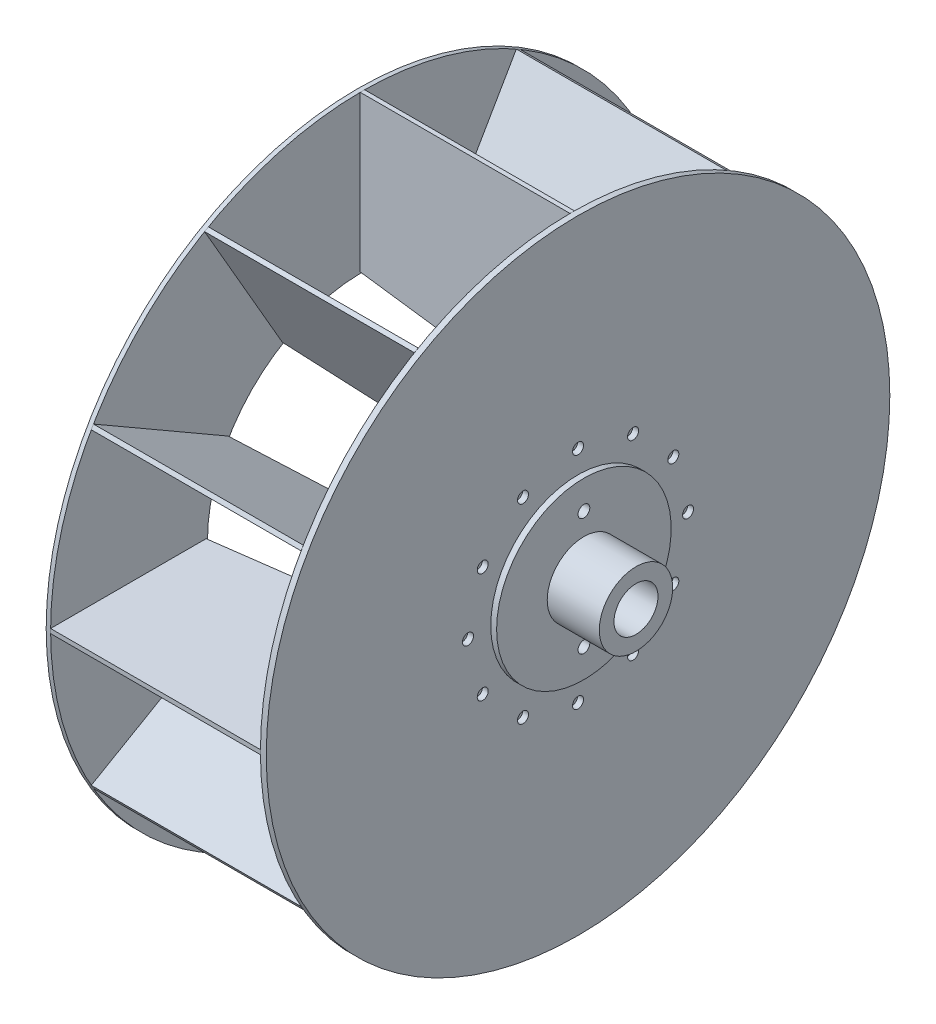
ISO-10303-21;
HEADER;
FILE_DESCRIPTION(('STEP AP214'),'2;1');
FILE_NAME('part.step','',(''),(''),'','','');
FILE_SCHEMA(('AUTOMOTIVE_DESIGN { 1 0 10303 214 1 1 1 1 }'));
ENDSEC;
DATA;
#1=APPLICATION_CONTEXT('core data for automotive mechanical design processes');
#2=APPLICATION_PROTOCOL_DEFINITION('international standard','automotive_design',2000,#1);
#3=PRODUCT_CONTEXT('',#1,'mechanical');
#4=PRODUCT('Part','Part','',(#3));
#5=PRODUCT_RELATED_PRODUCT_CATEGORY('part','',(#4));
#6=PRODUCT_DEFINITION_FORMATION('','',#4);
#7=PRODUCT_DEFINITION_CONTEXT('part definition',#1,'design');
#8=PRODUCT_DEFINITION('design','',#6,#7);
#9=PRODUCT_DEFINITION_SHAPE('','',#8);
#10=(LENGTH_UNIT() NAMED_UNIT(*) SI_UNIT(.MILLI.,.METRE.));
#11=(NAMED_UNIT(*) PLANE_ANGLE_UNIT() SI_UNIT($,.RADIAN.));
#12=(NAMED_UNIT(*) SI_UNIT($,.STERADIAN.) SOLID_ANGLE_UNIT());
#13=UNCERTAINTY_MEASURE_WITH_UNIT(LENGTH_MEASURE(1.E-05),#10,'distance_accuracy_value','');
#14=(GEOMETRIC_REPRESENTATION_CONTEXT(3) GLOBAL_UNCERTAINTY_ASSIGNED_CONTEXT((#13)) GLOBAL_UNIT_ASSIGNED_CONTEXT((#10,
#11,#12)) REPRESENTATION_CONTEXT('',''));
#15=CARTESIAN_POINT('',(0.,0.,0.));
#16=DIRECTION('',(0.,0.,1.));
#17=DIRECTION('',(1.,0.,0.));
#18=AXIS2_PLACEMENT_3D('',#15,#16,#17);
#19=CARTESIAN_POINT('',(0.,0.,0.));
#20=DIRECTION('',(-1.,0.,0.));
#21=DIRECTION('',(0.,0.,1.));
#22=AXIS2_PLACEMENT_3D('',#19,#20,#21);
#23=CYLINDRICAL_SURFACE('',#22,175.);
#24=CARTESIAN_POINT('',(97.,0.,0.));
#25=DIRECTION('',(-1.,0.,0.));
#26=DIRECTION('',(0.,0.,1.));
#27=AXIS2_PLACEMENT_3D('',#24,#25,#26);
#28=CIRCLE('',#27,175.);
#29=CARTESIAN_POINT('',(97.,0.,175.));
#30=VERTEX_POINT('',#29);
#31=EDGE_CURVE('E76',#30,#30,#28,.T.);
#32=ORIENTED_EDGE('',*,*,#31,.F.);
#33=EDGE_LOOP('',(#32));
#34=FACE_BOUND('',#33,.T.);
#35=CARTESIAN_POINT('',(117.,0.,0.));
#36=DIRECTION('',(-1.,0.,0.));
#37=DIRECTION('',(0.,0.,1.));
#38=AXIS2_PLACEMENT_3D('',#35,#36,#37);
#39=CIRCLE('',#38,175.);
#40=CARTESIAN_POINT('',(117.,0.,175.));
#41=VERTEX_POINT('',#40);
#42=EDGE_CURVE('E11',#41,#41,#39,.T.);
#43=ORIENTED_EDGE('',*,*,#42,.T.);
#44=EDGE_LOOP('',(#43));
#45=FACE_BOUND('',#44,.T.);
#46=ADVANCED_FACE('F42',(#34,#45),#23,.T.);
#47=CARTESIAN_POINT('',(117.,0.,-175.));
#48=DIRECTION('',(-1.,0.,0.));
#49=DIRECTION('',(0.,0.,1.));
#50=AXIS2_PLACEMENT_3D('',#47,#48,#49);
#51=PLANE('',#50);
#52=ORIENTED_EDGE('',*,*,#42,.F.);
#53=EDGE_LOOP('',(#52));
#54=FACE_BOUND('',#53,.T.);
#55=CARTESIAN_POINT('',(117.,0.,0.));
#56=DIRECTION('',(-1.,0.,0.));
#57=DIRECTION('',(0.,0.,1.));
#58=AXIS2_PLACEMENT_3D('',#55,#56,#57);
#59=CIRCLE('',#58,119.);
#60=CARTESIAN_POINT('',(117.,0.,119.));
#61=VERTEX_POINT('',#60);
#62=EDGE_CURVE('E49',#61,#61,#59,.T.);
#63=ORIENTED_EDGE('',*,*,#62,.T.);
#64=EDGE_LOOP('',(#63));
#65=FACE_BOUND('',#64,.T.);
#66=ADVANCED_FACE('F201',(#54,#65),#51,.F.);
#67=CARTESIAN_POINT('',(0.,0.,0.));
#68=DIRECTION('',(-1.,0.,0.));
#69=DIRECTION('',(0.,0.,1.));
#70=AXIS2_PLACEMENT_3D('',#67,#68,#69);
#71=CYLINDRICAL_SURFACE('',#70,119.);
#72=ORIENTED_EDGE('',*,*,#62,.F.);
#73=EDGE_LOOP('',(#72));
#74=FACE_BOUND('',#73,.T.);
#75=CARTESIAN_POINT('',(133.,0.,0.));
#76=DIRECTION('',(-1.,0.,0.));
#77=DIRECTION('',(0.,0.,1.));
#78=AXIS2_PLACEMENT_3D('',#75,#76,#77);
#79=CIRCLE('',#78,119.);
#80=CARTESIAN_POINT('',(133.,0.,119.));
#81=VERTEX_POINT('',#80);
#82=EDGE_CURVE('E53',#81,#81,#79,.T.);
#83=ORIENTED_EDGE('',*,*,#82,.T.);
#84=EDGE_LOOP('',(#83));
#85=FACE_BOUND('',#84,.T.);
#86=ADVANCED_FACE('F205',(#74,#85),#71,.T.);
#87=CARTESIAN_POINT('',(133.,0.,-119.));
#88=DIRECTION('',(-1.,0.,0.));
#89=DIRECTION('',(0.,0.,1.));
#90=AXIS2_PLACEMENT_3D('',#87,#88,#89);
#91=PLANE('',#90);
#92=CARTESIAN_POINT('',(133.,-80.,0.));
#93=DIRECTION('',(-1.,0.,0.));
#94=DIRECTION('',(0.,0.,1.));
#95=AXIS2_PLACEMENT_3D('',#92,#93,#94);
#96=CIRCLE('',#95,8.);
#97=CARTESIAN_POINT('',(133.,-80.,8.));
#98=VERTEX_POINT('',#97);
#99=EDGE_CURVE('E88',#98,#98,#96,.F.);
#100=ORIENTED_EDGE('',*,*,#99,.F.);
#101=EDGE_LOOP('',(#100));
#102=FACE_BOUND('',#101,.T.);
#103=CARTESIAN_POINT('',(133.,80.,0.));
#104=DIRECTION('',(-1.,0.,0.));
#105=DIRECTION('',(0.,0.,1.));
#106=AXIS2_PLACEMENT_3D('',#103,#104,#105);
#107=CIRCLE('',#106,8.);
#108=CARTESIAN_POINT('',(133.,80.,8.));
#109=VERTEX_POINT('',#108);
#110=EDGE_CURVE('E82',#109,#109,#107,.T.);
#111=ORIENTED_EDGE('',*,*,#110,.T.);
#112=EDGE_LOOP('',(#111));
#113=FACE_BOUND('',#112,.T.);
#114=ORIENTED_EDGE('',*,*,#82,.F.);
#115=EDGE_LOOP('',(#114));
#116=FACE_BOUND('',#115,.T.);
#117=CARTESIAN_POINT('',(133.,0.,0.));
#118=DIRECTION('',(-1.,0.,0.));
#119=DIRECTION('',(0.,0.,1.));
#120=AXIS2_PLACEMENT_3D('',#117,#118,#119);
#121=CIRCLE('',#120,50.);
#122=CARTESIAN_POINT('',(133.,0.,50.));
#123=VERTEX_POINT('',#122);
#124=EDGE_CURVE('E58',#123,#123,#121,.T.);
#125=ORIENTED_EDGE('',*,*,#124,.T.);
#126=EDGE_LOOP('',(#125));
#127=FACE_BOUND('',#126,.T.);
#128=ADVANCED_FACE('F210',(#102,#113,#116,#127),#91,.F.);
#129=CARTESIAN_POINT('',(0.,0.,0.));
#130=DIRECTION('',(-1.,0.,0.));
#131=DIRECTION('',(0.,0.,1.));
#132=AXIS2_PLACEMENT_3D('',#129,#130,#131);
#133=CYLINDRICAL_SURFACE('',#132,50.);
#134=ORIENTED_EDGE('',*,*,#124,.F.);
#135=EDGE_LOOP('',(#134));
#136=FACE_BOUND('',#135,.T.);
#137=CARTESIAN_POINT('',(204.,0.,0.));
#138=DIRECTION('',(-1.,0.,0.));
#139=DIRECTION('',(0.,0.,1.));
#140=AXIS2_PLACEMENT_3D('',#137,#138,#139);
#141=CIRCLE('',#140,50.);
#142=CARTESIAN_POINT('',(204.,0.,50.));
#143=VERTEX_POINT('',#142);
#144=EDGE_CURVE('E61',#143,#143,#141,.T.);
#145=ORIENTED_EDGE('',*,*,#144,.T.);
#146=EDGE_LOOP('',(#145));
#147=FACE_BOUND('',#146,.T.);
#148=ADVANCED_FACE('F217',(#136,#147),#133,.T.);
#149=CARTESIAN_POINT('',(204.,0.,-30.));
#150=DIRECTION('',(-1.,0.,0.));
#151=DIRECTION('',(0.,0.,1.));
#152=AXIS2_PLACEMENT_3D('',#149,#150,#151);
#153=PLANE('',#152);
#154=ORIENTED_EDGE('',*,*,#144,.F.);
#155=EDGE_LOOP('',(#154));
#156=FACE_BOUND('',#155,.T.);
#157=CARTESIAN_POINT('',(204.,0.,0.));
#158=DIRECTION('',(-1.,0.,0.));
#159=DIRECTION('',(0.,0.,1.));
#160=AXIS2_PLACEMENT_3D('',#157,#158,#159);
#161=CIRCLE('',#160,30.);
#162=CARTESIAN_POINT('',(204.,0.,30.));
#163=VERTEX_POINT('',#162);
#164=EDGE_CURVE('E64',#163,#163,#161,.T.);
#165=ORIENTED_EDGE('',*,*,#164,.T.);
#166=EDGE_LOOP('',(#165));
#167=FACE_BOUND('',#166,.T.);
#168=ADVANCED_FACE('F221',(#156,#167),#153,.F.);
#169=CARTESIAN_POINT('',(0.,0.,0.));
#170=DIRECTION('',(-1.,0.,0.));
#171=DIRECTION('',(0.,0.,1.));
#172=AXIS2_PLACEMENT_3D('',#169,#170,#171);
#173=CYLINDRICAL_SURFACE('',#172,30.);
#174=ORIENTED_EDGE('',*,*,#164,.F.);
#175=EDGE_LOOP('',(#174));
#176=FACE_BOUND('',#175,.T.);
#177=CARTESIAN_POINT('',(84.,0.,0.));
#178=DIRECTION('',(-1.,0.,0.));
#179=DIRECTION('',(0.,0.,1.));
#180=AXIS2_PLACEMENT_3D('',#177,#178,#179);
#181=CIRCLE('',#180,30.);
#182=CARTESIAN_POINT('',(84.,0.,30.));
#183=VERTEX_POINT('',#182);
#184=EDGE_CURVE('E67',#183,#183,#181,.T.);
#185=ORIENTED_EDGE('',*,*,#184,.T.);
#186=EDGE_LOOP('',(#185));
#187=FACE_BOUND('',#186,.T.);
#188=ADVANCED_FACE('F225',(#176,#187),#173,.F.);
#189=CARTESIAN_POINT('',(84.,0.,-50.));
#190=DIRECTION('',(1.,0.,0.));
#191=DIRECTION('',(0.,0.,-1.));
#192=AXIS2_PLACEMENT_3D('',#189,#190,#191);
#193=PLANE('',#192);
#194=ORIENTED_EDGE('',*,*,#184,.F.);
#195=EDGE_LOOP('',(#194));
#196=FACE_BOUND('',#195,.T.);
#197=CARTESIAN_POINT('',(84.,0.,0.));
#198=DIRECTION('',(-1.,0.,0.));
#199=DIRECTION('',(0.,0.,1.));
#200=AXIS2_PLACEMENT_3D('',#197,#198,#199);
#201=CIRCLE('',#200,50.);
#202=CARTESIAN_POINT('',(84.,0.,50.));
#203=VERTEX_POINT('',#202);
#204=EDGE_CURVE('E70',#203,#203,#201,.T.);
#205=ORIENTED_EDGE('',*,*,#204,.T.);
#206=EDGE_LOOP('',(#205));
#207=FACE_BOUND('',#206,.T.);
#208=ADVANCED_FACE('F229',(#196,#207),#193,.F.);
#209=CARTESIAN_POINT('',(0.,0.,0.));
#210=DIRECTION('',(-1.,0.,0.));
#211=DIRECTION('',(0.,0.,1.));
#212=AXIS2_PLACEMENT_3D('',#209,#210,#211);
#213=CYLINDRICAL_SURFACE('',#212,50.);
#214=ORIENTED_EDGE('',*,*,#204,.F.);
#215=EDGE_LOOP('',(#214));
#216=FACE_BOUND('',#215,.T.);
#217=CARTESIAN_POINT('',(97.,0.,0.));
#218=DIRECTION('',(-1.,0.,0.));
#219=DIRECTION('',(0.,0.,1.));
#220=AXIS2_PLACEMENT_3D('',#217,#218,#219);
#221=CIRCLE('',#220,50.);
#222=CARTESIAN_POINT('',(97.,0.,50.));
#223=VERTEX_POINT('',#222);
#224=EDGE_CURVE('E73',#223,#223,#221,.T.);
#225=ORIENTED_EDGE('',*,*,#224,.T.);
#226=EDGE_LOOP('',(#225));
#227=FACE_BOUND('',#226,.T.);
#228=ADVANCED_FACE('F167',(#216,#227),#213,.T.);
#229=CARTESIAN_POINT('',(97.,0.,-50.));
#230=DIRECTION('',(1.,0.,0.));
#231=DIRECTION('',(0.,0.,-1.));
#232=AXIS2_PLACEMENT_3D('',#229,#230,#231);
#233=PLANE('',#232);
#234=CARTESIAN_POINT('',(97.,74.9999999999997,-129.903810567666));
#235=DIRECTION('',(1.,0.,0.));
#236=DIRECTION('',(0.,-0.86602540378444,-0.499999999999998));
#237=AXIS2_PLACEMENT_3D('',#234,#235,#236);
#238=CIRCLE('',#237,7.5);
#239=CARTESIAN_POINT('',(97.,68.5048094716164,-133.653810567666));
#240=VERTEX_POINT('',#239);
#241=EDGE_CURVE('E153',#240,#240,#238,.F.);
#242=ORIENTED_EDGE('',*,*,#241,.F.);
#243=EDGE_LOOP('',(#242));
#244=FACE_BOUND('',#243,.T.);
#245=CARTESIAN_POINT('',(97.,-5.16717292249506E-13,-150.));
#246=DIRECTION('',(1.,0.,0.));
#247=DIRECTION('',(0.,-1.,0.));
#248=AXIS2_PLACEMENT_3D('',#245,#246,#247);
#249=CIRCLE('',#248,7.5);
#250=CARTESIAN_POINT('',(97.,-7.50000000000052,-150.));
#251=VERTEX_POINT('',#250);
#252=EDGE_CURVE('E147',#251,#251,#249,.F.);
#253=ORIENTED_EDGE('',*,*,#252,.F.);
#254=EDGE_LOOP('',(#253));
#255=FACE_BOUND('',#254,.T.);
#256=CARTESIAN_POINT('',(97.,-75.0000000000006,-129.903810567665));
#257=DIRECTION('',(1.,0.,0.));
#258=DIRECTION('',(0.,-0.866025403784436,0.500000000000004));
#259=AXIS2_PLACEMENT_3D('',#256,#257,#258);
#260=CIRCLE('',#259,7.5);
#261=CARTESIAN_POINT('',(97.,-81.4951905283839,-126.153810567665));
#262=VERTEX_POINT('',#261);
#263=EDGE_CURVE('E141',#262,#262,#260,.F.);
#264=ORIENTED_EDGE('',*,*,#263,.F.);
#265=EDGE_LOOP('',(#264));
#266=FACE_BOUND('',#265,.T.);
#267=CARTESIAN_POINT('',(97.,-129.903810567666,-74.9999999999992));
#268=DIRECTION('',(1.,0.,0.));
#269=DIRECTION('',(0.,-0.499999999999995,0.866025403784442));
#270=AXIS2_PLACEMENT_3D('',#267,#268,#269);
#271=CIRCLE('',#270,7.5);
#272=CARTESIAN_POINT('',(97.,-133.653810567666,-68.5048094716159));
#273=VERTEX_POINT('',#272);
#274=EDGE_CURVE('E135',#273,#273,#271,.F.);
#275=ORIENTED_EDGE('',*,*,#274,.F.);
#276=EDGE_LOOP('',(#275));
#277=FACE_BOUND('',#276,.T.);
#278=CARTESIAN_POINT('',(97.,-150.,0.));
#279=DIRECTION('',(1.,0.,0.));
#280=DIRECTION('',(0.,0.,1.));
#281=AXIS2_PLACEMENT_3D('',#278,#279,#280);
#282=CIRCLE('',#281,7.5);
#283=CARTESIAN_POINT('',(97.,-150.,7.49999999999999));
#284=VERTEX_POINT('',#283);
#285=EDGE_CURVE('E129',#284,#284,#282,.F.);
#286=ORIENTED_EDGE('',*,*,#285,.F.);
#287=EDGE_LOOP('',(#286));
#288=FACE_BOUND('',#287,.T.);
#289=CARTESIAN_POINT('',(97.,-129.903810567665,75.0000000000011));
#290=DIRECTION('',(1.,0.,0.));
#291=DIRECTION('',(0.,0.500000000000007,0.866025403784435));
#292=AXIS2_PLACEMENT_3D('',#289,#290,#291);
#293=CIRCLE('',#292,7.5);
#294=CARTESIAN_POINT('',(97.,-126.153810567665,81.4951905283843));
#295=VERTEX_POINT('',#294);
#296=EDGE_CURVE('E123',#295,#295,#293,.F.);
#297=ORIENTED_EDGE('',*,*,#296,.F.);
#298=EDGE_LOOP('',(#297));
#299=FACE_BOUND('',#298,.T.);
#300=CARTESIAN_POINT('',(97.,-74.9999999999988,129.903810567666));
#301=DIRECTION('',(1.,0.,0.));
#302=DIRECTION('',(0.,0.866025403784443,0.499999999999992));
#303=AXIS2_PLACEMENT_3D('',#300,#301,#302);
#304=CIRCLE('',#303,7.5);
#305=CARTESIAN_POINT('',(97.,-68.5048094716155,133.653810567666));
#306=VERTEX_POINT('',#305);
#307=EDGE_CURVE('E117',#306,#306,#304,.F.);
#308=ORIENTED_EDGE('',*,*,#307,.F.);
#309=EDGE_LOOP('',(#308));
#310=FACE_BOUND('',#309,.T.);
#311=CARTESIAN_POINT('',(97.,1.56416169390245E-12,150.));
#312=DIRECTION('',(1.,0.,0.));
#313=DIRECTION('',(0.,1.,0.));
#314=AXIS2_PLACEMENT_3D('',#311,#312,#313);
#315=CIRCLE('',#314,7.5);
#316=CARTESIAN_POINT('',(97.,7.50000000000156,150.));
#317=VERTEX_POINT('',#316);
#318=EDGE_CURVE('E111',#317,#317,#315,.F.);
#319=ORIENTED_EDGE('',*,*,#318,.F.);
#320=EDGE_LOOP('',(#319));
#321=FACE_BOUND('',#320,.T.);
#322=CARTESIAN_POINT('',(97.,75.0000000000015,129.903810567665));
#323=DIRECTION('',(1.,0.,0.));
#324=DIRECTION('',(0.,0.866025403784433,-0.50000000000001));
#325=AXIS2_PLACEMENT_3D('',#322,#323,#324);
#326=CIRCLE('',#325,7.5);
#327=CARTESIAN_POINT('',(97.,81.4951905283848,126.153810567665));
#328=VERTEX_POINT('',#327);
#329=EDGE_CURVE('E104',#328,#328,#326,.F.);
#330=ORIENTED_EDGE('',*,*,#329,.F.);
#331=EDGE_LOOP('',(#330));
#332=FACE_BOUND('',#331,.T.);
#333=CARTESIAN_POINT('',(97.,129.903810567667,74.9999999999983));
#334=DIRECTION('',(1.,0.,0.));
#335=DIRECTION('',(0.,0.499999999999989,-0.866025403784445));
#336=AXIS2_PLACEMENT_3D('',#333,#334,#335);
#337=CIRCLE('',#336,7.5);
#338=CARTESIAN_POINT('',(97.,133.653810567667,68.504809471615));
#339=VERTEX_POINT('',#338);
#340=EDGE_CURVE('E105',#339,#339,#337,.F.);
#341=ORIENTED_EDGE('',*,*,#340,.F.);
#342=EDGE_LOOP('',(#341));
#343=FACE_BOUND('',#342,.T.);
#344=CARTESIAN_POINT('',(97.,129.903810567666,-75.0000000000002));
#345=DIRECTION('',(1.,0.,0.));
#346=DIRECTION('',(0.,-0.500000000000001,-0.866025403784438));
#347=AXIS2_PLACEMENT_3D('',#344,#345,#346);
#348=CIRCLE('',#347,7.5);
#349=CARTESIAN_POINT('',(97.,126.153810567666,-81.4951905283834));
#350=VERTEX_POINT('',#349);
#351=EDGE_CURVE('E97',#350,#350,#348,.F.);
#352=ORIENTED_EDGE('',*,*,#351,.F.);
#353=EDGE_LOOP('',(#352));
#354=FACE_BOUND('',#353,.T.);
#355=CARTESIAN_POINT('',(97.,-80.,0.));
#356=DIRECTION('',(1.,0.,0.));
#357=DIRECTION('',(0.,0.,1.));
#358=AXIS2_PLACEMENT_3D('',#355,#356,#357);
#359=CIRCLE('',#358,8.);
#360=CARTESIAN_POINT('',(97.,-80.,8.));
#361=VERTEX_POINT('',#360);
#362=EDGE_CURVE('E91',#361,#361,#359,.T.);
#363=ORIENTED_EDGE('',*,*,#362,.T.);
#364=EDGE_LOOP('',(#363));
#365=FACE_BOUND('',#364,.T.);
#366=CARTESIAN_POINT('',(97.,80.,0.));
#367=DIRECTION('',(-1.,0.,0.));
#368=DIRECTION('',(0.,0.,1.));
#369=AXIS2_PLACEMENT_3D('',#366,#367,#368);
#370=CIRCLE('',#369,8.);
#371=CARTESIAN_POINT('',(97.,80.,8.));
#372=VERTEX_POINT('',#371);
#373=EDGE_CURVE('E85',#372,#372,#370,.T.);
#374=ORIENTED_EDGE('',*,*,#373,.F.);
#375=EDGE_LOOP('',(#374));
#376=FACE_BOUND('',#375,.T.);
#377=CARTESIAN_POINT('',(97.,150.,0.));
#378=DIRECTION('',(1.,0.,0.));
#379=DIRECTION('',(0.,0.,-1.));
#380=AXIS2_PLACEMENT_3D('',#377,#378,#379);
#381=CIRCLE('',#380,7.5);
#382=CARTESIAN_POINT('',(97.,150.,-7.49999999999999));
#383=VERTEX_POINT('',#382);
#384=EDGE_CURVE('E45',#383,#383,#381,.F.);
#385=ORIENTED_EDGE('',*,*,#384,.F.);
#386=EDGE_LOOP('',(#385));
#387=FACE_BOUND('',#386,.T.);
#388=ORIENTED_EDGE('',*,*,#224,.F.);
#389=EDGE_LOOP('',(#388));
#390=FACE_BOUND('',#389,.T.);
#391=ORIENTED_EDGE('',*,*,#31,.T.);
#392=EDGE_LOOP('',(#391));
#393=FACE_BOUND('',#392,.T.);
#394=ADVANCED_FACE('F163',(#244,#255,#266,#277,#288,#299,#310,#321,#332,#343,#354,#365,#376,
#387,#390,#393),#233,.F.);
#395=CARTESIAN_POINT('',(112.,150.,0.));
#396=DIRECTION('',(-1.,0.,0.));
#397=DIRECTION('',(0.,0.,1.));
#398=AXIS2_PLACEMENT_3D('',#395,#396,#397);
#399=CYLINDRICAL_SURFACE('',#398,7.5);
#400=CARTESIAN_POINT('',(112.,150.,0.));
#401=DIRECTION('',(1.,0.,0.));
#402=DIRECTION('',(0.,0.,-1.));
#403=AXIS2_PLACEMENT_3D('',#400,#401,#402);
#404=CIRCLE('',#403,7.5);
#405=CARTESIAN_POINT('',(112.,150.,-7.49999999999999));
#406=VERTEX_POINT('',#405);
#407=EDGE_CURVE('E79',#406,#406,#404,.T.);
#408=ORIENTED_EDGE('',*,*,#407,.T.);
#409=EDGE_LOOP('',(#408));
#410=FACE_BOUND('',#409,.T.);
#411=ORIENTED_EDGE('',*,*,#384,.T.);
#412=EDGE_LOOP('',(#411));
#413=FACE_BOUND('',#412,.T.);
#414=ADVANCED_FACE('F166',(#410,#413),#399,.F.);
#415=CARTESIAN_POINT('',(112.,150.,0.));
#416=DIRECTION('',(1.,0.,0.));
#417=DIRECTION('',(0.,0.,-1.));
#418=AXIS2_PLACEMENT_3D('',#415,#416,#417);
#419=PLANE('',#418);
#420=ORIENTED_EDGE('',*,*,#407,.F.);
#421=EDGE_LOOP('',(#420));
#422=FACE_BOUND('',#421,.T.);
#423=ADVANCED_FACE('F239',(#422),#419,.F.);
#424=CARTESIAN_POINT('',(204.,80.,0.));
#425=DIRECTION('',(-1.,0.,0.));
#426=DIRECTION('',(0.,0.,1.));
#427=AXIS2_PLACEMENT_3D('',#424,#425,#426);
#428=CYLINDRICAL_SURFACE('',#427,8.);
#429=ORIENTED_EDGE('',*,*,#373,.T.);
#430=EDGE_LOOP('',(#429));
#431=FACE_BOUND('',#430,.T.);
#432=ORIENTED_EDGE('',*,*,#110,.F.);
#433=EDGE_LOOP('',(#432));
#434=FACE_BOUND('',#433,.T.);
#435=ADVANCED_FACE('F243',(#431,#434),#428,.F.);
#436=CARTESIAN_POINT('',(204.,-80.,0.));
#437=DIRECTION('',(-1.,0.,0.));
#438=DIRECTION('',(0.,0.,1.));
#439=AXIS2_PLACEMENT_3D('',#436,#437,#438);
#440=CYLINDRICAL_SURFACE('',#439,8.);
#441=ORIENTED_EDGE('',*,*,#362,.F.);
#442=EDGE_LOOP('',(#441));
#443=FACE_BOUND('',#442,.T.);
#444=ORIENTED_EDGE('',*,*,#99,.T.);
#445=EDGE_LOOP('',(#444));
#446=FACE_BOUND('',#445,.T.);
#447=ADVANCED_FACE('F247',(#443,#446),#440,.F.);
#448=CARTESIAN_POINT('',(112.,129.903810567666,-75.0000000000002));
#449=DIRECTION('',(-1.,0.,0.));
#450=DIRECTION('',(0.,0.500000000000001,0.866025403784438));
#451=AXIS2_PLACEMENT_3D('',#448,#449,#450);
#452=CYLINDRICAL_SURFACE('',#451,7.5);
#453=CARTESIAN_POINT('',(112.,129.903810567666,-75.0000000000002));
#454=DIRECTION('',(1.,0.,0.));
#455=DIRECTION('',(0.,-0.500000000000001,-0.866025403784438));
#456=AXIS2_PLACEMENT_3D('',#453,#454,#455);
#457=CIRCLE('',#456,7.5);
#458=CARTESIAN_POINT('',(112.,126.153810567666,-81.4951905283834));
#459=VERTEX_POINT('',#458);
#460=EDGE_CURVE('E94',#459,#459,#457,.T.);
#461=ORIENTED_EDGE('',*,*,#460,.T.);
#462=EDGE_LOOP('',(#461));
#463=FACE_BOUND('',#462,.T.);
#464=ORIENTED_EDGE('',*,*,#351,.T.);
#465=EDGE_LOOP('',(#464));
#466=FACE_BOUND('',#465,.T.);
#467=ADVANCED_FACE('F251',(#463,#466),#452,.F.);
#468=CARTESIAN_POINT('',(112.,129.903810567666,-75.0000000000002));
#469=DIRECTION('',(1.,0.,0.));
#470=DIRECTION('',(0.,-0.500000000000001,-0.866025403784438));
#471=AXIS2_PLACEMENT_3D('',#468,#469,#470);
#472=PLANE('',#471);
#473=ORIENTED_EDGE('',*,*,#460,.F.);
#474=EDGE_LOOP('',(#473));
#475=FACE_BOUND('',#474,.T.);
#476=ADVANCED_FACE('F255',(#475),#472,.F.);
#477=CARTESIAN_POINT('',(112.,129.903810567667,74.9999999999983));
#478=DIRECTION('',(-1.,0.,0.));
#479=DIRECTION('',(0.,-0.499999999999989,0.866025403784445));
#480=AXIS2_PLACEMENT_3D('',#477,#478,#479);
#481=CYLINDRICAL_SURFACE('',#480,7.5);
#482=CARTESIAN_POINT('',(112.,129.903810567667,74.9999999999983));
#483=DIRECTION('',(1.,0.,0.));
#484=DIRECTION('',(0.,0.499999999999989,-0.866025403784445));
#485=AXIS2_PLACEMENT_3D('',#482,#483,#484);
#486=CIRCLE('',#485,7.5);
#487=CARTESIAN_POINT('',(112.,133.653810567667,68.504809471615));
#488=VERTEX_POINT('',#487);
#489=EDGE_CURVE('E101',#488,#488,#486,.T.);
#490=ORIENTED_EDGE('',*,*,#489,.T.);
#491=EDGE_LOOP('',(#490));
#492=FACE_BOUND('',#491,.T.);
#493=ORIENTED_EDGE('',*,*,#340,.T.);
#494=EDGE_LOOP('',(#493));
#495=FACE_BOUND('',#494,.T.);
#496=ADVANCED_FACE('F259',(#492,#495),#481,.F.);
#497=CARTESIAN_POINT('',(112.,129.903810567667,74.9999999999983));
#498=DIRECTION('',(1.,0.,0.));
#499=DIRECTION('',(0.,0.499999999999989,-0.866025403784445));
#500=AXIS2_PLACEMENT_3D('',#497,#498,#499);
#501=PLANE('',#500);
#502=ORIENTED_EDGE('',*,*,#489,.F.);
#503=EDGE_LOOP('',(#502));
#504=FACE_BOUND('',#503,.T.);
#505=ADVANCED_FACE('F263',(#504),#501,.F.);
#506=CARTESIAN_POINT('',(112.,75.0000000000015,129.903810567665));
#507=DIRECTION('',(-1.,0.,0.));
#508=DIRECTION('',(0.,-0.866025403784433,0.50000000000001));
#509=AXIS2_PLACEMENT_3D('',#506,#507,#508);
#510=CYLINDRICAL_SURFACE('',#509,7.5);
#511=CARTESIAN_POINT('',(112.,75.0000000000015,129.903810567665));
#512=DIRECTION('',(1.,0.,0.));
#513=DIRECTION('',(0.,0.866025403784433,-0.50000000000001));
#514=AXIS2_PLACEMENT_3D('',#511,#512,#513);
#515=CIRCLE('',#514,7.5);
#516=CARTESIAN_POINT('',(112.,81.4951905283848,126.153810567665));
#517=VERTEX_POINT('',#516);
#518=EDGE_CURVE('E108',#517,#517,#515,.T.);
#519=ORIENTED_EDGE('',*,*,#518,.T.);
#520=EDGE_LOOP('',(#519));
#521=FACE_BOUND('',#520,.T.);
#522=ORIENTED_EDGE('',*,*,#329,.T.);
#523=EDGE_LOOP('',(#522));
#524=FACE_BOUND('',#523,.T.);
#525=ADVANCED_FACE('F267',(#521,#524),#510,.F.);
#526=CARTESIAN_POINT('',(112.,75.0000000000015,129.903810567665));
#527=DIRECTION('',(1.,0.,0.));
#528=DIRECTION('',(0.,0.866025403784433,-0.50000000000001));
#529=AXIS2_PLACEMENT_3D('',#526,#527,#528);
#530=PLANE('',#529);
#531=ORIENTED_EDGE('',*,*,#518,.F.);
#532=EDGE_LOOP('',(#531));
#533=FACE_BOUND('',#532,.T.);
#534=ADVANCED_FACE('F271',(#533),#530,.F.);
#535=CARTESIAN_POINT('',(112.,1.56416169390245E-12,150.));
#536=DIRECTION('',(-1.,0.,0.));
#537=DIRECTION('',(0.,-1.,0.));
#538=AXIS2_PLACEMENT_3D('',#535,#536,#537);
#539=CYLINDRICAL_SURFACE('',#538,7.5);
#540=CARTESIAN_POINT('',(112.,1.56416169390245E-12,150.));
#541=DIRECTION('',(1.,0.,0.));
#542=DIRECTION('',(0.,1.,0.));
#543=AXIS2_PLACEMENT_3D('',#540,#541,#542);
#544=CIRCLE('',#543,7.5);
#545=CARTESIAN_POINT('',(112.,7.50000000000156,150.));
#546=VERTEX_POINT('',#545);
#547=EDGE_CURVE('E114',#546,#546,#544,.T.);
#548=ORIENTED_EDGE('',*,*,#547,.T.);
#549=EDGE_LOOP('',(#548));
#550=FACE_BOUND('',#549,.T.);
#551=ORIENTED_EDGE('',*,*,#318,.T.);
#552=EDGE_LOOP('',(#551));
#553=FACE_BOUND('',#552,.T.);
#554=ADVANCED_FACE('F275',(#550,#553),#539,.F.);
#555=CARTESIAN_POINT('',(112.,1.56416169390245E-12,150.));
#556=DIRECTION('',(1.,0.,0.));
#557=DIRECTION('',(0.,1.,0.));
#558=AXIS2_PLACEMENT_3D('',#555,#556,#557);
#559=PLANE('',#558);
#560=ORIENTED_EDGE('',*,*,#547,.F.);
#561=EDGE_LOOP('',(#560));
#562=FACE_BOUND('',#561,.T.);
#563=ADVANCED_FACE('F279',(#562),#559,.F.);
#564=CARTESIAN_POINT('',(112.,-74.9999999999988,129.903810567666));
#565=DIRECTION('',(-1.,0.,0.));
#566=DIRECTION('',(0.,-0.866025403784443,-0.499999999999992));
#567=AXIS2_PLACEMENT_3D('',#564,#565,#566);
#568=CYLINDRICAL_SURFACE('',#567,7.5);
#569=CARTESIAN_POINT('',(112.,-74.9999999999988,129.903810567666));
#570=DIRECTION('',(1.,0.,0.));
#571=DIRECTION('',(0.,0.866025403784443,0.499999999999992));
#572=AXIS2_PLACEMENT_3D('',#569,#570,#571);
#573=CIRCLE('',#572,7.5);
#574=CARTESIAN_POINT('',(112.,-68.5048094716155,133.653810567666));
#575=VERTEX_POINT('',#574);
#576=EDGE_CURVE('E120',#575,#575,#573,.T.);
#577=ORIENTED_EDGE('',*,*,#576,.T.);
#578=EDGE_LOOP('',(#577));
#579=FACE_BOUND('',#578,.T.);
#580=ORIENTED_EDGE('',*,*,#307,.T.);
#581=EDGE_LOOP('',(#580));
#582=FACE_BOUND('',#581,.T.);
#583=ADVANCED_FACE('F283',(#579,#582),#568,.F.);
#584=CARTESIAN_POINT('',(112.,-74.9999999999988,129.903810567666));
#585=DIRECTION('',(1.,0.,0.));
#586=DIRECTION('',(0.,0.866025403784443,0.499999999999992));
#587=AXIS2_PLACEMENT_3D('',#584,#585,#586);
#588=PLANE('',#587);
#589=ORIENTED_EDGE('',*,*,#576,.F.);
#590=EDGE_LOOP('',(#589));
#591=FACE_BOUND('',#590,.T.);
#592=ADVANCED_FACE('F287',(#591),#588,.F.);
#593=CARTESIAN_POINT('',(112.,-129.903810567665,75.0000000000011));
#594=DIRECTION('',(-1.,0.,0.));
#595=DIRECTION('',(0.,-0.500000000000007,-0.866025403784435));
#596=AXIS2_PLACEMENT_3D('',#593,#594,#595);
#597=CYLINDRICAL_SURFACE('',#596,7.5);
#598=CARTESIAN_POINT('',(112.,-129.903810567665,75.0000000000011));
#599=DIRECTION('',(1.,0.,0.));
#600=DIRECTION('',(0.,0.500000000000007,0.866025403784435));
#601=AXIS2_PLACEMENT_3D('',#598,#599,#600);
#602=CIRCLE('',#601,7.5);
#603=CARTESIAN_POINT('',(112.,-126.153810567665,81.4951905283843));
#604=VERTEX_POINT('',#603);
#605=EDGE_CURVE('E126',#604,#604,#602,.T.);
#606=ORIENTED_EDGE('',*,*,#605,.T.);
#607=EDGE_LOOP('',(#606));
#608=FACE_BOUND('',#607,.T.);
#609=ORIENTED_EDGE('',*,*,#296,.T.);
#610=EDGE_LOOP('',(#609));
#611=FACE_BOUND('',#610,.T.);
#612=ADVANCED_FACE('F291',(#608,#611),#597,.F.);
#613=CARTESIAN_POINT('',(112.,-129.903810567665,75.0000000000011));
#614=DIRECTION('',(1.,0.,0.));
#615=DIRECTION('',(0.,0.500000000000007,0.866025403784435));
#616=AXIS2_PLACEMENT_3D('',#613,#614,#615);
#617=PLANE('',#616);
#618=ORIENTED_EDGE('',*,*,#605,.F.);
#619=EDGE_LOOP('',(#618));
#620=FACE_BOUND('',#619,.T.);
#621=ADVANCED_FACE('F295',(#620),#617,.F.);
#622=CARTESIAN_POINT('',(112.,-150.,0.));
#623=DIRECTION('',(-1.,0.,0.));
#624=DIRECTION('',(0.,0.,-1.));
#625=AXIS2_PLACEMENT_3D('',#622,#623,#624);
#626=CYLINDRICAL_SURFACE('',#625,7.5);
#627=CARTESIAN_POINT('',(112.,-150.,0.));
#628=DIRECTION('',(1.,0.,0.));
#629=DIRECTION('',(0.,0.,1.));
#630=AXIS2_PLACEMENT_3D('',#627,#628,#629);
#631=CIRCLE('',#630,7.5);
#632=CARTESIAN_POINT('',(112.,-150.,7.49999999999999));
#633=VERTEX_POINT('',#632);
#634=EDGE_CURVE('E132',#633,#633,#631,.T.);
#635=ORIENTED_EDGE('',*,*,#634,.T.);
#636=EDGE_LOOP('',(#635));
#637=FACE_BOUND('',#636,.T.);
#638=ORIENTED_EDGE('',*,*,#285,.T.);
#639=EDGE_LOOP('',(#638));
#640=FACE_BOUND('',#639,.T.);
#641=ADVANCED_FACE('F299',(#637,#640),#626,.F.);
#642=CARTESIAN_POINT('',(112.,-150.,0.));
#643=DIRECTION('',(1.,0.,0.));
#644=DIRECTION('',(0.,0.,1.));
#645=AXIS2_PLACEMENT_3D('',#642,#643,#644);
#646=PLANE('',#645);
#647=ORIENTED_EDGE('',*,*,#634,.F.);
#648=EDGE_LOOP('',(#647));
#649=FACE_BOUND('',#648,.T.);
#650=ADVANCED_FACE('F303',(#649),#646,.F.);
#651=CARTESIAN_POINT('',(112.,-129.903810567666,-74.9999999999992));
#652=DIRECTION('',(-1.,0.,0.));
#653=DIRECTION('',(0.,0.499999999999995,-0.866025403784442));
#654=AXIS2_PLACEMENT_3D('',#651,#652,#653);
#655=CYLINDRICAL_SURFACE('',#654,7.5);
#656=CARTESIAN_POINT('',(112.,-129.903810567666,-74.9999999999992));
#657=DIRECTION('',(1.,0.,0.));
#658=DIRECTION('',(0.,-0.499999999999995,0.866025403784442));
#659=AXIS2_PLACEMENT_3D('',#656,#657,#658);
#660=CIRCLE('',#659,7.5);
#661=CARTESIAN_POINT('',(112.,-133.653810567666,-68.5048094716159));
#662=VERTEX_POINT('',#661);
#663=EDGE_CURVE('E138',#662,#662,#660,.T.);
#664=ORIENTED_EDGE('',*,*,#663,.T.);
#665=EDGE_LOOP('',(#664));
#666=FACE_BOUND('',#665,.T.);
#667=ORIENTED_EDGE('',*,*,#274,.T.);
#668=EDGE_LOOP('',(#667));
#669=FACE_BOUND('',#668,.T.);
#670=ADVANCED_FACE('F307',(#666,#669),#655,.F.);
#671=CARTESIAN_POINT('',(112.,-129.903810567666,-74.9999999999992));
#672=DIRECTION('',(1.,0.,0.));
#673=DIRECTION('',(0.,-0.499999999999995,0.866025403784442));
#674=AXIS2_PLACEMENT_3D('',#671,#672,#673);
#675=PLANE('',#674);
#676=ORIENTED_EDGE('',*,*,#663,.F.);
#677=EDGE_LOOP('',(#676));
#678=FACE_BOUND('',#677,.T.);
#679=ADVANCED_FACE('F311',(#678),#675,.F.);
#680=CARTESIAN_POINT('',(112.,-75.0000000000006,-129.903810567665));
#681=DIRECTION('',(-1.,0.,0.));
#682=DIRECTION('',(0.,0.866025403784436,-0.500000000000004));
#683=AXIS2_PLACEMENT_3D('',#680,#681,#682);
#684=CYLINDRICAL_SURFACE('',#683,7.5);
#685=CARTESIAN_POINT('',(112.,-75.0000000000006,-129.903810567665));
#686=DIRECTION('',(1.,0.,0.));
#687=DIRECTION('',(0.,-0.866025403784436,0.500000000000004));
#688=AXIS2_PLACEMENT_3D('',#685,#686,#687);
#689=CIRCLE('',#688,7.5);
#690=CARTESIAN_POINT('',(112.,-81.4951905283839,-126.153810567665));
#691=VERTEX_POINT('',#690);
#692=EDGE_CURVE('E144',#691,#691,#689,.T.);
#693=ORIENTED_EDGE('',*,*,#692,.T.);
#694=EDGE_LOOP('',(#693));
#695=FACE_BOUND('',#694,.T.);
#696=ORIENTED_EDGE('',*,*,#263,.T.);
#697=EDGE_LOOP('',(#696));
#698=FACE_BOUND('',#697,.T.);
#699=ADVANCED_FACE('F315',(#695,#698),#684,.F.);
#700=CARTESIAN_POINT('',(112.,-75.0000000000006,-129.903810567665));
#701=DIRECTION('',(1.,0.,0.));
#702=DIRECTION('',(0.,-0.866025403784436,0.500000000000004));
#703=AXIS2_PLACEMENT_3D('',#700,#701,#702);
#704=PLANE('',#703);
#705=ORIENTED_EDGE('',*,*,#692,.F.);
#706=EDGE_LOOP('',(#705));
#707=FACE_BOUND('',#706,.T.);
#708=ADVANCED_FACE('F319',(#707),#704,.F.);
#709=CARTESIAN_POINT('',(112.,-5.16717292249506E-13,-150.));
#710=DIRECTION('',(-1.,0.,0.));
#711=DIRECTION('',(0.,1.,0.));
#712=AXIS2_PLACEMENT_3D('',#709,#710,#711);
#713=CYLINDRICAL_SURFACE('',#712,7.5);
#714=CARTESIAN_POINT('',(112.,-5.16717292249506E-13,-150.));
#715=DIRECTION('',(1.,0.,0.));
#716=DIRECTION('',(0.,-1.,0.));
#717=AXIS2_PLACEMENT_3D('',#714,#715,#716);
#718=CIRCLE('',#717,7.5);
#719=CARTESIAN_POINT('',(112.,-7.50000000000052,-150.));
#720=VERTEX_POINT('',#719);
#721=EDGE_CURVE('E150',#720,#720,#718,.T.);
#722=ORIENTED_EDGE('',*,*,#721,.T.);
#723=EDGE_LOOP('',(#722));
#724=FACE_BOUND('',#723,.T.);
#725=ORIENTED_EDGE('',*,*,#252,.T.);
#726=EDGE_LOOP('',(#725));
#727=FACE_BOUND('',#726,.T.);
#728=ADVANCED_FACE('F323',(#724,#727),#713,.F.);
#729=CARTESIAN_POINT('',(112.,-5.16717292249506E-13,-150.));
#730=DIRECTION('',(1.,0.,0.));
#731=DIRECTION('',(0.,-1.,0.));
#732=AXIS2_PLACEMENT_3D('',#729,#730,#731);
#733=PLANE('',#732);
#734=ORIENTED_EDGE('',*,*,#721,.F.);
#735=EDGE_LOOP('',(#734));
#736=FACE_BOUND('',#735,.T.);
#737=ADVANCED_FACE('F327',(#736),#733,.F.);
#738=CARTESIAN_POINT('',(112.,74.9999999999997,-129.903810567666));
#739=DIRECTION('',(-1.,0.,0.));
#740=DIRECTION('',(0.,0.86602540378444,0.499999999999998));
#741=AXIS2_PLACEMENT_3D('',#738,#739,#740);
#742=CYLINDRICAL_SURFACE('',#741,7.5);
#743=CARTESIAN_POINT('',(112.,74.9999999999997,-129.903810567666));
#744=DIRECTION('',(1.,0.,0.));
#745=DIRECTION('',(0.,-0.86602540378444,-0.499999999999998));
#746=AXIS2_PLACEMENT_3D('',#743,#744,#745);
#747=CIRCLE('',#746,7.5);
#748=CARTESIAN_POINT('',(112.,68.5048094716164,-133.653810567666));
#749=VERTEX_POINT('',#748);
#750=EDGE_CURVE('E100',#749,#749,#747,.T.);
#751=ORIENTED_EDGE('',*,*,#750,.T.);
#752=EDGE_LOOP('',(#751));
#753=FACE_BOUND('',#752,.T.);
#754=ORIENTED_EDGE('',*,*,#241,.T.);
#755=EDGE_LOOP('',(#754));
#756=FACE_BOUND('',#755,.T.);
#757=ADVANCED_FACE('F161',(#753,#756),#742,.F.);
#758=CARTESIAN_POINT('',(112.,74.9999999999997,-129.903810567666));
#759=DIRECTION('',(1.,0.,0.));
#760=DIRECTION('',(0.,-0.86602540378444,-0.499999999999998));
#761=AXIS2_PLACEMENT_3D('',#758,#759,#760);
#762=PLANE('',#761);
#763=ORIENTED_EDGE('',*,*,#750,.F.);
#764=EDGE_LOOP('',(#763));
#765=FACE_BOUND('',#764,.T.);
#766=ADVANCED_FACE('F334',(#765),#762,.F.);
#767=CLOSED_SHELL('',(#46,#66,#86,#128,#148,#168,#188,#208,#228,#394,#414,#423,#435,#447,#467,
#476,#496,#505,#525,#534,#554,#563,#583,#592,#612,#621,#641,#650,#670,#679,#699,#708,#728,#737,
#757,#766));
#768=MANIFOLD_SOLID_BREP('B2',#767);
#769=CARTESIAN_POINT('',(-169.,369.560796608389,-209.901923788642));
#770=DIRECTION('',(1.,0.,0.));
#771=DIRECTION('',(0.,0.866025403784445,-0.499999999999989));
#772=AXIS2_PLACEMENT_3D('',#769,#770,#771);
#773=PLANE('',#772);
#774=DIRECTION('',(0.,-0.866025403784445,0.499999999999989));
#775=VECTOR('',#774,1.);
#776=CARTESIAN_POINT('',(-169.,366.560796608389,-215.098076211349));
#777=LINE('',#776,#775);
#778=CARTESIAN_POINT('',(-169.,366.560796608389,-215.098076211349));
#779=VERTEX_POINT('',#778);
#780=CARTESIAN_POINT('',(-169.,182.963411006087,-109.098076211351));
#781=VERTEX_POINT('',#780);
#782=EDGE_CURVE('E669',#779,#781,#777,.T.);
#783=ORIENTED_EDGE('',*,*,#782,.T.);
#784=DIRECTION('',(0.,-0.499999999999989,-0.866025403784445));
#785=VECTOR('',#784,1.);
#786=CARTESIAN_POINT('',(-169.,185.963411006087,-103.901923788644));
#787=LINE('',#786,#785);
#788=CARTESIAN_POINT('',(-169.,185.963411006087,-103.901923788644));
#789=VERTEX_POINT('',#788);
#790=EDGE_CURVE('E40',#789,#781,#787,.T.);
#791=ORIENTED_EDGE('',*,*,#790,.F.);
#792=DIRECTION('',(0.,-0.866025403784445,0.499999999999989));
#793=VECTOR('',#792,1.);
#794=CARTESIAN_POINT('',(-169.,369.560796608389,-209.901923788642));
#795=LINE('',#794,#793);
#796=CARTESIAN_POINT('',(-169.,369.560796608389,-209.901923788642));
#797=VERTEX_POINT('',#796);
#798=EDGE_CURVE('E657',#797,#789,#795,.T.);
#799=ORIENTED_EDGE('',*,*,#798,.F.);
#800=DIRECTION('',(0.,-0.499999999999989,-0.866025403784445));
#801=VECTOR('',#800,1.);
#802=CARTESIAN_POINT('',(-169.,369.560796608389,-209.901923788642));
#803=LINE('',#802,#801);
#804=EDGE_CURVE('E665',#797,#779,#803,.T.);
#805=ORIENTED_EDGE('',*,*,#804,.T.);
#806=EDGE_LOOP('',(#783,#791,#799,#805));
#807=FACE_BOUND('',#806,.T.);
#808=ADVANCED_FACE('F606',(#807),#773,.F.);
#809=CARTESIAN_POINT('',(-169.,185.963411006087,-103.901923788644));
#810=DIRECTION('',(0.135113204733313,0.858084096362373,-0.495415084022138));
#811=DIRECTION('',(-0.990830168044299,0.117011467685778,-0.0675566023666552));
#812=AXIS2_PLACEMENT_3D('',#809,#810,#811);
#813=PLANE('',#812);
#814=DIRECTION('',(0.990830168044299,-0.117011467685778,0.0675566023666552));
#815=VECTOR('',#814,1.);
#816=CARTESIAN_POINT('',(-169.,182.963411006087,-109.098076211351));
#817=LINE('',#816,#815);
#818=CARTESIAN_POINT('',(117.,149.188420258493,-89.5980762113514));
#819=VERTEX_POINT('',#818);
#820=EDGE_CURVE('E661',#781,#819,#817,.T.);
#821=ORIENTED_EDGE('',*,*,#820,.T.);
#822=DIRECTION('',(0.,-0.499999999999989,-0.866025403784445));
#823=VECTOR('',#822,1.);
#824=CARTESIAN_POINT('',(117.,152.188420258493,-84.4019237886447));
#825=LINE('',#824,#823);
#826=CARTESIAN_POINT('',(117.,152.188420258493,-84.4019237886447));
#827=VERTEX_POINT('',#826);
#828=EDGE_CURVE('E614',#827,#819,#825,.T.);
#829=ORIENTED_EDGE('',*,*,#828,.F.);
#830=DIRECTION('',(0.990830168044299,-0.117011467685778,0.0675566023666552));
#831=VECTOR('',#830,1.);
#832=CARTESIAN_POINT('',(-169.,185.963411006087,-103.901923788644));
#833=LINE('',#832,#831);
#834=EDGE_CURVE('E652',#789,#827,#833,.T.);
#835=ORIENTED_EDGE('',*,*,#834,.F.);
#836=ORIENTED_EDGE('',*,*,#790,.T.);
#837=EDGE_LOOP('',(#821,#829,#835,#836));
#838=FACE_BOUND('',#837,.T.);
#839=ADVANCED_FACE('F660',(#838),#813,.F.);
#840=CARTESIAN_POINT('',(117.,152.188420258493,-84.4019237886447));
#841=DIRECTION('',(-1.,0.,0.));
#842=DIRECTION('',(0.,-0.866025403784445,0.499999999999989));
#843=AXIS2_PLACEMENT_3D('',#840,#841,#842);
#844=PLANE('',#843);
#845=DIRECTION('',(0.,0.866025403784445,-0.499999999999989));
#846=VECTOR('',#845,1.);
#847=CARTESIAN_POINT('',(117.,149.188420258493,-89.5980762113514));
#848=LINE('',#847,#846);
#849=CARTESIAN_POINT('',(117.,366.560796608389,-215.098076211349));
#850=VERTEX_POINT('',#849);
#851=EDGE_CURVE('E639',#819,#850,#848,.T.);
#852=ORIENTED_EDGE('',*,*,#851,.T.);
#853=DIRECTION('',(0.,-0.499999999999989,-0.866025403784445));
#854=VECTOR('',#853,1.);
#855=CARTESIAN_POINT('',(117.,369.560796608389,-209.901923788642));
#856=LINE('',#855,#854);
#857=CARTESIAN_POINT('',(117.,369.560796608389,-209.901923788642));
#858=VERTEX_POINT('',#857);
#859=EDGE_CURVE('E662',#858,#850,#856,.T.);
#860=ORIENTED_EDGE('',*,*,#859,.F.);
#861=DIRECTION('',(0.,0.866025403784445,-0.499999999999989));
#862=VECTOR('',#861,1.);
#863=CARTESIAN_POINT('',(117.,152.188420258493,-84.4019237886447));
#864=LINE('',#863,#862);
#865=EDGE_CURVE('E655',#827,#858,#864,.T.);
#866=ORIENTED_EDGE('',*,*,#865,.F.);
#867=ORIENTED_EDGE('',*,*,#828,.T.);
#868=EDGE_LOOP('',(#852,#860,#866,#867));
#869=FACE_BOUND('',#868,.T.);
#870=ADVANCED_FACE('F663',(#869),#844,.F.);
#871=CARTESIAN_POINT('',(117.,369.560796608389,-209.901923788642));
#872=DIRECTION('',(0.,-0.866025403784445,0.499999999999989));
#873=DIRECTION('',(1.,0.,0.));
#874=AXIS2_PLACEMENT_3D('',#871,#872,#873);
#875=PLANE('',#874);
#876=DIRECTION('',(-1.,0.,0.));
#877=VECTOR('',#876,1.);
#878=CARTESIAN_POINT('',(117.,366.560796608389,-215.098076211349));
#879=LINE('',#878,#877);
#880=EDGE_CURVE('E645',#850,#779,#879,.T.);
#881=ORIENTED_EDGE('',*,*,#880,.T.);
#882=ORIENTED_EDGE('',*,*,#804,.F.);
#883=DIRECTION('',(-1.,0.,0.));
#884=VECTOR('',#883,1.);
#885=CARTESIAN_POINT('',(117.,369.560796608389,-209.901923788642));
#886=LINE('',#885,#884);
#887=EDGE_CURVE('E622',#858,#797,#886,.T.);
#888=ORIENTED_EDGE('',*,*,#887,.F.);
#889=ORIENTED_EDGE('',*,*,#859,.T.);
#890=EDGE_LOOP('',(#881,#882,#888,#889));
#891=FACE_BOUND('',#890,.T.);
#892=ADVANCED_FACE('F676',(#891),#875,.F.);
#893=CARTESIAN_POINT('',(0.,1.49999999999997,2.59807621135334));
#894=DIRECTION('',(0.,-0.499999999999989,-0.866025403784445));
#895=DIRECTION('',(-1.,0.,0.));
#896=AXIS2_PLACEMENT_3D('',#893,#894,#895);
#897=PLANE('',#896);
#898=ORIENTED_EDGE('',*,*,#798,.T.);
#899=ORIENTED_EDGE('',*,*,#834,.T.);
#900=ORIENTED_EDGE('',*,*,#865,.T.);
#901=ORIENTED_EDGE('',*,*,#887,.T.);
#902=EDGE_LOOP('',(#898,#899,#900,#901));
#903=FACE_BOUND('',#902,.T.);
#904=ADVANCED_FACE('F653',(#903),#897,.F.);
#905=CARTESIAN_POINT('',(0.,-1.49999999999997,-2.59807621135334));
#906=DIRECTION('',(0.,-0.499999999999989,-0.866025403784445));
#907=DIRECTION('',(-1.,0.,0.));
#908=AXIS2_PLACEMENT_3D('',#905,#906,#907);
#909=PLANE('',#908);
#910=ORIENTED_EDGE('',*,*,#782,.F.);
#911=ORIENTED_EDGE('',*,*,#880,.F.);
#912=ORIENTED_EDGE('',*,*,#851,.F.);
#913=ORIENTED_EDGE('',*,*,#820,.F.);
#914=EDGE_LOOP('',(#910,#911,#912,#913));
#915=FACE_BOUND('',#914,.T.);
#916=ADVANCED_FACE('F679',(#915),#909,.T.);
#917=CLOSED_SHELL('',(#808,#839,#870,#892,#904,#916));
#918=MANIFOLD_SOLID_BREP('B6',#917);
#919=CARTESIAN_POINT('',(-169.,215.098076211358,-366.560796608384));
#920=DIRECTION('',(1.,0.,0.));
#921=DIRECTION('',(0.,0.50000000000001,-0.866025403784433));
#922=AXIS2_PLACEMENT_3D('',#919,#920,#921);
#923=PLANE('',#922);
#924=DIRECTION('',(0.,-0.50000000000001,0.866025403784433));
#925=VECTOR('',#924,1.);
#926=CARTESIAN_POINT('',(-169.,209.901923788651,-369.560796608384));
#927=LINE('',#926,#925);
#928=CARTESIAN_POINT('',(-169.,209.901923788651,-369.560796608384));
#929=VERTEX_POINT('',#928);
#930=CARTESIAN_POINT('',(-169.,103.901923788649,-185.963411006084));
#931=VERTEX_POINT('',#930);
#932=EDGE_CURVE('E803',#929,#931,#927,.T.);
#933=ORIENTED_EDGE('',*,*,#932,.T.);
#934=DIRECTION('',(0.,-0.866025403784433,-0.50000000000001));
#935=VECTOR('',#934,1.);
#936=CARTESIAN_POINT('',(-169.,109.098076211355,-182.963411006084));
#937=LINE('',#936,#935);
#938=CARTESIAN_POINT('',(-169.,109.098076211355,-182.963411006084));
#939=VERTEX_POINT('',#938);
#940=EDGE_CURVE('E604',#939,#931,#937,.T.);
#941=ORIENTED_EDGE('',*,*,#940,.F.);
#942=DIRECTION('',(0.,-0.50000000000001,0.866025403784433));
#943=VECTOR('',#942,1.);
#944=CARTESIAN_POINT('',(-169.,215.098076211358,-366.560796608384));
#945=LINE('',#944,#943);
#946=CARTESIAN_POINT('',(-169.,215.098076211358,-366.560796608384));
#947=VERTEX_POINT('',#946);
#948=EDGE_CURVE('E791',#947,#939,#945,.T.);
#949=ORIENTED_EDGE('',*,*,#948,.F.);
#950=DIRECTION('',(0.,-0.866025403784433,-0.50000000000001));
#951=VECTOR('',#950,1.);
#952=CARTESIAN_POINT('',(-169.,215.098076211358,-366.560796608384));
#953=LINE('',#952,#951);
#954=EDGE_CURVE('E799',#947,#929,#953,.T.);
#955=ORIENTED_EDGE('',*,*,#954,.T.);
#956=EDGE_LOOP('',(#933,#941,#949,#955));
#957=FACE_BOUND('',#956,.T.);
#958=ADVANCED_FACE('F740',(#957),#923,.F.);
#959=CARTESIAN_POINT('',(-169.,109.098076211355,-182.963411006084));
#960=DIRECTION('',(0.135113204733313,0.495415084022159,-0.858084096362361));
#961=DIRECTION('',(-0.990830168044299,0.067556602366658,-0.117011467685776));
#962=AXIS2_PLACEMENT_3D('',#959,#960,#961);
#963=PLANE('',#962);
#964=DIRECTION('',(0.990830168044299,-0.067556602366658,0.117011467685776));
#965=VECTOR('',#964,1.);
#966=CARTESIAN_POINT('',(-169.,103.901923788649,-185.963411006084));
#967=LINE('',#966,#965);
#968=CARTESIAN_POINT('',(117.,84.4019237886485,-152.188420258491));
#969=VERTEX_POINT('',#968);
#970=EDGE_CURVE('E795',#931,#969,#967,.T.);
#971=ORIENTED_EDGE('',*,*,#970,.T.);
#972=DIRECTION('',(0.,-0.866025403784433,-0.50000000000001));
#973=VECTOR('',#972,1.);
#974=CARTESIAN_POINT('',(117.,89.5980762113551,-149.188420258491));
#975=LINE('',#974,#973);
#976=CARTESIAN_POINT('',(117.,89.5980762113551,-149.188420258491));
#977=VERTEX_POINT('',#976);
#978=EDGE_CURVE('E748',#977,#969,#975,.T.);
#979=ORIENTED_EDGE('',*,*,#978,.F.);
#980=DIRECTION('',(0.990830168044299,-0.067556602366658,0.117011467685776));
#981=VECTOR('',#980,1.);
#982=CARTESIAN_POINT('',(-169.,109.098076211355,-182.963411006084));
#983=LINE('',#982,#981);
#984=EDGE_CURVE('E786',#939,#977,#983,.T.);
#985=ORIENTED_EDGE('',*,*,#984,.F.);
#986=ORIENTED_EDGE('',*,*,#940,.T.);
#987=EDGE_LOOP('',(#971,#979,#985,#986));
#988=FACE_BOUND('',#987,.T.);
#989=ADVANCED_FACE('F794',(#988),#963,.F.);
#990=CARTESIAN_POINT('',(117.,89.5980762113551,-149.188420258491));
#991=DIRECTION('',(-1.,0.,0.));
#992=DIRECTION('',(0.,-0.50000000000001,0.866025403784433));
#993=AXIS2_PLACEMENT_3D('',#990,#991,#992);
#994=PLANE('',#993);
#995=DIRECTION('',(0.,0.50000000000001,-0.866025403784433));
#996=VECTOR('',#995,1.);
#997=CARTESIAN_POINT('',(117.,84.4019237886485,-152.188420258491));
#998=LINE('',#997,#996);
#999=CARTESIAN_POINT('',(117.,209.901923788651,-369.560796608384));
#1000=VERTEX_POINT('',#999);
#1001=EDGE_CURVE('E773',#969,#1000,#998,.T.);
#1002=ORIENTED_EDGE('',*,*,#1001,.T.);
#1003=DIRECTION('',(0.,-0.866025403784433,-0.50000000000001));
#1004=VECTOR('',#1003,1.);
#1005=CARTESIAN_POINT('',(117.,215.098076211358,-366.560796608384));
#1006=LINE('',#1005,#1004);
#1007=CARTESIAN_POINT('',(117.,215.098076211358,-366.560796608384));
#1008=VERTEX_POINT('',#1007);
#1009=EDGE_CURVE('E796',#1008,#1000,#1006,.T.);
#1010=ORIENTED_EDGE('',*,*,#1009,.F.);
#1011=DIRECTION('',(0.,0.50000000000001,-0.866025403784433));
#1012=VECTOR('',#1011,1.);
#1013=CARTESIAN_POINT('',(117.,89.5980762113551,-149.188420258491));
#1014=LINE('',#1013,#1012);
#1015=EDGE_CURVE('E789',#977,#1008,#1014,.T.);
#1016=ORIENTED_EDGE('',*,*,#1015,.F.);
#1017=ORIENTED_EDGE('',*,*,#978,.T.);
#1018=EDGE_LOOP('',(#1002,#1010,#1016,#1017));
#1019=FACE_BOUND('',#1018,.T.);
#1020=ADVANCED_FACE('F797',(#1019),#994,.F.);
#1021=CARTESIAN_POINT('',(117.,215.098076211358,-366.560796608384));
#1022=DIRECTION('',(0.,-0.50000000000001,0.866025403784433));
#1023=DIRECTION('',(1.,0.,0.));
#1024=AXIS2_PLACEMENT_3D('',#1021,#1022,#1023);
#1025=PLANE('',#1024);
#1026=DIRECTION('',(-1.,0.,0.));
#1027=VECTOR('',#1026,1.);
#1028=CARTESIAN_POINT('',(117.,209.901923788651,-369.560796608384));
#1029=LINE('',#1028,#1027);
#1030=EDGE_CURVE('E779',#1000,#929,#1029,.T.);
#1031=ORIENTED_EDGE('',*,*,#1030,.T.);
#1032=ORIENTED_EDGE('',*,*,#954,.F.);
#1033=DIRECTION('',(-1.,0.,0.));
#1034=VECTOR('',#1033,1.);
#1035=CARTESIAN_POINT('',(117.,215.098076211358,-366.560796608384));
#1036=LINE('',#1035,#1034);
#1037=EDGE_CURVE('E756',#1008,#947,#1036,.T.);
#1038=ORIENTED_EDGE('',*,*,#1037,.F.);
#1039=ORIENTED_EDGE('',*,*,#1009,.T.);
#1040=EDGE_LOOP('',(#1031,#1032,#1038,#1039));
#1041=FACE_BOUND('',#1040,.T.);
#1042=ADVANCED_FACE('F810',(#1041),#1025,.F.);
#1043=CARTESIAN_POINT('',(0.,2.5980762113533,1.50000000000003));
#1044=DIRECTION('',(0.,-0.866025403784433,-0.50000000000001));
#1045=DIRECTION('',(-1.,0.,0.));
#1046=AXIS2_PLACEMENT_3D('',#1043,#1044,#1045);
#1047=PLANE('',#1046);
#1048=ORIENTED_EDGE('',*,*,#948,.T.);
#1049=ORIENTED_EDGE('',*,*,#984,.T.);
#1050=ORIENTED_EDGE('',*,*,#1015,.T.);
#1051=ORIENTED_EDGE('',*,*,#1037,.T.);
#1052=EDGE_LOOP('',(#1048,#1049,#1050,#1051));
#1053=FACE_BOUND('',#1052,.T.);
#1054=ADVANCED_FACE('F787',(#1053),#1047,.F.);
#1055=CARTESIAN_POINT('',(0.,-2.5980762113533,-1.50000000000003));
#1056=DIRECTION('',(0.,-0.866025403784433,-0.50000000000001));
#1057=DIRECTION('',(-1.,0.,0.));
#1058=AXIS2_PLACEMENT_3D('',#1055,#1056,#1057);
#1059=PLANE('',#1058);
#1060=ORIENTED_EDGE('',*,*,#932,.F.);
#1061=ORIENTED_EDGE('',*,*,#1030,.F.);
#1062=ORIENTED_EDGE('',*,*,#1001,.F.);
#1063=ORIENTED_EDGE('',*,*,#970,.F.);
#1064=EDGE_LOOP('',(#1060,#1061,#1062,#1063));
#1065=FACE_BOUND('',#1064,.T.);
#1066=ADVANCED_FACE('F813',(#1065),#1059,.T.);
#1067=CLOSED_SHELL('',(#958,#989,#1020,#1042,#1054,#1066));
#1068=MANIFOLD_SOLID_BREP('B34',#1067);
#1069=CARTESIAN_POINT('',(-169.,3.00000000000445,-425.));
#1070=DIRECTION('',(1.,0.,0.));
#1071=DIRECTION('',(0.,0.,-1.));
#1072=AXIS2_PLACEMENT_3D('',#1069,#1070,#1071);
#1073=PLANE('',#1072);
#1074=DIRECTION('',(0.,0.,1.));
#1075=VECTOR('',#1074,1.);
#1076=CARTESIAN_POINT('',(-169.,-2.99999999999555,-425.));
#1077=LINE('',#1076,#1075);
#1078=CARTESIAN_POINT('',(-169.,-2.99999999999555,-425.));
#1079=VERTEX_POINT('',#1078);
#1080=CARTESIAN_POINT('',(-169.,-2.99999999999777,-213.));
#1081=VERTEX_POINT('',#1080);
#1082=EDGE_CURVE('E937',#1079,#1081,#1077,.T.);
#1083=ORIENTED_EDGE('',*,*,#1082,.T.);
#1084=DIRECTION('',(0.,-1.,0.));
#1085=VECTOR('',#1084,1.);
#1086=CARTESIAN_POINT('',(-169.,3.00000000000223,-213.));
#1087=LINE('',#1086,#1085);
#1088=CARTESIAN_POINT('',(-169.,3.00000000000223,-213.));
#1089=VERTEX_POINT('',#1088);
#1090=EDGE_CURVE('E738',#1089,#1081,#1087,.T.);
#1091=ORIENTED_EDGE('',*,*,#1090,.F.);
#1092=DIRECTION('',(0.,0.,1.));
#1093=VECTOR('',#1092,1.);
#1094=CARTESIAN_POINT('',(-169.,3.00000000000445,-425.));
#1095=LINE('',#1094,#1093);
#1096=CARTESIAN_POINT('',(-169.,3.00000000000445,-425.));
#1097=VERTEX_POINT('',#1096);
#1098=EDGE_CURVE('E925',#1097,#1089,#1095,.T.);
#1099=ORIENTED_EDGE('',*,*,#1098,.F.);
#1100=DIRECTION('',(0.,-1.,0.));
#1101=VECTOR('',#1100,1.);
#1102=CARTESIAN_POINT('',(-169.,3.00000000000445,-425.));
#1103=LINE('',#1102,#1101);
#1104=EDGE_CURVE('E933',#1097,#1079,#1103,.T.);
#1105=ORIENTED_EDGE('',*,*,#1104,.T.);
#1106=EDGE_LOOP('',(#1083,#1091,#1099,#1105));
#1107=FACE_BOUND('',#1106,.T.);
#1108=ADVANCED_FACE('F874',(#1107),#1073,.F.);
#1109=CARTESIAN_POINT('',(-169.,3.00000000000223,-213.));
#1110=DIRECTION('',(0.135113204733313,0.,-0.990830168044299));
#1111=DIRECTION('',(-0.990830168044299,0.,-0.135113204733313));
#1112=AXIS2_PLACEMENT_3D('',#1109,#1110,#1111);
#1113=PLANE('',#1112);
#1114=DIRECTION('',(0.990830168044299,0.,0.135113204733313));
#1115=VECTOR('',#1114,1.);
#1116=CARTESIAN_POINT('',(-169.,-2.99999999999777,-213.));
#1117=LINE('',#1116,#1115);
#1118=CARTESIAN_POINT('',(117.,-2.99999999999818,-174.));
#1119=VERTEX_POINT('',#1118);
#1120=EDGE_CURVE('E929',#1081,#1119,#1117,.T.);
#1121=ORIENTED_EDGE('',*,*,#1120,.T.);
#1122=DIRECTION('',(0.,-1.,0.));
#1123=VECTOR('',#1122,1.);
#1124=CARTESIAN_POINT('',(117.,3.00000000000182,-174.));
#1125=LINE('',#1124,#1123);
#1126=CARTESIAN_POINT('',(117.,3.00000000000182,-174.));
#1127=VERTEX_POINT('',#1126);
#1128=EDGE_CURVE('E882',#1127,#1119,#1125,.T.);
#1129=ORIENTED_EDGE('',*,*,#1128,.F.);
#1130=DIRECTION('',(0.990830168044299,0.,0.135113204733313));
#1131=VECTOR('',#1130,1.);
#1132=CARTESIAN_POINT('',(-169.,3.00000000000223,-213.));
#1133=LINE('',#1132,#1131);
#1134=EDGE_CURVE('E920',#1089,#1127,#1133,.T.);
#1135=ORIENTED_EDGE('',*,*,#1134,.F.);
#1136=ORIENTED_EDGE('',*,*,#1090,.T.);
#1137=EDGE_LOOP('',(#1121,#1129,#1135,#1136));
#1138=FACE_BOUND('',#1137,.T.);
#1139=ADVANCED_FACE('F928',(#1138),#1113,.F.);
#1140=CARTESIAN_POINT('',(117.,3.00000000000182,-174.));
#1141=DIRECTION('',(-1.,0.,0.));
#1142=DIRECTION('',(0.,0.,1.));
#1143=AXIS2_PLACEMENT_3D('',#1140,#1141,#1142);
#1144=PLANE('',#1143);
#1145=DIRECTION('',(0.,0.,-1.));
#1146=VECTOR('',#1145,1.);
#1147=CARTESIAN_POINT('',(117.,-2.99999999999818,-174.));
#1148=LINE('',#1147,#1146);
#1149=CARTESIAN_POINT('',(117.,-2.99999999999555,-425.));
#1150=VERTEX_POINT('',#1149);
#1151=EDGE_CURVE('E907',#1119,#1150,#1148,.T.);
#1152=ORIENTED_EDGE('',*,*,#1151,.T.);
#1153=DIRECTION('',(0.,-1.,0.));
#1154=VECTOR('',#1153,1.);
#1155=CARTESIAN_POINT('',(117.,3.00000000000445,-425.));
#1156=LINE('',#1155,#1154);
#1157=CARTESIAN_POINT('',(117.,3.00000000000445,-425.));
#1158=VERTEX_POINT('',#1157);
#1159=EDGE_CURVE('E930',#1158,#1150,#1156,.T.);
#1160=ORIENTED_EDGE('',*,*,#1159,.F.);
#1161=DIRECTION('',(0.,0.,-1.));
#1162=VECTOR('',#1161,1.);
#1163=CARTESIAN_POINT('',(117.,3.00000000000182,-174.));
#1164=LINE('',#1163,#1162);
#1165=EDGE_CURVE('E923',#1127,#1158,#1164,.T.);
#1166=ORIENTED_EDGE('',*,*,#1165,.F.);
#1167=ORIENTED_EDGE('',*,*,#1128,.T.);
#1168=EDGE_LOOP('',(#1152,#1160,#1166,#1167));
#1169=FACE_BOUND('',#1168,.T.);
#1170=ADVANCED_FACE('F931',(#1169),#1144,.F.);
#1171=CARTESIAN_POINT('',(117.,3.00000000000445,-425.));
#1172=DIRECTION('',(0.,0.,1.));
#1173=DIRECTION('',(1.,0.,0.));
#1174=AXIS2_PLACEMENT_3D('',#1171,#1172,#1173);
#1175=PLANE('',#1174);
#1176=DIRECTION('',(-1.,0.,0.));
#1177=VECTOR('',#1176,1.);
#1178=CARTESIAN_POINT('',(117.,-2.99999999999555,-425.));
#1179=LINE('',#1178,#1177);
#1180=EDGE_CURVE('E913',#1150,#1079,#1179,.T.);
#1181=ORIENTED_EDGE('',*,*,#1180,.T.);
#1182=ORIENTED_EDGE('',*,*,#1104,.F.);
#1183=DIRECTION('',(-1.,0.,0.));
#1184=VECTOR('',#1183,1.);
#1185=CARTESIAN_POINT('',(117.,3.00000000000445,-425.));
#1186=LINE('',#1185,#1184);
#1187=EDGE_CURVE('E890',#1158,#1097,#1186,.T.);
#1188=ORIENTED_EDGE('',*,*,#1187,.F.);
#1189=ORIENTED_EDGE('',*,*,#1159,.T.);
#1190=EDGE_LOOP('',(#1181,#1182,#1188,#1189));
#1191=FACE_BOUND('',#1190,.T.);
#1192=ADVANCED_FACE('F944',(#1191),#1175,.F.);
#1193=CARTESIAN_POINT('',(0.,3.,0.));
#1194=DIRECTION('',(0.,-1.,0.));
#1195=DIRECTION('',(-1.,0.,0.));
#1196=AXIS2_PLACEMENT_3D('',#1193,#1194,#1195);
#1197=PLANE('',#1196);
#1198=ORIENTED_EDGE('',*,*,#1098,.T.);
#1199=ORIENTED_EDGE('',*,*,#1134,.T.);
#1200=ORIENTED_EDGE('',*,*,#1165,.T.);
#1201=ORIENTED_EDGE('',*,*,#1187,.T.);
#1202=EDGE_LOOP('',(#1198,#1199,#1200,#1201));
#1203=FACE_BOUND('',#1202,.T.);
#1204=ADVANCED_FACE('F921',(#1203),#1197,.F.);
#1205=CARTESIAN_POINT('',(0.,-3.,0.));
#1206=DIRECTION('',(0.,-1.,0.));
#1207=DIRECTION('',(-1.,0.,0.));
#1208=AXIS2_PLACEMENT_3D('',#1205,#1206,#1207);
#1209=PLANE('',#1208);
#1210=ORIENTED_EDGE('',*,*,#1082,.F.);
#1211=ORIENTED_EDGE('',*,*,#1180,.F.);
#1212=ORIENTED_EDGE('',*,*,#1151,.F.);
#1213=ORIENTED_EDGE('',*,*,#1120,.F.);
#1214=EDGE_LOOP('',(#1210,#1211,#1212,#1213));
#1215=FACE_BOUND('',#1214,.T.);
#1216=ADVANCED_FACE('F947',(#1215),#1209,.T.);
#1217=CLOSED_SHELL('',(#1108,#1139,#1170,#1192,#1204,#1216));
#1218=MANIFOLD_SOLID_BREP('B598',#1217);
#1219=CARTESIAN_POINT('',(-169.,-209.901923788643,-369.560796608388));
#1220=DIRECTION('',(1.,0.,0.));
#1221=DIRECTION('',(0.,-0.499999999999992,-0.866025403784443));
#1222=AXIS2_PLACEMENT_3D('',#1219,#1220,#1221);
#1223=PLANE('',#1222);
#1224=DIRECTION('',(0.,0.499999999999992,0.866025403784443));
#1225=VECTOR('',#1224,1.);
#1226=CARTESIAN_POINT('',(-169.,-215.09807621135,-366.560796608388));
#1227=LINE('',#1226,#1225);
#1228=CARTESIAN_POINT('',(-169.,-215.09807621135,-366.560796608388));
#1229=VERTEX_POINT('',#1228);
#1230=CARTESIAN_POINT('',(-169.,-109.098076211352,-182.963411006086));
#1231=VERTEX_POINT('',#1230);
#1232=EDGE_CURVE('E1071',#1229,#1231,#1227,.T.);
#1233=ORIENTED_EDGE('',*,*,#1232,.T.);
#1234=DIRECTION('',(0.,-0.866025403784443,0.499999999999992));
#1235=VECTOR('',#1234,1.);
#1236=CARTESIAN_POINT('',(-169.,-103.901923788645,-185.963411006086));
#1237=LINE('',#1236,#1235);
#1238=CARTESIAN_POINT('',(-169.,-103.901923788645,-185.963411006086));
#1239=VERTEX_POINT('',#1238);
#1240=EDGE_CURVE('E872',#1239,#1231,#1237,.T.);
#1241=ORIENTED_EDGE('',*,*,#1240,.F.);
#1242=DIRECTION('',(0.,0.499999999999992,0.866025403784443));
#1243=VECTOR('',#1242,1.);
#1244=CARTESIAN_POINT('',(-169.,-209.901923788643,-369.560796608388));
#1245=LINE('',#1244,#1243);
#1246=CARTESIAN_POINT('',(-169.,-209.901923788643,-369.560796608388));
#1247=VERTEX_POINT('',#1246);
#1248=EDGE_CURVE('E1059',#1247,#1239,#1245,.T.);
#1249=ORIENTED_EDGE('',*,*,#1248,.F.);
#1250=DIRECTION('',(0.,-0.866025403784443,0.499999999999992));
#1251=VECTOR('',#1250,1.);
#1252=CARTESIAN_POINT('',(-169.,-209.901923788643,-369.560796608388));
#1253=LINE('',#1252,#1251);
#1254=EDGE_CURVE('E1067',#1247,#1229,#1253,.T.);
#1255=ORIENTED_EDGE('',*,*,#1254,.T.);
#1256=EDGE_LOOP('',(#1233,#1241,#1249,#1255));
#1257=FACE_BOUND('',#1256,.T.);
#1258=ADVANCED_FACE('F1008',(#1257),#1223,.F.);
#1259=CARTESIAN_POINT('',(-169.,-103.901923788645,-185.963411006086));
#1260=DIRECTION('',(0.135113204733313,-0.495415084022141,-0.858084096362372));
#1261=DIRECTION('',(-0.990830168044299,-0.0675566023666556,-0.117011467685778));
#1262=AXIS2_PLACEMENT_3D('',#1259,#1260,#1261);
#1263=PLANE('',#1262);
#1264=DIRECTION('',(0.990830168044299,0.0675566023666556,0.117011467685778));
#1265=VECTOR('',#1264,1.);
#1266=CARTESIAN_POINT('',(-169.,-109.098076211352,-182.963411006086));
#1267=LINE('',#1266,#1265);
#1268=CARTESIAN_POINT('',(117.,-89.5980762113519,-149.188420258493));
#1269=VERTEX_POINT('',#1268);
#1270=EDGE_CURVE('E1063',#1231,#1269,#1267,.T.);
#1271=ORIENTED_EDGE('',*,*,#1270,.T.);
#1272=DIRECTION('',(0.,-0.866025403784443,0.499999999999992));
#1273=VECTOR('',#1272,1.);
#1274=CARTESIAN_POINT('',(117.,-84.4019237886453,-152.188420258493));
#1275=LINE('',#1274,#1273);
#1276=CARTESIAN_POINT('',(117.,-84.4019237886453,-152.188420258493));
#1277=VERTEX_POINT('',#1276);
#1278=EDGE_CURVE('E1016',#1277,#1269,#1275,.T.);
#1279=ORIENTED_EDGE('',*,*,#1278,.F.);
#1280=DIRECTION('',(0.990830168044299,0.0675566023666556,0.117011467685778));
#1281=VECTOR('',#1280,1.);
#1282=CARTESIAN_POINT('',(-169.,-103.901923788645,-185.963411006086));
#1283=LINE('',#1282,#1281);
#1284=EDGE_CURVE('E1054',#1239,#1277,#1283,.T.);
#1285=ORIENTED_EDGE('',*,*,#1284,.F.);
#1286=ORIENTED_EDGE('',*,*,#1240,.T.);
#1287=EDGE_LOOP('',(#1271,#1279,#1285,#1286));
#1288=FACE_BOUND('',#1287,.T.);
#1289=ADVANCED_FACE('F1062',(#1288),#1263,.F.);
#1290=CARTESIAN_POINT('',(117.,-84.4019237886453,-152.188420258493));
#1291=DIRECTION('',(-1.,0.,0.));
#1292=DIRECTION('',(0.,0.499999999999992,0.866025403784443));
#1293=AXIS2_PLACEMENT_3D('',#1290,#1291,#1292);
#1294=PLANE('',#1293);
#1295=DIRECTION('',(0.,-0.499999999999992,-0.866025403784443));
#1296=VECTOR('',#1295,1.);
#1297=CARTESIAN_POINT('',(117.,-89.5980762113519,-149.188420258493));
#1298=LINE('',#1297,#1296);
#1299=CARTESIAN_POINT('',(117.,-215.09807621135,-366.560796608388));
#1300=VERTEX_POINT('',#1299);
#1301=EDGE_CURVE('E1041',#1269,#1300,#1298,.T.);
#1302=ORIENTED_EDGE('',*,*,#1301,.T.);
#1303=DIRECTION('',(0.,-0.866025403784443,0.499999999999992));
#1304=VECTOR('',#1303,1.);
#1305=CARTESIAN_POINT('',(117.,-209.901923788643,-369.560796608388));
#1306=LINE('',#1305,#1304);
#1307=CARTESIAN_POINT('',(117.,-209.901923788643,-369.560796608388));
#1308=VERTEX_POINT('',#1307);
#1309=EDGE_CURVE('E1064',#1308,#1300,#1306,.T.);
#1310=ORIENTED_EDGE('',*,*,#1309,.F.);
#1311=DIRECTION('',(0.,-0.499999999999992,-0.866025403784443));
#1312=VECTOR('',#1311,1.);
#1313=CARTESIAN_POINT('',(117.,-84.4019237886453,-152.188420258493));
#1314=LINE('',#1313,#1312);
#1315=EDGE_CURVE('E1057',#1277,#1308,#1314,.T.);
#1316=ORIENTED_EDGE('',*,*,#1315,.F.);
#1317=ORIENTED_EDGE('',*,*,#1278,.T.);
#1318=EDGE_LOOP('',(#1302,#1310,#1316,#1317));
#1319=FACE_BOUND('',#1318,.T.);
#1320=ADVANCED_FACE('F1065',(#1319),#1294,.F.);
#1321=CARTESIAN_POINT('',(117.,-209.901923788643,-369.560796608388));
#1322=DIRECTION('',(0.,0.499999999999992,0.866025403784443));
#1323=DIRECTION('',(1.,0.,0.));
#1324=AXIS2_PLACEMENT_3D('',#1321,#1322,#1323);
#1325=PLANE('',#1324);
#1326=DIRECTION('',(-1.,0.,0.));
#1327=VECTOR('',#1326,1.);
#1328=CARTESIAN_POINT('',(117.,-215.09807621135,-366.560796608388));
#1329=LINE('',#1328,#1327);
#1330=EDGE_CURVE('E1047',#1300,#1229,#1329,.T.);
#1331=ORIENTED_EDGE('',*,*,#1330,.T.);
#1332=ORIENTED_EDGE('',*,*,#1254,.F.);
#1333=DIRECTION('',(-1.,0.,0.));
#1334=VECTOR('',#1333,1.);
#1335=CARTESIAN_POINT('',(117.,-209.901923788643,-369.560796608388));
#1336=LINE('',#1335,#1334);
#1337=EDGE_CURVE('E1024',#1308,#1247,#1336,.T.);
#1338=ORIENTED_EDGE('',*,*,#1337,.F.);
#1339=ORIENTED_EDGE('',*,*,#1309,.T.);
#1340=EDGE_LOOP('',(#1331,#1332,#1338,#1339));
#1341=FACE_BOUND('',#1340,.T.);
#1342=ADVANCED_FACE('F1078',(#1341),#1325,.F.);
#1343=CARTESIAN_POINT('',(0.,2.59807621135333,-1.49999999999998));
#1344=DIRECTION('',(0.,-0.866025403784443,0.499999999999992));
#1345=DIRECTION('',(-1.,0.,0.));
#1346=AXIS2_PLACEMENT_3D('',#1343,#1344,#1345);
#1347=PLANE('',#1346);
#1348=ORIENTED_EDGE('',*,*,#1248,.T.);
#1349=ORIENTED_EDGE('',*,*,#1284,.T.);
#1350=ORIENTED_EDGE('',*,*,#1315,.T.);
#1351=ORIENTED_EDGE('',*,*,#1337,.T.);
#1352=EDGE_LOOP('',(#1348,#1349,#1350,#1351));
#1353=FACE_BOUND('',#1352,.T.);
#1354=ADVANCED_FACE('F1055',(#1353),#1347,.F.);
#1355=CARTESIAN_POINT('',(0.,-2.59807621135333,1.49999999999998));
#1356=DIRECTION('',(0.,-0.866025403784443,0.499999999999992));
#1357=DIRECTION('',(-1.,0.,0.));
#1358=AXIS2_PLACEMENT_3D('',#1355,#1356,#1357);
#1359=PLANE('',#1358);
#1360=ORIENTED_EDGE('',*,*,#1232,.F.);
#1361=ORIENTED_EDGE('',*,*,#1330,.F.);
#1362=ORIENTED_EDGE('',*,*,#1301,.F.);
#1363=ORIENTED_EDGE('',*,*,#1270,.F.);
#1364=EDGE_LOOP('',(#1360,#1361,#1362,#1363));
#1365=FACE_BOUND('',#1364,.T.);
#1366=ADVANCED_FACE('F1081',(#1365),#1359,.T.);
#1367=CLOSED_SHELL('',(#1258,#1289,#1320,#1342,#1354,#1366));
#1368=MANIFOLD_SOLID_BREP('B732',#1367);
#1369=CARTESIAN_POINT('',(-169.,-366.560796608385,-215.098076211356));
#1370=DIRECTION('',(1.,0.,0.));
#1371=DIRECTION('',(0.,-0.866025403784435,-0.500000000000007));
#1372=AXIS2_PLACEMENT_3D('',#1369,#1370,#1371);
#1373=PLANE('',#1372);
#1374=DIRECTION('',(0.,0.866025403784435,0.500000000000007));
#1375=VECTOR('',#1374,1.);
#1376=CARTESIAN_POINT('',(-169.,-369.560796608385,-209.90192378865));
#1377=LINE('',#1376,#1375);
#1378=CARTESIAN_POINT('',(-169.,-369.560796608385,-209.90192378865));
#1379=VERTEX_POINT('',#1378);
#1380=CARTESIAN_POINT('',(-169.,-185.963411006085,-103.901923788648));
#1381=VERTEX_POINT('',#1380);
#1382=EDGE_CURVE('E1205',#1379,#1381,#1377,.T.);
#1383=ORIENTED_EDGE('',*,*,#1382,.T.);
#1384=DIRECTION('',(0.,-0.500000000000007,0.866025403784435));
#1385=VECTOR('',#1384,1.);
#1386=CARTESIAN_POINT('',(-169.,-182.963411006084,-109.098076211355));
#1387=LINE('',#1386,#1385);
#1388=CARTESIAN_POINT('',(-169.,-182.963411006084,-109.098076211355));
#1389=VERTEX_POINT('',#1388);
#1390=EDGE_CURVE('E1006',#1389,#1381,#1387,.T.);
#1391=ORIENTED_EDGE('',*,*,#1390,.F.);
#1392=DIRECTION('',(0.,0.866025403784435,0.500000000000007));
#1393=VECTOR('',#1392,1.);
#1394=CARTESIAN_POINT('',(-169.,-366.560796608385,-215.098076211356));
#1395=LINE('',#1394,#1393);
#1396=CARTESIAN_POINT('',(-169.,-366.560796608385,-215.098076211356));
#1397=VERTEX_POINT('',#1396);
#1398=EDGE_CURVE('E1193',#1397,#1389,#1395,.T.);
#1399=ORIENTED_EDGE('',*,*,#1398,.F.);
#1400=DIRECTION('',(0.,-0.500000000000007,0.866025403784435));
#1401=VECTOR('',#1400,1.);
#1402=CARTESIAN_POINT('',(-169.,-366.560796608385,-215.098076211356));
#1403=LINE('',#1402,#1401);
#1404=EDGE_CURVE('E1201',#1397,#1379,#1403,.T.);
#1405=ORIENTED_EDGE('',*,*,#1404,.T.);
#1406=EDGE_LOOP('',(#1383,#1391,#1399,#1405));
#1407=FACE_BOUND('',#1406,.T.);
#1408=ADVANCED_FACE('F1142',(#1407),#1373,.F.);
#1409=CARTESIAN_POINT('',(-169.,-182.963411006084,-109.098076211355));
#1410=DIRECTION('',(0.135113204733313,-0.858084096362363,-0.495415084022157));
#1411=DIRECTION('',(-0.990830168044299,-0.117011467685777,-0.0675566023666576));
#1412=AXIS2_PLACEMENT_3D('',#1409,#1410,#1411);
#1413=PLANE('',#1412);
#1414=DIRECTION('',(0.990830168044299,0.117011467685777,0.0675566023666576));
#1415=VECTOR('',#1414,1.);
#1416=CARTESIAN_POINT('',(-169.,-185.963411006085,-103.901923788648));
#1417=LINE('',#1416,#1415);
#1418=CARTESIAN_POINT('',(117.,-152.188420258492,-84.4019237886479));
#1419=VERTEX_POINT('',#1418);
#1420=EDGE_CURVE('E1197',#1381,#1419,#1417,.T.);
#1421=ORIENTED_EDGE('',*,*,#1420,.T.);
#1422=DIRECTION('',(0.,-0.500000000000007,0.866025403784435));
#1423=VECTOR('',#1422,1.);
#1424=CARTESIAN_POINT('',(117.,-149.188420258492,-89.5980762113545));
#1425=LINE('',#1424,#1423);
#1426=CARTESIAN_POINT('',(117.,-149.188420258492,-89.5980762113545));
#1427=VERTEX_POINT('',#1426);
#1428=EDGE_CURVE('E1150',#1427,#1419,#1425,.T.);
#1429=ORIENTED_EDGE('',*,*,#1428,.F.);
#1430=DIRECTION('',(0.990830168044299,0.117011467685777,0.0675566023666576));
#1431=VECTOR('',#1430,1.);
#1432=CARTESIAN_POINT('',(-169.,-182.963411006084,-109.098076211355));
#1433=LINE('',#1432,#1431);
#1434=EDGE_CURVE('E1188',#1389,#1427,#1433,.T.);
#1435=ORIENTED_EDGE('',*,*,#1434,.F.);
#1436=ORIENTED_EDGE('',*,*,#1390,.T.);
#1437=EDGE_LOOP('',(#1421,#1429,#1435,#1436));
#1438=FACE_BOUND('',#1437,.T.);
#1439=ADVANCED_FACE('F1196',(#1438),#1413,.F.);
#1440=CARTESIAN_POINT('',(117.,-149.188420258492,-89.5980762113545));
#1441=DIRECTION('',(-1.,0.,0.));
#1442=DIRECTION('',(0.,0.866025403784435,0.500000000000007));
#1443=AXIS2_PLACEMENT_3D('',#1440,#1441,#1442);
#1444=PLANE('',#1443);
#1445=DIRECTION('',(0.,-0.866025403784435,-0.500000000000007));
#1446=VECTOR('',#1445,1.);
#1447=CARTESIAN_POINT('',(117.,-152.188420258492,-84.4019237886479));
#1448=LINE('',#1447,#1446);
#1449=CARTESIAN_POINT('',(117.,-369.560796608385,-209.90192378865));
#1450=VERTEX_POINT('',#1449);
#1451=EDGE_CURVE('E1175',#1419,#1450,#1448,.T.);
#1452=ORIENTED_EDGE('',*,*,#1451,.T.);
#1453=DIRECTION('',(0.,-0.500000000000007,0.866025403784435));
#1454=VECTOR('',#1453,1.);
#1455=CARTESIAN_POINT('',(117.,-366.560796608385,-215.098076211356));
#1456=LINE('',#1455,#1454);
#1457=CARTESIAN_POINT('',(117.,-366.560796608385,-215.098076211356));
#1458=VERTEX_POINT('',#1457);
#1459=EDGE_CURVE('E1198',#1458,#1450,#1456,.T.);
#1460=ORIENTED_EDGE('',*,*,#1459,.F.);
#1461=DIRECTION('',(0.,-0.866025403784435,-0.500000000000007));
#1462=VECTOR('',#1461,1.);
#1463=CARTESIAN_POINT('',(117.,-149.188420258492,-89.5980762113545));
#1464=LINE('',#1463,#1462);
#1465=EDGE_CURVE('E1191',#1427,#1458,#1464,.T.);
#1466=ORIENTED_EDGE('',*,*,#1465,.F.);
#1467=ORIENTED_EDGE('',*,*,#1428,.T.);
#1468=EDGE_LOOP('',(#1452,#1460,#1466,#1467));
#1469=FACE_BOUND('',#1468,.T.);
#1470=ADVANCED_FACE('F1199',(#1469),#1444,.F.);
#1471=CARTESIAN_POINT('',(117.,-366.560796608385,-215.098076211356));
#1472=DIRECTION('',(0.,0.866025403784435,0.500000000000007));
#1473=DIRECTION('',(1.,0.,0.));
#1474=AXIS2_PLACEMENT_3D('',#1471,#1472,#1473);
#1475=PLANE('',#1474);
#1476=DIRECTION('',(-1.,0.,0.));
#1477=VECTOR('',#1476,1.);
#1478=CARTESIAN_POINT('',(117.,-369.560796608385,-209.90192378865));
#1479=LINE('',#1478,#1477);
#1480=EDGE_CURVE('E1181',#1450,#1379,#1479,.T.);
#1481=ORIENTED_EDGE('',*,*,#1480,.T.);
#1482=ORIENTED_EDGE('',*,*,#1404,.F.);
#1483=DIRECTION('',(-1.,0.,0.));
#1484=VECTOR('',#1483,1.);
#1485=CARTESIAN_POINT('',(117.,-366.560796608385,-215.098076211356));
#1486=LINE('',#1485,#1484);
#1487=EDGE_CURVE('E1158',#1458,#1397,#1486,.T.);
#1488=ORIENTED_EDGE('',*,*,#1487,.F.);
#1489=ORIENTED_EDGE('',*,*,#1459,.T.);
#1490=EDGE_LOOP('',(#1481,#1482,#1488,#1489));
#1491=FACE_BOUND('',#1490,.T.);
#1492=ADVANCED_FACE('F1212',(#1491),#1475,.F.);
#1493=CARTESIAN_POINT('',(0.,1.50000000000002,-2.5980762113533));
#1494=DIRECTION('',(0.,-0.500000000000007,0.866025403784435));
#1495=DIRECTION('',(-1.,0.,0.));
#1496=AXIS2_PLACEMENT_3D('',#1493,#1494,#1495);
#1497=PLANE('',#1496);
#1498=ORIENTED_EDGE('',*,*,#1398,.T.);
#1499=ORIENTED_EDGE('',*,*,#1434,.T.);
#1500=ORIENTED_EDGE('',*,*,#1465,.T.);
#1501=ORIENTED_EDGE('',*,*,#1487,.T.);
#1502=EDGE_LOOP('',(#1498,#1499,#1500,#1501));
#1503=FACE_BOUND('',#1502,.T.);
#1504=ADVANCED_FACE('F1189',(#1503),#1497,.F.);
#1505=CARTESIAN_POINT('',(0.,-1.50000000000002,2.5980762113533));
#1506=DIRECTION('',(0.,-0.500000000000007,0.866025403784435));
#1507=DIRECTION('',(-1.,0.,0.));
#1508=AXIS2_PLACEMENT_3D('',#1505,#1506,#1507);
#1509=PLANE('',#1508);
#1510=ORIENTED_EDGE('',*,*,#1382,.F.);
#1511=ORIENTED_EDGE('',*,*,#1480,.F.);
#1512=ORIENTED_EDGE('',*,*,#1451,.F.);
#1513=ORIENTED_EDGE('',*,*,#1420,.F.);
#1514=EDGE_LOOP('',(#1510,#1511,#1512,#1513));
#1515=FACE_BOUND('',#1514,.T.);
#1516=ADVANCED_FACE('F1215',(#1515),#1509,.T.);
#1517=CLOSED_SHELL('',(#1408,#1439,#1470,#1492,#1504,#1516));
#1518=MANIFOLD_SOLID_BREP('B866',#1517);
#1519=CARTESIAN_POINT('',(-169.,-425.,-3.));
#1520=DIRECTION('',(1.,0.,0.));
#1521=DIRECTION('',(0.,-1.,0.));
#1522=AXIS2_PLACEMENT_3D('',#1519,#1520,#1521);
#1523=PLANE('',#1522);
#1524=DIRECTION('',(0.,1.,0.));
#1525=VECTOR('',#1524,1.);
#1526=CARTESIAN_POINT('',(-169.,-425.,3.));
#1527=LINE('',#1526,#1525);
#1528=CARTESIAN_POINT('',(-169.,-425.,3.));
#1529=VERTEX_POINT('',#1528);
#1530=CARTESIAN_POINT('',(-169.,-213.,3.));
#1531=VERTEX_POINT('',#1530);
#1532=EDGE_CURVE('E1339',#1529,#1531,#1527,.T.);
#1533=ORIENTED_EDGE('',*,*,#1532,.T.);
#1534=DIRECTION('',(0.,0.,1.));
#1535=VECTOR('',#1534,1.);
#1536=CARTESIAN_POINT('',(-169.,-213.,-3.));
#1537=LINE('',#1536,#1535);
#1538=CARTESIAN_POINT('',(-169.,-213.,-3.));
#1539=VERTEX_POINT('',#1538);
#1540=EDGE_CURVE('E1140',#1539,#1531,#1537,.T.);
#1541=ORIENTED_EDGE('',*,*,#1540,.F.);
#1542=DIRECTION('',(0.,1.,0.));
#1543=VECTOR('',#1542,1.);
#1544=CARTESIAN_POINT('',(-169.,-425.,-3.));
#1545=LINE('',#1544,#1543);
#1546=CARTESIAN_POINT('',(-169.,-425.,-3.));
#1547=VERTEX_POINT('',#1546);
#1548=EDGE_CURVE('E1327',#1547,#1539,#1545,.T.);
#1549=ORIENTED_EDGE('',*,*,#1548,.F.);
#1550=DIRECTION('',(0.,0.,1.));
#1551=VECTOR('',#1550,1.);
#1552=CARTESIAN_POINT('',(-169.,-425.,-3.));
#1553=LINE('',#1552,#1551);
#1554=EDGE_CURVE('E1335',#1547,#1529,#1553,.T.);
#1555=ORIENTED_EDGE('',*,*,#1554,.T.);
#1556=EDGE_LOOP('',(#1533,#1541,#1549,#1555));
#1557=FACE_BOUND('',#1556,.T.);
#1558=ADVANCED_FACE('F1276',(#1557),#1523,.F.);
#1559=CARTESIAN_POINT('',(-169.,-213.,-3.));
#1560=DIRECTION('',(0.135113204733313,-0.990830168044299,0.));
#1561=DIRECTION('',(-0.990830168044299,-0.135113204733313,0.));
#1562=AXIS2_PLACEMENT_3D('',#1559,#1560,#1561);
#1563=PLANE('',#1562);
#1564=DIRECTION('',(0.990830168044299,0.135113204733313,0.));
#1565=VECTOR('',#1564,1.);
#1566=CARTESIAN_POINT('',(-169.,-213.,3.));
#1567=LINE('',#1566,#1565);
#1568=CARTESIAN_POINT('',(117.,-174.,3.));
#1569=VERTEX_POINT('',#1568);
#1570=EDGE_CURVE('E1331',#1531,#1569,#1567,.T.);
#1571=ORIENTED_EDGE('',*,*,#1570,.T.);
#1572=DIRECTION('',(0.,0.,1.));
#1573=VECTOR('',#1572,1.);
#1574=CARTESIAN_POINT('',(117.,-174.,-3.));
#1575=LINE('',#1574,#1573);
#1576=CARTESIAN_POINT('',(117.,-174.,-3.));
#1577=VERTEX_POINT('',#1576);
#1578=EDGE_CURVE('E1284',#1577,#1569,#1575,.T.);
#1579=ORIENTED_EDGE('',*,*,#1578,.F.);
#1580=DIRECTION('',(0.990830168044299,0.135113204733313,0.));
#1581=VECTOR('',#1580,1.);
#1582=CARTESIAN_POINT('',(-169.,-213.,-3.));
#1583=LINE('',#1582,#1581);
#1584=EDGE_CURVE('E1322',#1539,#1577,#1583,.T.);
#1585=ORIENTED_EDGE('',*,*,#1584,.F.);
#1586=ORIENTED_EDGE('',*,*,#1540,.T.);
#1587=EDGE_LOOP('',(#1571,#1579,#1585,#1586));
#1588=FACE_BOUND('',#1587,.T.);
#1589=ADVANCED_FACE('F1330',(#1588),#1563,.F.);
#1590=CARTESIAN_POINT('',(117.,-174.,-3.));
#1591=DIRECTION('',(-1.,0.,0.));
#1592=DIRECTION('',(0.,1.,0.));
#1593=AXIS2_PLACEMENT_3D('',#1590,#1591,#1592);
#1594=PLANE('',#1593);
#1595=DIRECTION('',(0.,-1.,0.));
#1596=VECTOR('',#1595,1.);
#1597=CARTESIAN_POINT('',(117.,-174.,3.));
#1598=LINE('',#1597,#1596);
#1599=CARTESIAN_POINT('',(117.,-425.,3.));
#1600=VERTEX_POINT('',#1599);
#1601=EDGE_CURVE('E1309',#1569,#1600,#1598,.T.);
#1602=ORIENTED_EDGE('',*,*,#1601,.T.);
#1603=DIRECTION('',(0.,0.,1.));
#1604=VECTOR('',#1603,1.);
#1605=CARTESIAN_POINT('',(117.,-425.,-3.));
#1606=LINE('',#1605,#1604);
#1607=CARTESIAN_POINT('',(117.,-425.,-3.));
#1608=VERTEX_POINT('',#1607);
#1609=EDGE_CURVE('E1332',#1608,#1600,#1606,.T.);
#1610=ORIENTED_EDGE('',*,*,#1609,.F.);
#1611=DIRECTION('',(0.,-1.,0.));
#1612=VECTOR('',#1611,1.);
#1613=CARTESIAN_POINT('',(117.,-174.,-3.));
#1614=LINE('',#1613,#1612);
#1615=EDGE_CURVE('E1325',#1577,#1608,#1614,.T.);
#1616=ORIENTED_EDGE('',*,*,#1615,.F.);
#1617=ORIENTED_EDGE('',*,*,#1578,.T.);
#1618=EDGE_LOOP('',(#1602,#1610,#1616,#1617));
#1619=FACE_BOUND('',#1618,.T.);
#1620=ADVANCED_FACE('F1333',(#1619),#1594,.F.);
#1621=CARTESIAN_POINT('',(117.,-425.,-3.));
#1622=DIRECTION('',(0.,1.,0.));
#1623=DIRECTION('',(1.,0.,0.));
#1624=AXIS2_PLACEMENT_3D('',#1621,#1622,#1623);
#1625=PLANE('',#1624);
#1626=DIRECTION('',(-1.,0.,0.));
#1627=VECTOR('',#1626,1.);
#1628=CARTESIAN_POINT('',(117.,-425.,3.));
#1629=LINE('',#1628,#1627);
#1630=EDGE_CURVE('E1315',#1600,#1529,#1629,.T.);
#1631=ORIENTED_EDGE('',*,*,#1630,.T.);
#1632=ORIENTED_EDGE('',*,*,#1554,.F.);
#1633=DIRECTION('',(-1.,0.,0.));
#1634=VECTOR('',#1633,1.);
#1635=CARTESIAN_POINT('',(117.,-425.,-3.));
#1636=LINE('',#1635,#1634);
#1637=EDGE_CURVE('E1292',#1608,#1547,#1636,.T.);
#1638=ORIENTED_EDGE('',*,*,#1637,.F.);
#1639=ORIENTED_EDGE('',*,*,#1609,.T.);
#1640=EDGE_LOOP('',(#1631,#1632,#1638,#1639));
#1641=FACE_BOUND('',#1640,.T.);
#1642=ADVANCED_FACE('F1346',(#1641),#1625,.F.);
#1643=CARTESIAN_POINT('',(0.,0.,-3.));
#1644=DIRECTION('',(0.,0.,1.));
#1645=DIRECTION('',(-1.,0.,0.));
#1646=AXIS2_PLACEMENT_3D('',#1643,#1644,#1645);
#1647=PLANE('',#1646);
#1648=ORIENTED_EDGE('',*,*,#1548,.T.);
#1649=ORIENTED_EDGE('',*,*,#1584,.T.);
#1650=ORIENTED_EDGE('',*,*,#1615,.T.);
#1651=ORIENTED_EDGE('',*,*,#1637,.T.);
#1652=EDGE_LOOP('',(#1648,#1649,#1650,#1651));
#1653=FACE_BOUND('',#1652,.T.);
#1654=ADVANCED_FACE('F1323',(#1653),#1647,.F.);
#1655=CARTESIAN_POINT('',(0.,0.,3.));
#1656=DIRECTION('',(0.,0.,1.));
#1657=DIRECTION('',(-1.,0.,0.));
#1658=AXIS2_PLACEMENT_3D('',#1655,#1656,#1657);
#1659=PLANE('',#1658);
#1660=ORIENTED_EDGE('',*,*,#1532,.F.);
#1661=ORIENTED_EDGE('',*,*,#1630,.F.);
#1662=ORIENTED_EDGE('',*,*,#1601,.F.);
#1663=ORIENTED_EDGE('',*,*,#1570,.F.);
#1664=EDGE_LOOP('',(#1660,#1661,#1662,#1663));
#1665=FACE_BOUND('',#1664,.T.);
#1666=ADVANCED_FACE('F1349',(#1665),#1659,.T.);
#1667=CLOSED_SHELL('',(#1558,#1589,#1620,#1642,#1654,#1666));
#1668=MANIFOLD_SOLID_BREP('B1000',#1667);
#1669=CARTESIAN_POINT('',(-169.,-369.560796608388,209.901923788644));
#1670=DIRECTION('',(1.,0.,0.));
#1671=DIRECTION('',(0.,-0.866025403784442,0.499999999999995));
#1672=AXIS2_PLACEMENT_3D('',#1669,#1670,#1671);
#1673=PLANE('',#1672);
#1674=DIRECTION('',(0.,0.866025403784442,-0.499999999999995));
#1675=VECTOR('',#1674,1.);
#1676=CARTESIAN_POINT('',(-169.,-366.560796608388,215.098076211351));
#1677=LINE('',#1676,#1675);
#1678=CARTESIAN_POINT('',(-169.,-366.560796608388,215.098076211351));
#1679=VERTEX_POINT('',#1678);
#1680=CARTESIAN_POINT('',(-169.,-182.963411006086,109.098076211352));
#1681=VERTEX_POINT('',#1680);
#1682=EDGE_CURVE('E1473',#1679,#1681,#1677,.T.);
#1683=ORIENTED_EDGE('',*,*,#1682,.T.);
#1684=DIRECTION('',(0.,0.499999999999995,0.866025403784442));
#1685=VECTOR('',#1684,1.);
#1686=CARTESIAN_POINT('',(-169.,-185.963411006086,103.901923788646));
#1687=LINE('',#1686,#1685);
#1688=CARTESIAN_POINT('',(-169.,-185.963411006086,103.901923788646));
#1689=VERTEX_POINT('',#1688);
#1690=EDGE_CURVE('E1274',#1689,#1681,#1687,.T.);
#1691=ORIENTED_EDGE('',*,*,#1690,.F.);
#1692=DIRECTION('',(0.,0.866025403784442,-0.499999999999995));
#1693=VECTOR('',#1692,1.);
#1694=CARTESIAN_POINT('',(-169.,-369.560796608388,209.901923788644));
#1695=LINE('',#1694,#1693);
#1696=CARTESIAN_POINT('',(-169.,-369.560796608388,209.901923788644));
#1697=VERTEX_POINT('',#1696);
#1698=EDGE_CURVE('E1461',#1697,#1689,#1695,.T.);
#1699=ORIENTED_EDGE('',*,*,#1698,.F.);
#1700=DIRECTION('',(0.,0.499999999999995,0.866025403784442));
#1701=VECTOR('',#1700,1.);
#1702=CARTESIAN_POINT('',(-169.,-369.560796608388,209.901923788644));
#1703=LINE('',#1702,#1701);
#1704=EDGE_CURVE('E1469',#1697,#1679,#1703,.T.);
#1705=ORIENTED_EDGE('',*,*,#1704,.T.);
#1706=EDGE_LOOP('',(#1683,#1691,#1699,#1705));
#1707=FACE_BOUND('',#1706,.T.);
#1708=ADVANCED_FACE('F1410',(#1707),#1673,.F.);
#1709=CARTESIAN_POINT('',(-169.,-185.963411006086,103.901923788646));
#1710=DIRECTION('',(0.135113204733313,-0.85808409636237,0.495415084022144));
#1711=DIRECTION('',(-0.990830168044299,-0.117011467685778,0.067556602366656));
#1712=AXIS2_PLACEMENT_3D('',#1709,#1710,#1711);
#1713=PLANE('',#1712);
#1714=DIRECTION('',(0.990830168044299,0.117011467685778,-0.067556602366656));
#1715=VECTOR('',#1714,1.);
#1716=CARTESIAN_POINT('',(-169.,-182.963411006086,109.098076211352));
#1717=LINE('',#1716,#1715);
#1718=CARTESIAN_POINT('',(117.,-149.188420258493,89.5980762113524));
#1719=VERTEX_POINT('',#1718);
#1720=EDGE_CURVE('E1465',#1681,#1719,#1717,.T.);
#1721=ORIENTED_EDGE('',*,*,#1720,.T.);
#1722=DIRECTION('',(0.,0.499999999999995,0.866025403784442));
#1723=VECTOR('',#1722,1.);
#1724=CARTESIAN_POINT('',(117.,-152.188420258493,84.4019237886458));
#1725=LINE('',#1724,#1723);
#1726=CARTESIAN_POINT('',(117.,-152.188420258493,84.4019237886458));
#1727=VERTEX_POINT('',#1726);
#1728=EDGE_CURVE('E1418',#1727,#1719,#1725,.T.);
#1729=ORIENTED_EDGE('',*,*,#1728,.F.);
#1730=DIRECTION('',(0.990830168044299,0.117011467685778,-0.067556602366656));
#1731=VECTOR('',#1730,1.);
#1732=CARTESIAN_POINT('',(-169.,-185.963411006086,103.901923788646));
#1733=LINE('',#1732,#1731);
#1734=EDGE_CURVE('E1456',#1689,#1727,#1733,.T.);
#1735=ORIENTED_EDGE('',*,*,#1734,.F.);
#1736=ORIENTED_EDGE('',*,*,#1690,.T.);
#1737=EDGE_LOOP('',(#1721,#1729,#1735,#1736));
#1738=FACE_BOUND('',#1737,.T.);
#1739=ADVANCED_FACE('F1464',(#1738),#1713,.F.);
#1740=CARTESIAN_POINT('',(117.,-152.188420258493,84.4019237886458));
#1741=DIRECTION('',(-1.,0.,0.));
#1742=DIRECTION('',(0.,0.866025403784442,-0.499999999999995));
#1743=AXIS2_PLACEMENT_3D('',#1740,#1741,#1742);
#1744=PLANE('',#1743);
#1745=DIRECTION('',(0.,-0.866025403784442,0.499999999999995));
#1746=VECTOR('',#1745,1.);
#1747=CARTESIAN_POINT('',(117.,-149.188420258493,89.5980762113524));
#1748=LINE('',#1747,#1746);
#1749=CARTESIAN_POINT('',(117.,-366.560796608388,215.098076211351));
#1750=VERTEX_POINT('',#1749);
#1751=EDGE_CURVE('E1443',#1719,#1750,#1748,.T.);
#1752=ORIENTED_EDGE('',*,*,#1751,.T.);
#1753=DIRECTION('',(0.,0.499999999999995,0.866025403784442));
#1754=VECTOR('',#1753,1.);
#1755=CARTESIAN_POINT('',(117.,-369.560796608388,209.901923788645));
#1756=LINE('',#1755,#1754);
#1757=CARTESIAN_POINT('',(117.,-369.560796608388,209.901923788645));
#1758=VERTEX_POINT('',#1757);
#1759=EDGE_CURVE('E1466',#1758,#1750,#1756,.T.);
#1760=ORIENTED_EDGE('',*,*,#1759,.F.);
#1761=DIRECTION('',(0.,-0.866025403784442,0.499999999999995));
#1762=VECTOR('',#1761,1.);
#1763=CARTESIAN_POINT('',(117.,-152.188420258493,84.4019237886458));
#1764=LINE('',#1763,#1762);
#1765=EDGE_CURVE('E1459',#1727,#1758,#1764,.T.);
#1766=ORIENTED_EDGE('',*,*,#1765,.F.);
#1767=ORIENTED_EDGE('',*,*,#1728,.T.);
#1768=EDGE_LOOP('',(#1752,#1760,#1766,#1767));
#1769=FACE_BOUND('',#1768,.T.);
#1770=ADVANCED_FACE('F1467',(#1769),#1744,.F.);
#1771=CARTESIAN_POINT('',(117.,-369.560796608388,209.901923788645));
#1772=DIRECTION('',(0.,0.866025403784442,-0.499999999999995));
#1773=DIRECTION('',(1.,0.,0.));
#1774=AXIS2_PLACEMENT_3D('',#1771,#1772,#1773);
#1775=PLANE('',#1774);
#1776=DIRECTION('',(-1.,0.,0.));
#1777=VECTOR('',#1776,1.);
#1778=CARTESIAN_POINT('',(117.,-366.560796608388,215.098076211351));
#1779=LINE('',#1778,#1777);
#1780=EDGE_CURVE('E1449',#1750,#1679,#1779,.T.);
#1781=ORIENTED_EDGE('',*,*,#1780,.T.);
#1782=ORIENTED_EDGE('',*,*,#1704,.F.);
#1783=DIRECTION('',(-1.,0.,0.));
#1784=VECTOR('',#1783,1.);
#1785=CARTESIAN_POINT('',(117.,-369.560796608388,209.901923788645));
#1786=LINE('',#1785,#1784);
#1787=EDGE_CURVE('E1426',#1758,#1697,#1786,.T.);
#1788=ORIENTED_EDGE('',*,*,#1787,.F.);
#1789=ORIENTED_EDGE('',*,*,#1759,.T.);
#1790=EDGE_LOOP('',(#1781,#1782,#1788,#1789));
#1791=FACE_BOUND('',#1790,.T.);
#1792=ADVANCED_FACE('F1480',(#1791),#1775,.F.);
#1793=CARTESIAN_POINT('',(0.,-1.49999999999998,-2.59807621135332));
#1794=DIRECTION('',(0.,0.499999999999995,0.866025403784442));
#1795=DIRECTION('',(-1.,0.,0.));
#1796=AXIS2_PLACEMENT_3D('',#1793,#1794,#1795);
#1797=PLANE('',#1796);
#1798=ORIENTED_EDGE('',*,*,#1698,.T.);
#1799=ORIENTED_EDGE('',*,*,#1734,.T.);
#1800=ORIENTED_EDGE('',*,*,#1765,.T.);
#1801=ORIENTED_EDGE('',*,*,#1787,.T.);
#1802=EDGE_LOOP('',(#1798,#1799,#1800,#1801));
#1803=FACE_BOUND('',#1802,.T.);
#1804=ADVANCED_FACE('F1457',(#1803),#1797,.F.);
#1805=CARTESIAN_POINT('',(0.,1.49999999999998,2.59807621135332));
#1806=DIRECTION('',(0.,0.499999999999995,0.866025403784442));
#1807=DIRECTION('',(-1.,0.,0.));
#1808=AXIS2_PLACEMENT_3D('',#1805,#1806,#1807);
#1809=PLANE('',#1808);
#1810=ORIENTED_EDGE('',*,*,#1682,.F.);
#1811=ORIENTED_EDGE('',*,*,#1780,.F.);
#1812=ORIENTED_EDGE('',*,*,#1751,.F.);
#1813=ORIENTED_EDGE('',*,*,#1720,.F.);
#1814=EDGE_LOOP('',(#1810,#1811,#1812,#1813));
#1815=FACE_BOUND('',#1814,.T.);
#1816=ADVANCED_FACE('F1483',(#1815),#1809,.T.);
#1817=CLOSED_SHELL('',(#1708,#1739,#1770,#1792,#1804,#1816));
#1818=MANIFOLD_SOLID_BREP('B1134',#1817);
#1819=CARTESIAN_POINT('',(-169.,-215.098076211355,366.560796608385));
#1820=DIRECTION('',(1.,0.,0.));
#1821=DIRECTION('',(0.,-0.500000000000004,0.866025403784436));
#1822=AXIS2_PLACEMENT_3D('',#1819,#1820,#1821);
#1823=PLANE('',#1822);
#1824=DIRECTION('',(0.,0.500000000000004,-0.866025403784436));
#1825=VECTOR('',#1824,1.);
#1826=CARTESIAN_POINT('',(-169.,-209.901923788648,369.560796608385));
#1827=LINE('',#1826,#1825);
#1828=CARTESIAN_POINT('',(-169.,-209.901923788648,369.560796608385));
#1829=VERTEX_POINT('',#1828);
#1830=CARTESIAN_POINT('',(-169.,-103.901923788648,185.963411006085));
#1831=VERTEX_POINT('',#1830);
#1832=EDGE_CURVE('E1607',#1829,#1831,#1827,.T.);
#1833=ORIENTED_EDGE('',*,*,#1832,.T.);
#1834=DIRECTION('',(0.,0.866025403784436,0.500000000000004));
#1835=VECTOR('',#1834,1.);
#1836=CARTESIAN_POINT('',(-169.,-109.098076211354,182.963411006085));
#1837=LINE('',#1836,#1835);
#1838=CARTESIAN_POINT('',(-169.,-109.098076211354,182.963411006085));
#1839=VERTEX_POINT('',#1838);
#1840=EDGE_CURVE('E1408',#1839,#1831,#1837,.T.);
#1841=ORIENTED_EDGE('',*,*,#1840,.F.);
#1842=DIRECTION('',(0.,0.500000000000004,-0.866025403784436));
#1843=VECTOR('',#1842,1.);
#1844=CARTESIAN_POINT('',(-169.,-215.098076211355,366.560796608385));
#1845=LINE('',#1844,#1843);
#1846=CARTESIAN_POINT('',(-169.,-215.098076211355,366.560796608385));
#1847=VERTEX_POINT('',#1846);
#1848=EDGE_CURVE('E1595',#1847,#1839,#1845,.T.);
#1849=ORIENTED_EDGE('',*,*,#1848,.F.);
#1850=DIRECTION('',(0.,0.866025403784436,0.500000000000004));
#1851=VECTOR('',#1850,1.);
#1852=CARTESIAN_POINT('',(-169.,-215.098076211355,366.560796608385));
#1853=LINE('',#1852,#1851);
#1854=EDGE_CURVE('E1603',#1847,#1829,#1853,.T.);
#1855=ORIENTED_EDGE('',*,*,#1854,.T.);
#1856=EDGE_LOOP('',(#1833,#1841,#1849,#1855));
#1857=FACE_BOUND('',#1856,.T.);
#1858=ADVANCED_FACE('F1544',(#1857),#1823,.F.);
#1859=CARTESIAN_POINT('',(-169.,-109.098076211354,182.963411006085));
#1860=DIRECTION('',(0.135113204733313,-0.495415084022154,0.858084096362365));
#1861=DIRECTION('',(-0.990830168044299,-0.0675566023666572,0.117011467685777));
#1862=AXIS2_PLACEMENT_3D('',#1859,#1860,#1861);
#1863=PLANE('',#1862);
#1864=DIRECTION('',(0.990830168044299,0.0675566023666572,-0.117011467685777));
#1865=VECTOR('',#1864,1.);
#1866=CARTESIAN_POINT('',(-169.,-103.901923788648,185.963411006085));
#1867=LINE('',#1866,#1865);
#1868=CARTESIAN_POINT('',(117.,-84.4019237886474,152.188420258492));
#1869=VERTEX_POINT('',#1868);
#1870=EDGE_CURVE('E1599',#1831,#1869,#1867,.T.);
#1871=ORIENTED_EDGE('',*,*,#1870,.T.);
#1872=DIRECTION('',(0.,0.866025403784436,0.500000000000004));
#1873=VECTOR('',#1872,1.);
#1874=CARTESIAN_POINT('',(117.,-89.598076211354,149.188420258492));
#1875=LINE('',#1874,#1873);
#1876=CARTESIAN_POINT('',(117.,-89.598076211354,149.188420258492));
#1877=VERTEX_POINT('',#1876);
#1878=EDGE_CURVE('E1552',#1877,#1869,#1875,.T.);
#1879=ORIENTED_EDGE('',*,*,#1878,.F.);
#1880=DIRECTION('',(0.990830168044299,0.0675566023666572,-0.117011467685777));
#1881=VECTOR('',#1880,1.);
#1882=CARTESIAN_POINT('',(-169.,-109.098076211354,182.963411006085));
#1883=LINE('',#1882,#1881);
#1884=EDGE_CURVE('E1590',#1839,#1877,#1883,.T.);
#1885=ORIENTED_EDGE('',*,*,#1884,.F.);
#1886=ORIENTED_EDGE('',*,*,#1840,.T.);
#1887=EDGE_LOOP('',(#1871,#1879,#1885,#1886));
#1888=FACE_BOUND('',#1887,.T.);
#1889=ADVANCED_FACE('F1598',(#1888),#1863,.F.);
#1890=CARTESIAN_POINT('',(117.,-89.598076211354,149.188420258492));
#1891=DIRECTION('',(-1.,0.,0.));
#1892=DIRECTION('',(0.,0.500000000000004,-0.866025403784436));
#1893=AXIS2_PLACEMENT_3D('',#1890,#1891,#1892);
#1894=PLANE('',#1893);
#1895=DIRECTION('',(0.,-0.500000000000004,0.866025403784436));
#1896=VECTOR('',#1895,1.);
#1897=CARTESIAN_POINT('',(117.,-84.4019237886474,152.188420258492));
#1898=LINE('',#1897,#1896);
#1899=CARTESIAN_POINT('',(117.,-209.901923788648,369.560796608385));
#1900=VERTEX_POINT('',#1899);
#1901=EDGE_CURVE('E1577',#1869,#1900,#1898,.T.);
#1902=ORIENTED_EDGE('',*,*,#1901,.T.);
#1903=DIRECTION('',(0.,0.866025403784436,0.500000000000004));
#1904=VECTOR('',#1903,1.);
#1905=CARTESIAN_POINT('',(117.,-215.098076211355,366.560796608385));
#1906=LINE('',#1905,#1904);
#1907=CARTESIAN_POINT('',(117.,-215.098076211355,366.560796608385));
#1908=VERTEX_POINT('',#1907);
#1909=EDGE_CURVE('E1600',#1908,#1900,#1906,.T.);
#1910=ORIENTED_EDGE('',*,*,#1909,.F.);
#1911=DIRECTION('',(0.,-0.500000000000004,0.866025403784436));
#1912=VECTOR('',#1911,1.);
#1913=CARTESIAN_POINT('',(117.,-89.598076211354,149.188420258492));
#1914=LINE('',#1913,#1912);
#1915=EDGE_CURVE('E1593',#1877,#1908,#1914,.T.);
#1916=ORIENTED_EDGE('',*,*,#1915,.F.);
#1917=ORIENTED_EDGE('',*,*,#1878,.T.);
#1918=EDGE_LOOP('',(#1902,#1910,#1916,#1917));
#1919=FACE_BOUND('',#1918,.T.);
#1920=ADVANCED_FACE('F1601',(#1919),#1894,.F.);
#1921=CARTESIAN_POINT('',(117.,-215.098076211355,366.560796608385));
#1922=DIRECTION('',(0.,0.500000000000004,-0.866025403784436));
#1923=DIRECTION('',(1.,0.,0.));
#1924=AXIS2_PLACEMENT_3D('',#1921,#1922,#1923);
#1925=PLANE('',#1924);
#1926=DIRECTION('',(-1.,0.,0.));
#1927=VECTOR('',#1926,1.);
#1928=CARTESIAN_POINT('',(117.,-209.901923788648,369.560796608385));
#1929=LINE('',#1928,#1927);
#1930=EDGE_CURVE('E1583',#1900,#1829,#1929,.T.);
#1931=ORIENTED_EDGE('',*,*,#1930,.T.);
#1932=ORIENTED_EDGE('',*,*,#1854,.F.);
#1933=DIRECTION('',(-1.,0.,0.));
#1934=VECTOR('',#1933,1.);
#1935=CARTESIAN_POINT('',(117.,-215.098076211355,366.560796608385));
#1936=LINE('',#1935,#1934);
#1937=EDGE_CURVE('E1560',#1908,#1847,#1936,.T.);
#1938=ORIENTED_EDGE('',*,*,#1937,.F.);
#1939=ORIENTED_EDGE('',*,*,#1909,.T.);
#1940=EDGE_LOOP('',(#1931,#1932,#1938,#1939));
#1941=FACE_BOUND('',#1940,.T.);
#1942=ADVANCED_FACE('F1614',(#1941),#1925,.F.);
#1943=CARTESIAN_POINT('',(0.,-2.59807621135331,-1.50000000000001));
#1944=DIRECTION('',(0.,0.866025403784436,0.500000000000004));
#1945=DIRECTION('',(-1.,0.,0.));
#1946=AXIS2_PLACEMENT_3D('',#1943,#1944,#1945);
#1947=PLANE('',#1946);
#1948=ORIENTED_EDGE('',*,*,#1848,.T.);
#1949=ORIENTED_EDGE('',*,*,#1884,.T.);
#1950=ORIENTED_EDGE('',*,*,#1915,.T.);
#1951=ORIENTED_EDGE('',*,*,#1937,.T.);
#1952=EDGE_LOOP('',(#1948,#1949,#1950,#1951));
#1953=FACE_BOUND('',#1952,.T.);
#1954=ADVANCED_FACE('F1591',(#1953),#1947,.F.);
#1955=CARTESIAN_POINT('',(0.,2.59807621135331,1.50000000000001));
#1956=DIRECTION('',(0.,0.866025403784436,0.500000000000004));
#1957=DIRECTION('',(-1.,0.,0.));
#1958=AXIS2_PLACEMENT_3D('',#1955,#1956,#1957);
#1959=PLANE('',#1958);
#1960=ORIENTED_EDGE('',*,*,#1832,.F.);
#1961=ORIENTED_EDGE('',*,*,#1930,.F.);
#1962=ORIENTED_EDGE('',*,*,#1901,.F.);
#1963=ORIENTED_EDGE('',*,*,#1870,.F.);
#1964=EDGE_LOOP('',(#1960,#1961,#1962,#1963));
#1965=FACE_BOUND('',#1964,.T.);
#1966=ADVANCED_FACE('F1617',(#1965),#1959,.T.);
#1967=CLOSED_SHELL('',(#1858,#1889,#1920,#1942,#1954,#1966));
#1968=MANIFOLD_SOLID_BREP('B1268',#1967);
#1969=CARTESIAN_POINT('',(-169.,-3.00000000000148,425.));
#1970=DIRECTION('',(1.,0.,0.));
#1971=DIRECTION('',(0.,0.,1.));
#1972=AXIS2_PLACEMENT_3D('',#1969,#1970,#1971);
#1973=PLANE('',#1972);
#1974=DIRECTION('',(0.,0.,-1.));
#1975=VECTOR('',#1974,1.);
#1976=CARTESIAN_POINT('',(-169.,2.99999999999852,425.));
#1977=LINE('',#1976,#1975);
#1978=CARTESIAN_POINT('',(-169.,2.99999999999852,425.));
#1979=VERTEX_POINT('',#1978);
#1980=CARTESIAN_POINT('',(-169.,2.99999999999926,213.));
#1981=VERTEX_POINT('',#1980);
#1982=EDGE_CURVE('E1741',#1979,#1981,#1977,.T.);
#1983=ORIENTED_EDGE('',*,*,#1982,.T.);
#1984=DIRECTION('',(0.,1.,0.));
#1985=VECTOR('',#1984,1.);
#1986=CARTESIAN_POINT('',(-169.,-3.00000000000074,213.));
#1987=LINE('',#1986,#1985);
#1988=CARTESIAN_POINT('',(-169.,-3.00000000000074,213.));
#1989=VERTEX_POINT('',#1988);
#1990=EDGE_CURVE('E1542',#1989,#1981,#1987,.T.);
#1991=ORIENTED_EDGE('',*,*,#1990,.F.);
#1992=DIRECTION('',(0.,0.,-1.));
#1993=VECTOR('',#1992,1.);
#1994=CARTESIAN_POINT('',(-169.,-3.00000000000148,425.));
#1995=LINE('',#1994,#1993);
#1996=CARTESIAN_POINT('',(-169.,-3.00000000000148,425.));
#1997=VERTEX_POINT('',#1996);
#1998=EDGE_CURVE('E1729',#1997,#1989,#1995,.T.);
#1999=ORIENTED_EDGE('',*,*,#1998,.F.);
#2000=DIRECTION('',(0.,1.,0.));
#2001=VECTOR('',#2000,1.);
#2002=CARTESIAN_POINT('',(-169.,-3.00000000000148,425.));
#2003=LINE('',#2002,#2001);
#2004=EDGE_CURVE('E1737',#1997,#1979,#2003,.T.);
#2005=ORIENTED_EDGE('',*,*,#2004,.T.);
#2006=EDGE_LOOP('',(#1983,#1991,#1999,#2005));
#2007=FACE_BOUND('',#2006,.T.);
#2008=ADVANCED_FACE('F1678',(#2007),#1973,.F.);
#2009=CARTESIAN_POINT('',(-169.,-3.00000000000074,213.));
#2010=DIRECTION('',(0.135113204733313,0.,0.990830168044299));
#2011=DIRECTION('',(-0.990830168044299,0.,0.135113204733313));
#2012=AXIS2_PLACEMENT_3D('',#2009,#2010,#2011);
#2013=PLANE('',#2012);
#2014=DIRECTION('',(0.990830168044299,0.,-0.135113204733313));
#2015=VECTOR('',#2014,1.);
#2016=CARTESIAN_POINT('',(-169.,2.99999999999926,213.));
#2017=LINE('',#2016,#2015);
#2018=CARTESIAN_POINT('',(117.,2.99999999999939,174.));
#2019=VERTEX_POINT('',#2018);
#2020=EDGE_CURVE('E1733',#1981,#2019,#2017,.T.);
#2021=ORIENTED_EDGE('',*,*,#2020,.T.);
#2022=DIRECTION('',(0.,1.,0.));
#2023=VECTOR('',#2022,1.);
#2024=CARTESIAN_POINT('',(117.,-3.00000000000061,174.));
#2025=LINE('',#2024,#2023);
#2026=CARTESIAN_POINT('',(117.,-3.00000000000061,174.));
#2027=VERTEX_POINT('',#2026);
#2028=EDGE_CURVE('E1686',#2027,#2019,#2025,.T.);
#2029=ORIENTED_EDGE('',*,*,#2028,.F.);
#2030=DIRECTION('',(0.990830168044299,0.,-0.135113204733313));
#2031=VECTOR('',#2030,1.);
#2032=CARTESIAN_POINT('',(-169.,-3.00000000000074,213.));
#2033=LINE('',#2032,#2031);
#2034=EDGE_CURVE('E1724',#1989,#2027,#2033,.T.);
#2035=ORIENTED_EDGE('',*,*,#2034,.F.);
#2036=ORIENTED_EDGE('',*,*,#1990,.T.);
#2037=EDGE_LOOP('',(#2021,#2029,#2035,#2036));
#2038=FACE_BOUND('',#2037,.T.);
#2039=ADVANCED_FACE('F1732',(#2038),#2013,.F.);
#2040=CARTESIAN_POINT('',(117.,-3.00000000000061,174.));
#2041=DIRECTION('',(-1.,0.,0.));
#2042=DIRECTION('',(0.,0.,-1.));
#2043=AXIS2_PLACEMENT_3D('',#2040,#2041,#2042);
#2044=PLANE('',#2043);
#2045=DIRECTION('',(0.,0.,1.));
#2046=VECTOR('',#2045,1.);
#2047=CARTESIAN_POINT('',(117.,2.99999999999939,174.));
#2048=LINE('',#2047,#2046);
#2049=CARTESIAN_POINT('',(117.,2.99999999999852,425.));
#2050=VERTEX_POINT('',#2049);
#2051=EDGE_CURVE('E1711',#2019,#2050,#2048,.T.);
#2052=ORIENTED_EDGE('',*,*,#2051,.T.);
#2053=DIRECTION('',(0.,1.,0.));
#2054=VECTOR('',#2053,1.);
#2055=CARTESIAN_POINT('',(117.,-3.00000000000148,425.));
#2056=LINE('',#2055,#2054);
#2057=CARTESIAN_POINT('',(117.,-3.00000000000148,425.));
#2058=VERTEX_POINT('',#2057);
#2059=EDGE_CURVE('E1734',#2058,#2050,#2056,.T.);
#2060=ORIENTED_EDGE('',*,*,#2059,.F.);
#2061=DIRECTION('',(0.,0.,1.));
#2062=VECTOR('',#2061,1.);
#2063=CARTESIAN_POINT('',(117.,-3.00000000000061,174.));
#2064=LINE('',#2063,#2062);
#2065=EDGE_CURVE('E1727',#2027,#2058,#2064,.T.);
#2066=ORIENTED_EDGE('',*,*,#2065,.F.);
#2067=ORIENTED_EDGE('',*,*,#2028,.T.);
#2068=EDGE_LOOP('',(#2052,#2060,#2066,#2067));
#2069=FACE_BOUND('',#2068,.T.);
#2070=ADVANCED_FACE('F1735',(#2069),#2044,.F.);
#2071=CARTESIAN_POINT('',(117.,-3.00000000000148,425.));
#2072=DIRECTION('',(0.,0.,-1.));
#2073=DIRECTION('',(1.,0.,0.));
#2074=AXIS2_PLACEMENT_3D('',#2071,#2072,#2073);
#2075=PLANE('',#2074);
#2076=DIRECTION('',(-1.,0.,0.));
#2077=VECTOR('',#2076,1.);
#2078=CARTESIAN_POINT('',(117.,2.99999999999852,425.));
#2079=LINE('',#2078,#2077);
#2080=EDGE_CURVE('E1717',#2050,#1979,#2079,.T.);
#2081=ORIENTED_EDGE('',*,*,#2080,.T.);
#2082=ORIENTED_EDGE('',*,*,#2004,.F.);
#2083=DIRECTION('',(-1.,0.,0.));
#2084=VECTOR('',#2083,1.);
#2085=CARTESIAN_POINT('',(117.,-3.00000000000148,425.));
#2086=LINE('',#2085,#2084);
#2087=EDGE_CURVE('E1694',#2058,#1997,#2086,.T.);
#2088=ORIENTED_EDGE('',*,*,#2087,.F.);
#2089=ORIENTED_EDGE('',*,*,#2059,.T.);
#2090=EDGE_LOOP('',(#2081,#2082,#2088,#2089));
#2091=FACE_BOUND('',#2090,.T.);
#2092=ADVANCED_FACE('F1748',(#2091),#2075,.F.);
#2093=CARTESIAN_POINT('',(0.,-3.,0.));
#2094=DIRECTION('',(0.,1.,0.));
#2095=DIRECTION('',(-1.,0.,0.));
#2096=AXIS2_PLACEMENT_3D('',#2093,#2094,#2095);
#2097=PLANE('',#2096);
#2098=ORIENTED_EDGE('',*,*,#1998,.T.);
#2099=ORIENTED_EDGE('',*,*,#2034,.T.);
#2100=ORIENTED_EDGE('',*,*,#2065,.T.);
#2101=ORIENTED_EDGE('',*,*,#2087,.T.);
#2102=EDGE_LOOP('',(#2098,#2099,#2100,#2101));
#2103=FACE_BOUND('',#2102,.T.);
#2104=ADVANCED_FACE('F1725',(#2103),#2097,.F.);
#2105=CARTESIAN_POINT('',(0.,3.,0.));
#2106=DIRECTION('',(0.,1.,0.));
#2107=DIRECTION('',(-1.,0.,0.));
#2108=AXIS2_PLACEMENT_3D('',#2105,#2106,#2107);
#2109=PLANE('',#2108);
#2110=ORIENTED_EDGE('',*,*,#1982,.F.);
#2111=ORIENTED_EDGE('',*,*,#2080,.F.);
#2112=ORIENTED_EDGE('',*,*,#2051,.F.);
#2113=ORIENTED_EDGE('',*,*,#2020,.F.);
#2114=EDGE_LOOP('',(#2110,#2111,#2112,#2113));
#2115=FACE_BOUND('',#2114,.T.);
#2116=ADVANCED_FACE('F1751',(#2115),#2109,.T.);
#2117=CLOSED_SHELL('',(#2008,#2039,#2070,#2092,#2104,#2116));
#2118=MANIFOLD_SOLID_BREP('B1402',#2117);
#2119=CARTESIAN_POINT('',(-169.,209.901923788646,369.560796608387));
#2120=DIRECTION('',(1.,0.,0.));
#2121=DIRECTION('',(0.,0.499999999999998,0.86602540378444));
#2122=AXIS2_PLACEMENT_3D('',#2119,#2120,#2121);
#2123=PLANE('',#2122);
#2124=DIRECTION('',(0.,-0.499999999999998,-0.86602540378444));
#2125=VECTOR('',#2124,1.);
#2126=CARTESIAN_POINT('',(-169.,215.098076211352,366.560796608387));
#2127=LINE('',#2126,#2125);
#2128=CARTESIAN_POINT('',(-169.,215.098076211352,366.560796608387));
#2129=VERTEX_POINT('',#2128);
#2130=CARTESIAN_POINT('',(-169.,109.098076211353,182.963411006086));
#2131=VERTEX_POINT('',#2130);
#2132=EDGE_CURVE('E1875',#2129,#2131,#2127,.T.);
#2133=ORIENTED_EDGE('',*,*,#2132,.T.);
#2134=DIRECTION('',(0.,0.86602540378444,-0.499999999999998));
#2135=VECTOR('',#2134,1.);
#2136=CARTESIAN_POINT('',(-169.,103.901923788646,185.963411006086));
#2137=LINE('',#2136,#2135);
#2138=CARTESIAN_POINT('',(-169.,103.901923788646,185.963411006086));
#2139=VERTEX_POINT('',#2138);
#2140=EDGE_CURVE('E1676',#2139,#2131,#2137,.T.);
#2141=ORIENTED_EDGE('',*,*,#2140,.F.);
#2142=DIRECTION('',(0.,-0.499999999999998,-0.86602540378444));
#2143=VECTOR('',#2142,1.);
#2144=CARTESIAN_POINT('',(-169.,209.901923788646,369.560796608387));
#2145=LINE('',#2144,#2143);
#2146=CARTESIAN_POINT('',(-169.,209.901923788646,369.560796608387));
#2147=VERTEX_POINT('',#2146);
#2148=EDGE_CURVE('E1863',#2147,#2139,#2145,.T.);
#2149=ORIENTED_EDGE('',*,*,#2148,.F.);
#2150=DIRECTION('',(0.,0.86602540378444,-0.499999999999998));
#2151=VECTOR('',#2150,1.);
#2152=CARTESIAN_POINT('',(-169.,209.901923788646,369.560796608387));
#2153=LINE('',#2152,#2151);
#2154=EDGE_CURVE('E1871',#2147,#2129,#2153,.T.);
#2155=ORIENTED_EDGE('',*,*,#2154,.T.);
#2156=EDGE_LOOP('',(#2133,#2141,#2149,#2155));
#2157=FACE_BOUND('',#2156,.T.);
#2158=ADVANCED_FACE('F1812',(#2157),#2123,.F.);
#2159=CARTESIAN_POINT('',(-169.,103.901923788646,185.963411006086));
#2160=DIRECTION('',(0.135113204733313,0.495415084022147,0.858084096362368));
#2161=DIRECTION('',(-0.990830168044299,0.0675566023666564,0.117011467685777));
#2162=AXIS2_PLACEMENT_3D('',#2159,#2160,#2161);
#2163=PLANE('',#2162);
#2164=DIRECTION('',(0.990830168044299,-0.0675566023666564,-0.117011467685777));
#2165=VECTOR('',#2164,1.);
#2166=CARTESIAN_POINT('',(-169.,109.098076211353,182.963411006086));
#2167=LINE('',#2166,#2165);
#2168=CARTESIAN_POINT('',(117.,89.598076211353,149.188420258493));
#2169=VERTEX_POINT('',#2168);
#2170=EDGE_CURVE('E1867',#2131,#2169,#2167,.T.);
#2171=ORIENTED_EDGE('',*,*,#2170,.T.);
#2172=DIRECTION('',(0.,0.86602540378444,-0.499999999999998));
#2173=VECTOR('',#2172,1.);
#2174=CARTESIAN_POINT('',(117.,84.4019237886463,152.188420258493));
#2175=LINE('',#2174,#2173);
#2176=CARTESIAN_POINT('',(117.,84.4019237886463,152.188420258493));
#2177=VERTEX_POINT('',#2176);
#2178=EDGE_CURVE('E1820',#2177,#2169,#2175,.T.);
#2179=ORIENTED_EDGE('',*,*,#2178,.F.);
#2180=DIRECTION('',(0.990830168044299,-0.0675566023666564,-0.117011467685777));
#2181=VECTOR('',#2180,1.);
#2182=CARTESIAN_POINT('',(-169.,103.901923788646,185.963411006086));
#2183=LINE('',#2182,#2181);
#2184=EDGE_CURVE('E1858',#2139,#2177,#2183,.T.);
#2185=ORIENTED_EDGE('',*,*,#2184,.F.);
#2186=ORIENTED_EDGE('',*,*,#2140,.T.);
#2187=EDGE_LOOP('',(#2171,#2179,#2185,#2186));
#2188=FACE_BOUND('',#2187,.T.);
#2189=ADVANCED_FACE('F1866',(#2188),#2163,.F.);
#2190=CARTESIAN_POINT('',(117.,84.4019237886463,152.188420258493));
#2191=DIRECTION('',(-1.,0.,0.));
#2192=DIRECTION('',(0.,-0.499999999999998,-0.86602540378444));
#2193=AXIS2_PLACEMENT_3D('',#2190,#2191,#2192);
#2194=PLANE('',#2193);
#2195=DIRECTION('',(0.,0.499999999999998,0.86602540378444));
#2196=VECTOR('',#2195,1.);
#2197=CARTESIAN_POINT('',(117.,89.598076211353,149.188420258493));
#2198=LINE('',#2197,#2196);
#2199=CARTESIAN_POINT('',(117.,215.098076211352,366.560796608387));
#2200=VERTEX_POINT('',#2199);
#2201=EDGE_CURVE('E1845',#2169,#2200,#2198,.T.);
#2202=ORIENTED_EDGE('',*,*,#2201,.T.);
#2203=DIRECTION('',(0.,0.86602540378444,-0.499999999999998));
#2204=VECTOR('',#2203,1.);
#2205=CARTESIAN_POINT('',(117.,209.901923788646,369.560796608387));
#2206=LINE('',#2205,#2204);
#2207=CARTESIAN_POINT('',(117.,209.901923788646,369.560796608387));
#2208=VERTEX_POINT('',#2207);
#2209=EDGE_CURVE('E1868',#2208,#2200,#2206,.T.);
#2210=ORIENTED_EDGE('',*,*,#2209,.F.);
#2211=DIRECTION('',(0.,0.499999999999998,0.86602540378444));
#2212=VECTOR('',#2211,1.);
#2213=CARTESIAN_POINT('',(117.,84.4019237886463,152.188420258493));
#2214=LINE('',#2213,#2212);
#2215=EDGE_CURVE('E1861',#2177,#2208,#2214,.T.);
#2216=ORIENTED_EDGE('',*,*,#2215,.F.);
#2217=ORIENTED_EDGE('',*,*,#2178,.T.);
#2218=EDGE_LOOP('',(#2202,#2210,#2216,#2217));
#2219=FACE_BOUND('',#2218,.T.);
#2220=ADVANCED_FACE('F1869',(#2219),#2194,.F.);
#2221=CARTESIAN_POINT('',(117.,209.901923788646,369.560796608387));
#2222=DIRECTION('',(0.,-0.499999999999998,-0.86602540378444));
#2223=DIRECTION('',(1.,0.,0.));
#2224=AXIS2_PLACEMENT_3D('',#2221,#2222,#2223);
#2225=PLANE('',#2224);
#2226=DIRECTION('',(-1.,0.,0.));
#2227=VECTOR('',#2226,1.);
#2228=CARTESIAN_POINT('',(117.,215.098076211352,366.560796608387));
#2229=LINE('',#2228,#2227);
#2230=EDGE_CURVE('E1851',#2200,#2129,#2229,.T.);
#2231=ORIENTED_EDGE('',*,*,#2230,.T.);
#2232=ORIENTED_EDGE('',*,*,#2154,.F.);
#2233=DIRECTION('',(-1.,0.,0.));
#2234=VECTOR('',#2233,1.);
#2235=CARTESIAN_POINT('',(117.,209.901923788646,369.560796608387));
#2236=LINE('',#2235,#2234);
#2237=EDGE_CURVE('E1828',#2208,#2147,#2236,.T.);
#2238=ORIENTED_EDGE('',*,*,#2237,.F.);
#2239=ORIENTED_EDGE('',*,*,#2209,.T.);
#2240=EDGE_LOOP('',(#2231,#2232,#2238,#2239));
#2241=FACE_BOUND('',#2240,.T.);
#2242=ADVANCED_FACE('F1882',(#2241),#2225,.F.);
#2243=CARTESIAN_POINT('',(0.,-2.59807621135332,1.49999999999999));
#2244=DIRECTION('',(0.,0.86602540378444,-0.499999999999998));
#2245=DIRECTION('',(-1.,0.,0.));
#2246=AXIS2_PLACEMENT_3D('',#2243,#2244,#2245);
#2247=PLANE('',#2246);
#2248=ORIENTED_EDGE('',*,*,#2148,.T.);
#2249=ORIENTED_EDGE('',*,*,#2184,.T.);
#2250=ORIENTED_EDGE('',*,*,#2215,.T.);
#2251=ORIENTED_EDGE('',*,*,#2237,.T.);
#2252=EDGE_LOOP('',(#2248,#2249,#2250,#2251));
#2253=FACE_BOUND('',#2252,.T.);
#2254=ADVANCED_FACE('F1859',(#2253),#2247,.F.);
#2255=CARTESIAN_POINT('',(0.,2.59807621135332,-1.49999999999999));
#2256=DIRECTION('',(0.,0.86602540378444,-0.499999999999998));
#2257=DIRECTION('',(-1.,0.,0.));
#2258=AXIS2_PLACEMENT_3D('',#2255,#2256,#2257);
#2259=PLANE('',#2258);
#2260=ORIENTED_EDGE('',*,*,#2132,.F.);
#2261=ORIENTED_EDGE('',*,*,#2230,.F.);
#2262=ORIENTED_EDGE('',*,*,#2201,.F.);
#2263=ORIENTED_EDGE('',*,*,#2170,.F.);
#2264=EDGE_LOOP('',(#2260,#2261,#2262,#2263));
#2265=FACE_BOUND('',#2264,.T.);
#2266=ADVANCED_FACE('F1885',(#2265),#2259,.T.);
#2267=CLOSED_SHELL('',(#2158,#2189,#2220,#2242,#2254,#2266));
#2268=MANIFOLD_SOLID_BREP('B1536',#2267);
#2269=CARTESIAN_POINT('',(-169.,366.560796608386,215.098076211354));
#2270=DIRECTION('',(1.,0.,0.));
#2271=DIRECTION('',(0.,0.866025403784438,0.500000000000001));
#2272=AXIS2_PLACEMENT_3D('',#2269,#2270,#2271);
#2273=PLANE('',#2272);
#2274=DIRECTION('',(0.,-0.866025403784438,-0.500000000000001));
#2275=VECTOR('',#2274,1.);
#2276=CARTESIAN_POINT('',(-169.,369.560796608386,209.901923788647));
#2277=LINE('',#2276,#2275);
#2278=CARTESIAN_POINT('',(-169.,369.560796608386,209.901923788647));
#2279=VERTEX_POINT('',#2278);
#2280=CARTESIAN_POINT('',(-169.,185.963411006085,103.901923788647));
#2281=VERTEX_POINT('',#2280);
#2282=EDGE_CURVE('E2009',#2279,#2281,#2277,.T.);
#2283=ORIENTED_EDGE('',*,*,#2282,.T.);
#2284=DIRECTION('',(0.,0.500000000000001,-0.866025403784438));
#2285=VECTOR('',#2284,1.);
#2286=CARTESIAN_POINT('',(-169.,182.963411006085,109.098076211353));
#2287=LINE('',#2286,#2285);
#2288=CARTESIAN_POINT('',(-169.,182.963411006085,109.098076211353));
#2289=VERTEX_POINT('',#2288);
#2290=EDGE_CURVE('E1810',#2289,#2281,#2287,.T.);
#2291=ORIENTED_EDGE('',*,*,#2290,.F.);
#2292=DIRECTION('',(0.,-0.866025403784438,-0.500000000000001));
#2293=VECTOR('',#2292,1.);
#2294=CARTESIAN_POINT('',(-169.,366.560796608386,215.098076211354));
#2295=LINE('',#2294,#2293);
#2296=CARTESIAN_POINT('',(-169.,366.560796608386,215.098076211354));
#2297=VERTEX_POINT('',#2296);
#2298=EDGE_CURVE('E1997',#2297,#2289,#2295,.T.);
#2299=ORIENTED_EDGE('',*,*,#2298,.F.);
#2300=DIRECTION('',(0.,0.500000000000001,-0.866025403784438));
#2301=VECTOR('',#2300,1.);
#2302=CARTESIAN_POINT('',(-169.,366.560796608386,215.098076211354));
#2303=LINE('',#2302,#2301);
#2304=EDGE_CURVE('E2005',#2297,#2279,#2303,.T.);
#2305=ORIENTED_EDGE('',*,*,#2304,.T.);
#2306=EDGE_LOOP('',(#2283,#2291,#2299,#2305));
#2307=FACE_BOUND('',#2306,.T.);
#2308=ADVANCED_FACE('F1946',(#2307),#2273,.F.);
#2309=CARTESIAN_POINT('',(-169.,182.963411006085,109.098076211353));
#2310=DIRECTION('',(0.135113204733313,0.858084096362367,0.49541508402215));
#2311=DIRECTION('',(-0.990830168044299,0.117011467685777,0.0675566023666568));
#2312=AXIS2_PLACEMENT_3D('',#2309,#2310,#2311);
#2313=PLANE('',#2312);
#2314=DIRECTION('',(0.990830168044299,-0.117011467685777,-0.0675566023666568));
#2315=VECTOR('',#2314,1.);
#2316=CARTESIAN_POINT('',(-169.,185.963411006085,103.901923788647));
#2317=LINE('',#2316,#2315);
#2318=CARTESIAN_POINT('',(117.,152.188420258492,84.4019237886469));
#2319=VERTEX_POINT('',#2318);
#2320=EDGE_CURVE('E2001',#2281,#2319,#2317,.T.);
#2321=ORIENTED_EDGE('',*,*,#2320,.T.);
#2322=DIRECTION('',(0.,0.500000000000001,-0.866025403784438));
#2323=VECTOR('',#2322,1.);
#2324=CARTESIAN_POINT('',(117.,149.188420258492,89.5980762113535));
#2325=LINE('',#2324,#2323);
#2326=CARTESIAN_POINT('',(117.,149.188420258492,89.5980762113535));
#2327=VERTEX_POINT('',#2326);
#2328=EDGE_CURVE('E1954',#2327,#2319,#2325,.T.);
#2329=ORIENTED_EDGE('',*,*,#2328,.F.);
#2330=DIRECTION('',(0.990830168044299,-0.117011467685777,-0.0675566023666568));
#2331=VECTOR('',#2330,1.);
#2332=CARTESIAN_POINT('',(-169.,182.963411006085,109.098076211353));
#2333=LINE('',#2332,#2331);
#2334=EDGE_CURVE('E1992',#2289,#2327,#2333,.T.);
#2335=ORIENTED_EDGE('',*,*,#2334,.F.);
#2336=ORIENTED_EDGE('',*,*,#2290,.T.);
#2337=EDGE_LOOP('',(#2321,#2329,#2335,#2336));
#2338=FACE_BOUND('',#2337,.T.);
#2339=ADVANCED_FACE('F2000',(#2338),#2313,.F.);
#2340=CARTESIAN_POINT('',(117.,149.188420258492,89.5980762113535));
#2341=DIRECTION('',(-1.,0.,0.));
#2342=DIRECTION('',(0.,-0.866025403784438,-0.500000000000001));
#2343=AXIS2_PLACEMENT_3D('',#2340,#2341,#2342);
#2344=PLANE('',#2343);
#2345=DIRECTION('',(0.,0.866025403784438,0.500000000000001));
#2346=VECTOR('',#2345,1.);
#2347=CARTESIAN_POINT('',(117.,152.188420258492,84.4019237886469));
#2348=LINE('',#2347,#2346);
#2349=CARTESIAN_POINT('',(117.,369.560796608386,209.901923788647));
#2350=VERTEX_POINT('',#2349);
#2351=EDGE_CURVE('E1979',#2319,#2350,#2348,.T.);
#2352=ORIENTED_EDGE('',*,*,#2351,.T.);
#2353=DIRECTION('',(0.,0.500000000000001,-0.866025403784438));
#2354=VECTOR('',#2353,1.);
#2355=CARTESIAN_POINT('',(117.,366.560796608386,215.098076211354));
#2356=LINE('',#2355,#2354);
#2357=CARTESIAN_POINT('',(117.,366.560796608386,215.098076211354));
#2358=VERTEX_POINT('',#2357);
#2359=EDGE_CURVE('E2002',#2358,#2350,#2356,.T.);
#2360=ORIENTED_EDGE('',*,*,#2359,.F.);
#2361=DIRECTION('',(0.,0.866025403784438,0.500000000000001));
#2362=VECTOR('',#2361,1.);
#2363=CARTESIAN_POINT('',(117.,149.188420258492,89.5980762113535));
#2364=LINE('',#2363,#2362);
#2365=EDGE_CURVE('E1995',#2327,#2358,#2364,.T.);
#2366=ORIENTED_EDGE('',*,*,#2365,.F.);
#2367=ORIENTED_EDGE('',*,*,#2328,.T.);
#2368=EDGE_LOOP('',(#2352,#2360,#2366,#2367));
#2369=FACE_BOUND('',#2368,.T.);
#2370=ADVANCED_FACE('F2003',(#2369),#2344,.F.);
#2371=CARTESIAN_POINT('',(117.,366.560796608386,215.098076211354));
#2372=DIRECTION('',(0.,-0.866025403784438,-0.500000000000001));
#2373=DIRECTION('',(1.,0.,0.));
#2374=AXIS2_PLACEMENT_3D('',#2371,#2372,#2373);
#2375=PLANE('',#2374);
#2376=DIRECTION('',(-1.,0.,0.));
#2377=VECTOR('',#2376,1.);
#2378=CARTESIAN_POINT('',(117.,369.560796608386,209.901923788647));
#2379=LINE('',#2378,#2377);
#2380=EDGE_CURVE('E1985',#2350,#2279,#2379,.T.);
#2381=ORIENTED_EDGE('',*,*,#2380,.T.);
#2382=ORIENTED_EDGE('',*,*,#2304,.F.);
#2383=DIRECTION('',(-1.,0.,0.));
#2384=VECTOR('',#2383,1.);
#2385=CARTESIAN_POINT('',(117.,366.560796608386,215.098076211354));
#2386=LINE('',#2385,#2384);
#2387=EDGE_CURVE('E1962',#2358,#2297,#2386,.T.);
#2388=ORIENTED_EDGE('',*,*,#2387,.F.);
#2389=ORIENTED_EDGE('',*,*,#2359,.T.);
#2390=EDGE_LOOP('',(#2381,#2382,#2388,#2389));
#2391=FACE_BOUND('',#2390,.T.);
#2392=ADVANCED_FACE('F2016',(#2391),#2375,.F.);
#2393=CARTESIAN_POINT('',(0.,-1.5,2.59807621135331));
#2394=DIRECTION('',(0.,0.500000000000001,-0.866025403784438));
#2395=DIRECTION('',(-1.,0.,0.));
#2396=AXIS2_PLACEMENT_3D('',#2393,#2394,#2395);
#2397=PLANE('',#2396);
#2398=ORIENTED_EDGE('',*,*,#2298,.T.);
#2399=ORIENTED_EDGE('',*,*,#2334,.T.);
#2400=ORIENTED_EDGE('',*,*,#2365,.T.);
#2401=ORIENTED_EDGE('',*,*,#2387,.T.);
#2402=EDGE_LOOP('',(#2398,#2399,#2400,#2401));
#2403=FACE_BOUND('',#2402,.T.);
#2404=ADVANCED_FACE('F1993',(#2403),#2397,.F.);
#2405=CARTESIAN_POINT('',(0.,1.5,-2.59807621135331));
#2406=DIRECTION('',(0.,0.500000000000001,-0.866025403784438));
#2407=DIRECTION('',(-1.,0.,0.));
#2408=AXIS2_PLACEMENT_3D('',#2405,#2406,#2407);
#2409=PLANE('',#2408);
#2410=ORIENTED_EDGE('',*,*,#2282,.F.);
#2411=ORIENTED_EDGE('',*,*,#2380,.F.);
#2412=ORIENTED_EDGE('',*,*,#2351,.F.);
#2413=ORIENTED_EDGE('',*,*,#2320,.F.);
#2414=EDGE_LOOP('',(#2410,#2411,#2412,#2413));
#2415=FACE_BOUND('',#2414,.T.);
#2416=ADVANCED_FACE('F2019',(#2415),#2409,.T.);
#2417=CLOSED_SHELL('',(#2308,#2339,#2370,#2392,#2404,#2416));
#2418=MANIFOLD_SOLID_BREP('B1670',#2417);
#2419=CARTESIAN_POINT('',(-169.,425.,3.));
#2420=DIRECTION('',(1.,0.,0.));
#2421=DIRECTION('',(0.,1.,0.));
#2422=AXIS2_PLACEMENT_3D('',#2419,#2420,#2421);
#2423=PLANE('',#2422);
#2424=DIRECTION('',(0.,-1.,0.));
#2425=VECTOR('',#2424,1.);
#2426=CARTESIAN_POINT('',(-169.,425.,-3.));
#2427=LINE('',#2426,#2425);
#2428=CARTESIAN_POINT('',(-169.,425.,-3.));
#2429=VERTEX_POINT('',#2428);
#2430=CARTESIAN_POINT('',(-169.,213.,-3.));
#2431=VERTEX_POINT('',#2430);
#2432=EDGE_CURVE('E2141',#2429,#2431,#2427,.T.);
#2433=ORIENTED_EDGE('',*,*,#2432,.T.);
#2434=DIRECTION('',(0.,0.,-1.));
#2435=VECTOR('',#2434,1.);
#2436=CARTESIAN_POINT('',(-169.,213.,3.));
#2437=LINE('',#2436,#2435);
#2438=CARTESIAN_POINT('',(-169.,213.,3.));
#2439=VERTEX_POINT('',#2438);
#2440=EDGE_CURVE('E1944',#2439,#2431,#2437,.T.);
#2441=ORIENTED_EDGE('',*,*,#2440,.F.);
#2442=DIRECTION('',(0.,-1.,0.));
#2443=VECTOR('',#2442,1.);
#2444=CARTESIAN_POINT('',(-169.,425.,3.));
#2445=LINE('',#2444,#2443);
#2446=CARTESIAN_POINT('',(-169.,425.,3.));
#2447=VERTEX_POINT('',#2446);
#2448=EDGE_CURVE('E2129',#2447,#2439,#2445,.T.);
#2449=ORIENTED_EDGE('',*,*,#2448,.F.);
#2450=DIRECTION('',(0.,0.,-1.));
#2451=VECTOR('',#2450,1.);
#2452=CARTESIAN_POINT('',(-169.,425.,3.));
#2453=LINE('',#2452,#2451);
#2454=EDGE_CURVE('E2137',#2447,#2429,#2453,.T.);
#2455=ORIENTED_EDGE('',*,*,#2454,.T.);
#2456=EDGE_LOOP('',(#2433,#2441,#2449,#2455));
#2457=FACE_BOUND('',#2456,.T.);
#2458=ADVANCED_FACE('F2078',(#2457),#2423,.F.);
#2459=CARTESIAN_POINT('',(-169.,213.,3.));
#2460=DIRECTION('',(0.135113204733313,0.990830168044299,0.));
#2461=DIRECTION('',(-0.990830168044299,0.135113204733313,0.));
#2462=AXIS2_PLACEMENT_3D('',#2459,#2460,#2461);
#2463=PLANE('',#2462);
#2464=DIRECTION('',(0.990830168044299,-0.135113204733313,0.));
#2465=VECTOR('',#2464,1.);
#2466=CARTESIAN_POINT('',(-169.,213.,-3.));
#2467=LINE('',#2466,#2465);
#2468=CARTESIAN_POINT('',(117.,174.,-3.));
#2469=VERTEX_POINT('',#2468);
#2470=EDGE_CURVE('E2133',#2431,#2469,#2467,.T.);
#2471=ORIENTED_EDGE('',*,*,#2470,.T.);
#2472=DIRECTION('',(0.,0.,-1.));
#2473=VECTOR('',#2472,1.);
#2474=CARTESIAN_POINT('',(117.,174.,3.));
#2475=LINE('',#2474,#2473);
#2476=CARTESIAN_POINT('',(117.,174.,3.));
#2477=VERTEX_POINT('',#2476);
#2478=EDGE_CURVE('E2086',#2477,#2469,#2475,.T.);
#2479=ORIENTED_EDGE('',*,*,#2478,.F.);
#2480=DIRECTION('',(0.990830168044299,-0.135113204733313,0.));
#2481=VECTOR('',#2480,1.);
#2482=CARTESIAN_POINT('',(-169.,213.,3.));
#2483=LINE('',#2482,#2481);
#2484=EDGE_CURVE('E2124',#2439,#2477,#2483,.T.);
#2485=ORIENTED_EDGE('',*,*,#2484,.F.);
#2486=ORIENTED_EDGE('',*,*,#2440,.T.);
#2487=EDGE_LOOP('',(#2471,#2479,#2485,#2486));
#2488=FACE_BOUND('',#2487,.T.);
#2489=ADVANCED_FACE('F2132',(#2488),#2463,.F.);
#2490=CARTESIAN_POINT('',(117.,174.,3.));
#2491=DIRECTION('',(-1.,0.,0.));
#2492=DIRECTION('',(0.,-1.,0.));
#2493=AXIS2_PLACEMENT_3D('',#2490,#2491,#2492);
#2494=PLANE('',#2493);
#2495=DIRECTION('',(0.,1.,0.));
#2496=VECTOR('',#2495,1.);
#2497=CARTESIAN_POINT('',(117.,174.,-3.));
#2498=LINE('',#2497,#2496);
#2499=CARTESIAN_POINT('',(117.,425.,-3.));
#2500=VERTEX_POINT('',#2499);
#2501=EDGE_CURVE('E2111',#2469,#2500,#2498,.T.);
#2502=ORIENTED_EDGE('',*,*,#2501,.T.);
#2503=DIRECTION('',(0.,0.,-1.));
#2504=VECTOR('',#2503,1.);
#2505=CARTESIAN_POINT('',(117.,425.,3.));
#2506=LINE('',#2505,#2504);
#2507=CARTESIAN_POINT('',(117.,425.,3.));
#2508=VERTEX_POINT('',#2507);
#2509=EDGE_CURVE('E2134',#2508,#2500,#2506,.T.);
#2510=ORIENTED_EDGE('',*,*,#2509,.F.);
#2511=DIRECTION('',(0.,1.,0.));
#2512=VECTOR('',#2511,1.);
#2513=CARTESIAN_POINT('',(117.,174.,3.));
#2514=LINE('',#2513,#2512);
#2515=EDGE_CURVE('E2127',#2477,#2508,#2514,.T.);
#2516=ORIENTED_EDGE('',*,*,#2515,.F.);
#2517=ORIENTED_EDGE('',*,*,#2478,.T.);
#2518=EDGE_LOOP('',(#2502,#2510,#2516,#2517));
#2519=FACE_BOUND('',#2518,.T.);
#2520=ADVANCED_FACE('F2135',(#2519),#2494,.F.);
#2521=CARTESIAN_POINT('',(117.,425.,3.));
#2522=DIRECTION('',(0.,-1.,0.));
#2523=DIRECTION('',(1.,0.,0.));
#2524=AXIS2_PLACEMENT_3D('',#2521,#2522,#2523);
#2525=PLANE('',#2524);
#2526=DIRECTION('',(-1.,0.,0.));
#2527=VECTOR('',#2526,1.);
#2528=CARTESIAN_POINT('',(117.,425.,-3.));
#2529=LINE('',#2528,#2527);
#2530=EDGE_CURVE('E2117',#2500,#2429,#2529,.T.);
#2531=ORIENTED_EDGE('',*,*,#2530,.T.);
#2532=ORIENTED_EDGE('',*,*,#2454,.F.);
#2533=DIRECTION('',(-1.,0.,0.));
#2534=VECTOR('',#2533,1.);
#2535=CARTESIAN_POINT('',(117.,425.,3.));
#2536=LINE('',#2535,#2534);
#2537=EDGE_CURVE('E2094',#2508,#2447,#2536,.T.);
#2538=ORIENTED_EDGE('',*,*,#2537,.F.);
#2539=ORIENTED_EDGE('',*,*,#2509,.T.);
#2540=EDGE_LOOP('',(#2531,#2532,#2538,#2539));
#2541=FACE_BOUND('',#2540,.T.);
#2542=ADVANCED_FACE('F2148',(#2541),#2525,.F.);
#2543=CARTESIAN_POINT('',(0.,0.,3.));
#2544=DIRECTION('',(0.,0.,-1.));
#2545=DIRECTION('',(-1.,0.,0.));
#2546=AXIS2_PLACEMENT_3D('',#2543,#2544,#2545);
#2547=PLANE('',#2546);
#2548=ORIENTED_EDGE('',*,*,#2448,.T.);
#2549=ORIENTED_EDGE('',*,*,#2484,.T.);
#2550=ORIENTED_EDGE('',*,*,#2515,.T.);
#2551=ORIENTED_EDGE('',*,*,#2537,.T.);
#2552=EDGE_LOOP('',(#2548,#2549,#2550,#2551));
#2553=FACE_BOUND('',#2552,.T.);
#2554=ADVANCED_FACE('F2125',(#2553),#2547,.F.);
#2555=CARTESIAN_POINT('',(0.,0.,-3.));
#2556=DIRECTION('',(0.,0.,-1.));
#2557=DIRECTION('',(-1.,0.,0.));
#2558=AXIS2_PLACEMENT_3D('',#2555,#2556,#2557);
#2559=PLANE('',#2558);
#2560=ORIENTED_EDGE('',*,*,#2432,.F.);
#2561=ORIENTED_EDGE('',*,*,#2530,.F.);
#2562=ORIENTED_EDGE('',*,*,#2501,.F.);
#2563=ORIENTED_EDGE('',*,*,#2470,.F.);
#2564=EDGE_LOOP('',(#2560,#2561,#2562,#2563));
#2565=FACE_BOUND('',#2564,.T.);
#2566=ADVANCED_FACE('F2151',(#2565),#2559,.T.);
#2567=CLOSED_SHELL('',(#2458,#2489,#2520,#2542,#2554,#2566));
#2568=MANIFOLD_SOLID_BREP('B1804',#2567);
#2569=CARTESIAN_POINT('',(117.,0.,0.));
#2570=DIRECTION('',(-1.,0.,0.));
#2571=DIRECTION('',(0.,0.,1.));
#2572=AXIS2_PLACEMENT_3D('',#2569,#2570,#2571);
#2573=CONICAL_SURFACE('',#2572,121.506666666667,0.303643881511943);
#2574=CARTESIAN_POINT('',(125.,0.,0.));
#2575=DIRECTION('',(-1.,0.,0.));
#2576=DIRECTION('',(0.,0.,1.));
#2577=AXIS2_PLACEMENT_3D('',#2574,#2575,#2576);
#2578=CIRCLE('',#2577,119.);
#2579=CARTESIAN_POINT('',(125.,0.,119.));
#2580=VERTEX_POINT('',#2579);
#2581=EDGE_CURVE('E2225',#2580,#2580,#2578,.T.);
#2582=ORIENTED_EDGE('',*,*,#2581,.F.);
#2583=EDGE_LOOP('',(#2582));
#2584=FACE_BOUND('',#2583,.T.);
#2585=CARTESIAN_POINT('',(117.,0.,0.));
#2586=DIRECTION('',(-1.,0.,0.));
#2587=DIRECTION('',(0.,0.,1.));
#2588=AXIS2_PLACEMENT_3D('',#2585,#2586,#2587);
#2589=CIRCLE('',#2588,121.506666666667);
#2590=CARTESIAN_POINT('',(117.,0.,121.506666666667));
#2591=VERTEX_POINT('',#2590);
#2592=EDGE_CURVE('E2077',#2591,#2591,#2589,.T.);
#2593=ORIENTED_EDGE('',*,*,#2592,.T.);
#2594=EDGE_LOOP('',(#2593));
#2595=FACE_BOUND('',#2594,.T.);
#2596=ADVANCED_FACE('F2209',(#2584,#2595),#2573,.F.);
#2597=CARTESIAN_POINT('',(117.,121.506666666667,0.));
#2598=DIRECTION('',(1.,0.,0.));
#2599=DIRECTION('',(0.,0.,-1.));
#2600=AXIS2_PLACEMENT_3D('',#2597,#2598,#2599);
#2601=PLANE('',#2600);
#2602=CARTESIAN_POINT('',(117.,74.9999999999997,-129.903810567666));
#2603=DIRECTION('',(1.,0.,0.));
#2604=DIRECTION('',(0.,-0.86602540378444,-0.499999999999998));
#2605=AXIS2_PLACEMENT_3D('',#2602,#2603,#2604);
#2606=CIRCLE('',#2605,7.5);
#2607=CARTESIAN_POINT('',(117.,68.5048094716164,-133.653810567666));
#2608=VERTEX_POINT('',#2607);
#2609=EDGE_CURVE('E2237',#2608,#2608,#2606,.F.);
#2610=ORIENTED_EDGE('',*,*,#2609,.F.);
#2611=EDGE_LOOP('',(#2610));
#2612=FACE_BOUND('',#2611,.T.);
#2613=CARTESIAN_POINT('',(117.,-5.16717292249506E-13,-150.));
#2614=DIRECTION('',(1.,0.,0.));
#2615=DIRECTION('',(0.,-1.,0.));
#2616=AXIS2_PLACEMENT_3D('',#2613,#2614,#2615);
#2617=CIRCLE('',#2616,7.5);
#2618=CARTESIAN_POINT('',(117.,-7.50000000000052,-150.));
#2619=VERTEX_POINT('',#2618);
#2620=EDGE_CURVE('E2287',#2619,#2619,#2617,.F.);
#2621=ORIENTED_EDGE('',*,*,#2620,.F.);
#2622=EDGE_LOOP('',(#2621));
#2623=FACE_BOUND('',#2622,.T.);
#2624=CARTESIAN_POINT('',(117.,-75.0000000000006,-129.903810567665));
#2625=DIRECTION('',(1.,0.,0.));
#2626=DIRECTION('',(0.,-0.866025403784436,0.500000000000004));
#2627=AXIS2_PLACEMENT_3D('',#2624,#2625,#2626);
#2628=CIRCLE('',#2627,7.5);
#2629=CARTESIAN_POINT('',(117.,-81.4951905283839,-126.153810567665));
#2630=VERTEX_POINT('',#2629);
#2631=EDGE_CURVE('E2281',#2630,#2630,#2628,.F.);
#2632=ORIENTED_EDGE('',*,*,#2631,.F.);
#2633=EDGE_LOOP('',(#2632));
#2634=FACE_BOUND('',#2633,.T.);
#2635=CARTESIAN_POINT('',(117.,-129.903810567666,-74.9999999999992));
#2636=DIRECTION('',(1.,0.,0.));
#2637=DIRECTION('',(0.,-0.499999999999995,0.866025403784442));
#2638=AXIS2_PLACEMENT_3D('',#2635,#2636,#2637);
#2639=CIRCLE('',#2638,7.5);
#2640=CARTESIAN_POINT('',(117.,-133.653810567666,-68.5048094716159));
#2641=VERTEX_POINT('',#2640);
#2642=EDGE_CURVE('E2275',#2641,#2641,#2639,.F.);
#2643=ORIENTED_EDGE('',*,*,#2642,.F.);
#2644=EDGE_LOOP('',(#2643));
#2645=FACE_BOUND('',#2644,.T.);
#2646=CARTESIAN_POINT('',(117.,-150.,0.));
#2647=DIRECTION('',(1.,0.,0.));
#2648=DIRECTION('',(0.,0.,1.));
#2649=AXIS2_PLACEMENT_3D('',#2646,#2647,#2648);
#2650=CIRCLE('',#2649,7.5);
#2651=CARTESIAN_POINT('',(117.,-150.,7.49999999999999));
#2652=VERTEX_POINT('',#2651);
#2653=EDGE_CURVE('E2269',#2652,#2652,#2650,.F.);
#2654=ORIENTED_EDGE('',*,*,#2653,.F.);
#2655=EDGE_LOOP('',(#2654));
#2656=FACE_BOUND('',#2655,.T.);
#2657=CARTESIAN_POINT('',(117.,-129.903810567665,75.0000000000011));
#2658=DIRECTION('',(1.,0.,0.));
#2659=DIRECTION('',(0.,0.500000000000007,0.866025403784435));
#2660=AXIS2_PLACEMENT_3D('',#2657,#2658,#2659);
#2661=CIRCLE('',#2660,7.5);
#2662=CARTESIAN_POINT('',(117.,-126.153810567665,81.4951905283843));
#2663=VERTEX_POINT('',#2662);
#2664=EDGE_CURVE('E2263',#2663,#2663,#2661,.F.);
#2665=ORIENTED_EDGE('',*,*,#2664,.F.);
#2666=EDGE_LOOP('',(#2665));
#2667=FACE_BOUND('',#2666,.T.);
#2668=CARTESIAN_POINT('',(117.,-74.9999999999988,129.903810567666));
#2669=DIRECTION('',(1.,0.,0.));
#2670=DIRECTION('',(0.,0.866025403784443,0.499999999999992));
#2671=AXIS2_PLACEMENT_3D('',#2668,#2669,#2670);
#2672=CIRCLE('',#2671,7.5);
#2673=CARTESIAN_POINT('',(117.,-68.5048094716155,133.653810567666));
#2674=VERTEX_POINT('',#2673);
#2675=EDGE_CURVE('E2257',#2674,#2674,#2672,.F.);
#2676=ORIENTED_EDGE('',*,*,#2675,.F.);
#2677=EDGE_LOOP('',(#2676));
#2678=FACE_BOUND('',#2677,.T.);
#2679=CARTESIAN_POINT('',(117.,1.56416169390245E-12,150.));
#2680=DIRECTION('',(1.,0.,0.));
#2681=DIRECTION('',(0.,1.,0.));
#2682=AXIS2_PLACEMENT_3D('',#2679,#2680,#2681);
#2683=CIRCLE('',#2682,7.5);
#2684=CARTESIAN_POINT('',(117.,7.50000000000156,150.));
#2685=VERTEX_POINT('',#2684);
#2686=EDGE_CURVE('E2251',#2685,#2685,#2683,.F.);
#2687=ORIENTED_EDGE('',*,*,#2686,.F.);
#2688=EDGE_LOOP('',(#2687));
#2689=FACE_BOUND('',#2688,.T.);
#2690=CARTESIAN_POINT('',(117.,75.0000000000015,129.903810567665));
#2691=DIRECTION('',(1.,0.,0.));
#2692=DIRECTION('',(0.,0.866025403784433,-0.50000000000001));
#2693=AXIS2_PLACEMENT_3D('',#2690,#2691,#2692);
#2694=CIRCLE('',#2693,7.5);
#2695=CARTESIAN_POINT('',(117.,81.4951905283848,126.153810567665));
#2696=VERTEX_POINT('',#2695);
#2697=EDGE_CURVE('E2245',#2696,#2696,#2694,.F.);
#2698=ORIENTED_EDGE('',*,*,#2697,.F.);
#2699=EDGE_LOOP('',(#2698));
#2700=FACE_BOUND('',#2699,.T.);
#2701=CARTESIAN_POINT('',(117.,129.903810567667,74.9999999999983));
#2702=DIRECTION('',(1.,0.,0.));
#2703=DIRECTION('',(0.,0.499999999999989,-0.866025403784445));
#2704=AXIS2_PLACEMENT_3D('',#2701,#2702,#2703);
#2705=CIRCLE('',#2704,7.5);
#2706=CARTESIAN_POINT('',(117.,133.653810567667,68.504809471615));
#2707=VERTEX_POINT('',#2706);
#2708=EDGE_CURVE('E2238',#2707,#2707,#2705,.F.);
#2709=ORIENTED_EDGE('',*,*,#2708,.F.);
#2710=EDGE_LOOP('',(#2709));
#2711=FACE_BOUND('',#2710,.T.);
#2712=CARTESIAN_POINT('',(117.,129.903810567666,-75.0000000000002));
#2713=DIRECTION('',(1.,0.,0.));
#2714=DIRECTION('',(0.,-0.500000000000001,-0.866025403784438));
#2715=AXIS2_PLACEMENT_3D('',#2712,#2713,#2714);
#2716=CIRCLE('',#2715,7.5);
#2717=CARTESIAN_POINT('',(117.,126.153810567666,-81.4951905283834));
#2718=VERTEX_POINT('',#2717);
#2719=EDGE_CURVE('E2231',#2718,#2718,#2716,.F.);
#2720=ORIENTED_EDGE('',*,*,#2719,.F.);
#2721=EDGE_LOOP('',(#2720));
#2722=FACE_BOUND('',#2721,.T.);
#2723=CARTESIAN_POINT('',(117.,150.,0.));
#2724=DIRECTION('',(1.,0.,0.));
#2725=DIRECTION('',(0.,0.,-1.));
#2726=AXIS2_PLACEMENT_3D('',#2723,#2724,#2725);
#2727=CIRCLE('',#2726,7.5);
#2728=CARTESIAN_POINT('',(117.,150.,-7.49999999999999));
#2729=VERTEX_POINT('',#2728);
#2730=EDGE_CURVE('E2228',#2729,#2729,#2727,.F.);
#2731=ORIENTED_EDGE('',*,*,#2730,.F.);
#2732=EDGE_LOOP('',(#2731));
#2733=FACE_BOUND('',#2732,.T.);
#2734=ORIENTED_EDGE('',*,*,#2592,.F.);
#2735=EDGE_LOOP('',(#2734));
#2736=FACE_BOUND('',#2735,.T.);
#2737=CARTESIAN_POINT('',(117.,0.,0.));
#2738=DIRECTION('',(-1.,0.,0.));
#2739=DIRECTION('',(0.,0.,1.));
#2740=AXIS2_PLACEMENT_3D('',#2737,#2738,#2739);
#2741=CIRCLE('',#2740,425.);
#2742=CARTESIAN_POINT('',(117.,0.,425.));
#2743=VERTEX_POINT('',#2742);
#2744=EDGE_CURVE('E2216',#2743,#2743,#2741,.T.);
#2745=ORIENTED_EDGE('',*,*,#2744,.T.);
#2746=EDGE_LOOP('',(#2745));
#2747=FACE_BOUND('',#2746,.T.);
#2748=ADVANCED_FACE('F2335',(#2612,#2623,#2634,#2645,#2656,#2667,#2678,#2689,#2700,#2711,#2722,
#2733,#2736,#2747),#2601,.F.);
#2749=CARTESIAN_POINT('',(0.,0.,0.));
#2750=DIRECTION('',(-1.,0.,0.));
#2751=DIRECTION('',(0.,0.,1.));
#2752=AXIS2_PLACEMENT_3D('',#2749,#2750,#2751);
#2753=CYLINDRICAL_SURFACE('',#2752,425.);
#2754=ORIENTED_EDGE('',*,*,#2744,.F.);
#2755=EDGE_LOOP('',(#2754));
#2756=FACE_BOUND('',#2755,.T.);
#2757=CARTESIAN_POINT('',(125.,0.,0.));
#2758=DIRECTION('',(-1.,0.,0.));
#2759=DIRECTION('',(0.,0.,1.));
#2760=AXIS2_PLACEMENT_3D('',#2757,#2758,#2759);
#2761=CIRCLE('',#2760,425.);
#2762=CARTESIAN_POINT('',(125.,0.,425.));
#2763=VERTEX_POINT('',#2762);
#2764=EDGE_CURVE('E2220',#2763,#2763,#2761,.T.);
#2765=ORIENTED_EDGE('',*,*,#2764,.T.);
#2766=EDGE_LOOP('',(#2765));
#2767=FACE_BOUND('',#2766,.T.);
#2768=ADVANCED_FACE('F2305',(#2756,#2767),#2753,.T.);
#2769=CARTESIAN_POINT('',(125.,425.,0.));
#2770=DIRECTION('',(-1.,0.,0.));
#2771=DIRECTION('',(0.,0.,1.));
#2772=AXIS2_PLACEMENT_3D('',#2769,#2770,#2771);
#2773=PLANE('',#2772);
#2774=CARTESIAN_POINT('',(125.,74.9999999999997,-129.903810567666));
#2775=DIRECTION('',(-1.,0.,0.));
#2776=DIRECTION('',(0.,0.86602540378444,0.499999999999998));
#2777=AXIS2_PLACEMENT_3D('',#2774,#2775,#2776);
#2778=CIRCLE('',#2777,7.5);
#2779=CARTESIAN_POINT('',(125.,81.495190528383,-126.153810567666));
#2780=VERTEX_POINT('',#2779);
#2781=EDGE_CURVE('E2290',#2780,#2780,#2778,.F.);
#2782=ORIENTED_EDGE('',*,*,#2781,.F.);
#2783=EDGE_LOOP('',(#2782));
#2784=FACE_BOUND('',#2783,.T.);
#2785=CARTESIAN_POINT('',(125.,-5.16717292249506E-13,-150.));
#2786=DIRECTION('',(-1.,0.,0.));
#2787=DIRECTION('',(0.,1.,0.));
#2788=AXIS2_PLACEMENT_3D('',#2785,#2786,#2787);
#2789=CIRCLE('',#2788,7.5);
#2790=CARTESIAN_POINT('',(125.,7.49999999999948,-150.));
#2791=VERTEX_POINT('',#2790);
#2792=EDGE_CURVE('E2284',#2791,#2791,#2789,.F.);
#2793=ORIENTED_EDGE('',*,*,#2792,.F.);
#2794=EDGE_LOOP('',(#2793));
#2795=FACE_BOUND('',#2794,.T.);
#2796=CARTESIAN_POINT('',(125.,-75.0000000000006,-129.903810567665));
#2797=DIRECTION('',(-1.,0.,0.));
#2798=DIRECTION('',(0.,0.866025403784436,-0.500000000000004));
#2799=AXIS2_PLACEMENT_3D('',#2796,#2797,#2798);
#2800=CIRCLE('',#2799,7.5);
#2801=CARTESIAN_POINT('',(125.,-68.5048094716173,-133.653810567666));
#2802=VERTEX_POINT('',#2801);
#2803=EDGE_CURVE('E2278',#2802,#2802,#2800,.F.);
#2804=ORIENTED_EDGE('',*,*,#2803,.F.);
#2805=EDGE_LOOP('',(#2804));
#2806=FACE_BOUND('',#2805,.T.);
#2807=CARTESIAN_POINT('',(125.,-129.903810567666,-74.9999999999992));
#2808=DIRECTION('',(-1.,0.,0.));
#2809=DIRECTION('',(0.,0.499999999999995,-0.866025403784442));
#2810=AXIS2_PLACEMENT_3D('',#2807,#2808,#2809);
#2811=CIRCLE('',#2810,7.5);
#2812=CARTESIAN_POINT('',(125.,-126.153810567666,-81.4951905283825));
#2813=VERTEX_POINT('',#2812);
#2814=EDGE_CURVE('E2272',#2813,#2813,#2811,.F.);
#2815=ORIENTED_EDGE('',*,*,#2814,.F.);
#2816=EDGE_LOOP('',(#2815));
#2817=FACE_BOUND('',#2816,.T.);
#2818=CARTESIAN_POINT('',(125.,-150.,0.));
#2819=DIRECTION('',(-1.,0.,0.));
#2820=DIRECTION('',(0.,0.,-1.));
#2821=AXIS2_PLACEMENT_3D('',#2818,#2819,#2820);
#2822=CIRCLE('',#2821,7.5);
#2823=CARTESIAN_POINT('',(125.,-150.,-7.50000000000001));
#2824=VERTEX_POINT('',#2823);
#2825=EDGE_CURVE('E2266',#2824,#2824,#2822,.F.);
#2826=ORIENTED_EDGE('',*,*,#2825,.F.);
#2827=EDGE_LOOP('',(#2826));
#2828=FACE_BOUND('',#2827,.T.);
#2829=CARTESIAN_POINT('',(125.,-129.903810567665,75.0000000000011));
#2830=DIRECTION('',(-1.,0.,0.));
#2831=DIRECTION('',(0.,-0.500000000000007,-0.866025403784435));
#2832=AXIS2_PLACEMENT_3D('',#2829,#2830,#2831);
#2833=CIRCLE('',#2832,7.5);
#2834=CARTESIAN_POINT('',(125.,-133.653810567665,68.5048094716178));
#2835=VERTEX_POINT('',#2834);
#2836=EDGE_CURVE('E2260',#2835,#2835,#2833,.F.);
#2837=ORIENTED_EDGE('',*,*,#2836,.F.);
#2838=EDGE_LOOP('',(#2837));
#2839=FACE_BOUND('',#2838,.T.);
#2840=CARTESIAN_POINT('',(125.,-74.9999999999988,129.903810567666));
#2841=DIRECTION('',(-1.,0.,0.));
#2842=DIRECTION('',(0.,-0.866025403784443,-0.499999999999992));
#2843=AXIS2_PLACEMENT_3D('',#2840,#2841,#2842);
#2844=CIRCLE('',#2843,7.5);
#2845=CARTESIAN_POINT('',(125.,-81.4951905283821,126.153810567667));
#2846=VERTEX_POINT('',#2845);
#2847=EDGE_CURVE('E2254',#2846,#2846,#2844,.F.);
#2848=ORIENTED_EDGE('',*,*,#2847,.F.);
#2849=EDGE_LOOP('',(#2848));
#2850=FACE_BOUND('',#2849,.T.);
#2851=CARTESIAN_POINT('',(125.,1.56416169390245E-12,150.));
#2852=DIRECTION('',(-1.,0.,0.));
#2853=DIRECTION('',(0.,-1.,0.));
#2854=AXIS2_PLACEMENT_3D('',#2851,#2852,#2853);
#2855=CIRCLE('',#2854,7.5);
#2856=CARTESIAN_POINT('',(125.,-7.49999999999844,150.));
#2857=VERTEX_POINT('',#2856);
#2858=EDGE_CURVE('E2248',#2857,#2857,#2855,.F.);
#2859=ORIENTED_EDGE('',*,*,#2858,.F.);
#2860=EDGE_LOOP('',(#2859));
#2861=FACE_BOUND('',#2860,.T.);
#2862=CARTESIAN_POINT('',(125.,75.0000000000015,129.903810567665));
#2863=DIRECTION('',(-1.,0.,0.));
#2864=DIRECTION('',(0.,-0.866025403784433,0.50000000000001));
#2865=AXIS2_PLACEMENT_3D('',#2862,#2863,#2864);
#2866=CIRCLE('',#2865,7.5);
#2867=CARTESIAN_POINT('',(125.,68.5048094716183,133.653810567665));
#2868=VERTEX_POINT('',#2867);
#2869=EDGE_CURVE('E2241',#2868,#2868,#2866,.F.);
#2870=ORIENTED_EDGE('',*,*,#2869,.F.);
#2871=EDGE_LOOP('',(#2870));
#2872=FACE_BOUND('',#2871,.T.);
#2873=CARTESIAN_POINT('',(125.,129.903810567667,74.9999999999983));
#2874=DIRECTION('',(-1.,0.,0.));
#2875=DIRECTION('',(0.,-0.499999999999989,0.866025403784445));
#2876=AXIS2_PLACEMENT_3D('',#2873,#2874,#2875);
#2877=CIRCLE('',#2876,7.5);
#2878=CARTESIAN_POINT('',(125.,126.153810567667,81.4951905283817));
#2879=VERTEX_POINT('',#2878);
#2880=EDGE_CURVE('E2242',#2879,#2879,#2877,.F.);
#2881=ORIENTED_EDGE('',*,*,#2880,.F.);
#2882=EDGE_LOOP('',(#2881));
#2883=FACE_BOUND('',#2882,.T.);
#2884=CARTESIAN_POINT('',(125.,129.903810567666,-75.0000000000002));
#2885=DIRECTION('',(-1.,0.,0.));
#2886=DIRECTION('',(0.,0.500000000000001,0.866025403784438));
#2887=AXIS2_PLACEMENT_3D('',#2884,#2885,#2886);
#2888=CIRCLE('',#2887,7.5);
#2889=CARTESIAN_POINT('',(125.,133.653810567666,-68.5048094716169));
#2890=VERTEX_POINT('',#2889);
#2891=EDGE_CURVE('E2234',#2890,#2890,#2888,.F.);
#2892=ORIENTED_EDGE('',*,*,#2891,.F.);
#2893=EDGE_LOOP('',(#2892));
#2894=FACE_BOUND('',#2893,.T.);
#2895=CARTESIAN_POINT('',(125.,150.,0.));
#2896=DIRECTION('',(-1.,0.,0.));
#2897=DIRECTION('',(0.,0.,1.));
#2898=AXIS2_PLACEMENT_3D('',#2895,#2896,#2897);
#2899=CIRCLE('',#2898,7.5);
#2900=CARTESIAN_POINT('',(125.,150.,7.50000000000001));
#2901=VERTEX_POINT('',#2900);
#2902=EDGE_CURVE('E2212',#2901,#2901,#2899,.F.);
#2903=ORIENTED_EDGE('',*,*,#2902,.F.);
#2904=EDGE_LOOP('',(#2903));
#2905=FACE_BOUND('',#2904,.T.);
#2906=ORIENTED_EDGE('',*,*,#2764,.F.);
#2907=EDGE_LOOP('',(#2906));
#2908=FACE_BOUND('',#2907,.T.);
#2909=ORIENTED_EDGE('',*,*,#2581,.T.);
#2910=EDGE_LOOP('',(#2909));
#2911=FACE_BOUND('',#2910,.T.);
#2912=ADVANCED_FACE('F2301',(#2784,#2795,#2806,#2817,#2828,#2839,#2850,#2861,#2872,#2883,#2894,
#2905,#2908,#2911),#2773,.F.);
#2913=CARTESIAN_POINT('',(127.,150.,0.));
#2914=DIRECTION('',(-1.,0.,0.));
#2915=DIRECTION('',(0.,0.,1.));
#2916=AXIS2_PLACEMENT_3D('',#2913,#2914,#2915);
#2917=CYLINDRICAL_SURFACE('',#2916,7.5);
#2918=ORIENTED_EDGE('',*,*,#2902,.T.);
#2919=EDGE_LOOP('',(#2918));
#2920=FACE_BOUND('',#2919,.T.);
#2921=ORIENTED_EDGE('',*,*,#2730,.T.);
#2922=EDGE_LOOP('',(#2921));
#2923=FACE_BOUND('',#2922,.T.);
#2924=ADVANCED_FACE('F2304',(#2920,#2923),#2917,.F.);
#2925=CARTESIAN_POINT('',(127.,129.903810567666,-75.0000000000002));
#2926=DIRECTION('',(-1.,0.,0.));
#2927=DIRECTION('',(0.,0.500000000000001,0.866025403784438));
#2928=AXIS2_PLACEMENT_3D('',#2925,#2926,#2927);
#2929=CYLINDRICAL_SURFACE('',#2928,7.5);
#2930=ORIENTED_EDGE('',*,*,#2891,.T.);
#2931=EDGE_LOOP('',(#2930));
#2932=FACE_BOUND('',#2931,.T.);
#2933=ORIENTED_EDGE('',*,*,#2719,.T.);
#2934=EDGE_LOOP('',(#2933));
#2935=FACE_BOUND('',#2934,.T.);
#2936=ADVANCED_FACE('F2350',(#2932,#2935),#2929,.F.);
#2937=CARTESIAN_POINT('',(127.,129.903810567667,74.9999999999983));
#2938=DIRECTION('',(-1.,0.,0.));
#2939=DIRECTION('',(0.,-0.499999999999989,0.866025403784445));
#2940=AXIS2_PLACEMENT_3D('',#2937,#2938,#2939);
#2941=CYLINDRICAL_SURFACE('',#2940,7.5);
#2942=ORIENTED_EDGE('',*,*,#2880,.T.);
#2943=EDGE_LOOP('',(#2942));
#2944=FACE_BOUND('',#2943,.T.);
#2945=ORIENTED_EDGE('',*,*,#2708,.T.);
#2946=EDGE_LOOP('',(#2945));
#2947=FACE_BOUND('',#2946,.T.);
#2948=ADVANCED_FACE('F2354',(#2944,#2947),#2941,.F.);
#2949=CARTESIAN_POINT('',(127.,75.0000000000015,129.903810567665));
#2950=DIRECTION('',(-1.,0.,0.));
#2951=DIRECTION('',(0.,-0.866025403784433,0.50000000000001));
#2952=AXIS2_PLACEMENT_3D('',#2949,#2950,#2951);
#2953=CYLINDRICAL_SURFACE('',#2952,7.5);
#2954=ORIENTED_EDGE('',*,*,#2869,.T.);
#2955=EDGE_LOOP('',(#2954));
#2956=FACE_BOUND('',#2955,.T.);
#2957=ORIENTED_EDGE('',*,*,#2697,.T.);
#2958=EDGE_LOOP('',(#2957));
#2959=FACE_BOUND('',#2958,.T.);
#2960=ADVANCED_FACE('F2358',(#2956,#2959),#2953,.F.);
#2961=CARTESIAN_POINT('',(127.,1.56416169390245E-12,150.));
#2962=DIRECTION('',(-1.,0.,0.));
#2963=DIRECTION('',(0.,-1.,0.));
#2964=AXIS2_PLACEMENT_3D('',#2961,#2962,#2963);
#2965=CYLINDRICAL_SURFACE('',#2964,7.5);
#2966=ORIENTED_EDGE('',*,*,#2858,.T.);
#2967=EDGE_LOOP('',(#2966));
#2968=FACE_BOUND('',#2967,.T.);
#2969=ORIENTED_EDGE('',*,*,#2686,.T.);
#2970=EDGE_LOOP('',(#2969));
#2971=FACE_BOUND('',#2970,.T.);
#2972=ADVANCED_FACE('F2362',(#2968,#2971),#2965,.F.);
#2973=CARTESIAN_POINT('',(127.,-74.9999999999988,129.903810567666));
#2974=DIRECTION('',(-1.,0.,0.));
#2975=DIRECTION('',(0.,-0.866025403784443,-0.499999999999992));
#2976=AXIS2_PLACEMENT_3D('',#2973,#2974,#2975);
#2977=CYLINDRICAL_SURFACE('',#2976,7.5);
#2978=ORIENTED_EDGE('',*,*,#2847,.T.);
#2979=EDGE_LOOP('',(#2978));
#2980=FACE_BOUND('',#2979,.T.);
#2981=ORIENTED_EDGE('',*,*,#2675,.T.);
#2982=EDGE_LOOP('',(#2981));
#2983=FACE_BOUND('',#2982,.T.);
#2984=ADVANCED_FACE('F2366',(#2980,#2983),#2977,.F.);
#2985=CARTESIAN_POINT('',(127.,-129.903810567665,75.0000000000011));
#2986=DIRECTION('',(-1.,0.,0.));
#2987=DIRECTION('',(0.,-0.500000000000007,-0.866025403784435));
#2988=AXIS2_PLACEMENT_3D('',#2985,#2986,#2987);
#2989=CYLINDRICAL_SURFACE('',#2988,7.5);
#2990=ORIENTED_EDGE('',*,*,#2836,.T.);
#2991=EDGE_LOOP('',(#2990));
#2992=FACE_BOUND('',#2991,.T.);
#2993=ORIENTED_EDGE('',*,*,#2664,.T.);
#2994=EDGE_LOOP('',(#2993));
#2995=FACE_BOUND('',#2994,.T.);
#2996=ADVANCED_FACE('F2370',(#2992,#2995),#2989,.F.);
#2997=CARTESIAN_POINT('',(127.,-150.,0.));
#2998=DIRECTION('',(-1.,0.,0.));
#2999=DIRECTION('',(0.,0.,-1.));
#3000=AXIS2_PLACEMENT_3D('',#2997,#2998,#2999);
#3001=CYLINDRICAL_SURFACE('',#3000,7.5);
#3002=ORIENTED_EDGE('',*,*,#2825,.T.);
#3003=EDGE_LOOP('',(#3002));
#3004=FACE_BOUND('',#3003,.T.);
#3005=ORIENTED_EDGE('',*,*,#2653,.T.);
#3006=EDGE_LOOP('',(#3005));
#3007=FACE_BOUND('',#3006,.T.);
#3008=ADVANCED_FACE('F2374',(#3004,#3007),#3001,.F.);
#3009=CARTESIAN_POINT('',(127.,-129.903810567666,-74.9999999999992));
#3010=DIRECTION('',(-1.,0.,0.));
#3011=DIRECTION('',(0.,0.499999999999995,-0.866025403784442));
#3012=AXIS2_PLACEMENT_3D('',#3009,#3010,#3011);
#3013=CYLINDRICAL_SURFACE('',#3012,7.5);
#3014=ORIENTED_EDGE('',*,*,#2814,.T.);
#3015=EDGE_LOOP('',(#3014));
#3016=FACE_BOUND('',#3015,.T.);
#3017=ORIENTED_EDGE('',*,*,#2642,.T.);
#3018=EDGE_LOOP('',(#3017));
#3019=FACE_BOUND('',#3018,.T.);
#3020=ADVANCED_FACE('F2378',(#3016,#3019),#3013,.F.);
#3021=CARTESIAN_POINT('',(127.,-75.0000000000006,-129.903810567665));
#3022=DIRECTION('',(-1.,0.,0.));
#3023=DIRECTION('',(0.,0.866025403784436,-0.500000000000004));
#3024=AXIS2_PLACEMENT_3D('',#3021,#3022,#3023);
#3025=CYLINDRICAL_SURFACE('',#3024,7.5);
#3026=ORIENTED_EDGE('',*,*,#2803,.T.);
#3027=EDGE_LOOP('',(#3026));
#3028=FACE_BOUND('',#3027,.T.);
#3029=ORIENTED_EDGE('',*,*,#2631,.T.);
#3030=EDGE_LOOP('',(#3029));
#3031=FACE_BOUND('',#3030,.T.);
#3032=ADVANCED_FACE('F2382',(#3028,#3031),#3025,.F.);
#3033=CARTESIAN_POINT('',(127.,-5.16717292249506E-13,-150.));
#3034=DIRECTION('',(-1.,0.,0.));
#3035=DIRECTION('',(0.,1.,0.));
#3036=AXIS2_PLACEMENT_3D('',#3033,#3034,#3035);
#3037=CYLINDRICAL_SURFACE('',#3036,7.5);
#3038=ORIENTED_EDGE('',*,*,#2792,.T.);
#3039=EDGE_LOOP('',(#3038));
#3040=FACE_BOUND('',#3039,.T.);
#3041=ORIENTED_EDGE('',*,*,#2620,.T.);
#3042=EDGE_LOOP('',(#3041));
#3043=FACE_BOUND('',#3042,.T.);
#3044=ADVANCED_FACE('F2386',(#3040,#3043),#3037,.F.);
#3045=CARTESIAN_POINT('',(127.,74.9999999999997,-129.903810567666));
#3046=DIRECTION('',(-1.,0.,0.));
#3047=DIRECTION('',(0.,0.86602540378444,0.499999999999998));
#3048=AXIS2_PLACEMENT_3D('',#3045,#3046,#3047);
#3049=CYLINDRICAL_SURFACE('',#3048,7.5);
#3050=ORIENTED_EDGE('',*,*,#2781,.T.);
#3051=EDGE_LOOP('',(#3050));
#3052=FACE_BOUND('',#3051,.T.);
#3053=ORIENTED_EDGE('',*,*,#2609,.T.);
#3054=EDGE_LOOP('',(#3053));
#3055=FACE_BOUND('',#3054,.T.);
#3056=ADVANCED_FACE('F2298',(#3052,#3055),#3049,.F.);
#3057=CLOSED_SHELL('',(#2596,#2748,#2768,#2912,#2924,#2936,#2948,#2960,#2972,#2984,#2996,#3008,
#3020,#3032,#3044,#3056));
#3058=MANIFOLD_SOLID_BREP('B1938',#3057);
#3059=CARTESIAN_POINT('',(0.,0.,0.));
#3060=DIRECTION('',(-1.,0.,0.));
#3061=DIRECTION('',(0.,0.,1.));
#3062=AXIS2_PLACEMENT_3D('',#3059,#3060,#3061);
#3063=CYLINDRICAL_SURFACE('',#3062,425.);
#3064=CARTESIAN_POINT('',(-175.,0.,0.));
#3065=DIRECTION('',(-1.,0.,0.));
#3066=DIRECTION('',(0.,0.,1.));
#3067=AXIS2_PLACEMENT_3D('',#3064,#3065,#3066);
#3068=CIRCLE('',#3067,425.);
#3069=CARTESIAN_POINT('',(-175.,0.,425.));
#3070=VERTEX_POINT('',#3069);
#3071=EDGE_CURVE('E2537',#3070,#3070,#3068,.T.);
#3072=ORIENTED_EDGE('',*,*,#3071,.F.);
#3073=EDGE_LOOP('',(#3072));
#3074=FACE_BOUND('',#3073,.T.);
#3075=CARTESIAN_POINT('',(-169.,0.,0.));
#3076=DIRECTION('',(-1.,0.,0.));
#3077=DIRECTION('',(0.,0.,1.));
#3078=AXIS2_PLACEMENT_3D('',#3075,#3076,#3077);
#3079=CIRCLE('',#3078,425.);
#3080=CARTESIAN_POINT('',(-169.,0.,425.));
#3081=VERTEX_POINT('',#3080);
#3082=EDGE_CURVE('E2208',#3081,#3081,#3079,.T.);
#3083=ORIENTED_EDGE('',*,*,#3082,.T.);
#3084=EDGE_LOOP('',(#3083));
#3085=FACE_BOUND('',#3084,.T.);
#3086=ADVANCED_FACE('F2523',(#3074,#3085),#3063,.T.);
#3087=CARTESIAN_POINT('',(-169.,425.,0.));
#3088=DIRECTION('',(-1.,0.,0.));
#3089=DIRECTION('',(0.,0.,1.));
#3090=AXIS2_PLACEMENT_3D('',#3087,#3088,#3089);
#3091=PLANE('',#3090);
#3092=ORIENTED_EDGE('',*,*,#3082,.F.);
#3093=EDGE_LOOP('',(#3092));
#3094=FACE_BOUND('',#3093,.T.);
#3095=CARTESIAN_POINT('',(-169.,0.,0.));
#3096=DIRECTION('',(-1.,0.,0.));
#3097=DIRECTION('',(0.,0.,1.));
#3098=AXIS2_PLACEMENT_3D('',#3095,#3096,#3097);
#3099=CIRCLE('',#3098,211.12);
#3100=CARTESIAN_POINT('',(-169.,0.,211.12));
#3101=VERTEX_POINT('',#3100);
#3102=EDGE_CURVE('E2529',#3101,#3101,#3099,.T.);
#3103=ORIENTED_EDGE('',*,*,#3102,.T.);
#3104=EDGE_LOOP('',(#3103));
#3105=FACE_BOUND('',#3104,.T.);
#3106=ADVANCED_FACE('F2546',(#3094,#3105),#3091,.F.);
#3107=CARTESIAN_POINT('',(-175.,0.,0.));
#3108=DIRECTION('',(-1.,0.,0.));
#3109=DIRECTION('',(0.,0.,1.));
#3110=AXIS2_PLACEMENT_3D('',#3107,#3108,#3109);
#3111=CONICAL_SURFACE('',#3110,213.,0.303643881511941);
#3112=ORIENTED_EDGE('',*,*,#3102,.F.);
#3113=EDGE_LOOP('',(#3112));
#3114=FACE_BOUND('',#3113,.T.);
#3115=CARTESIAN_POINT('',(-175.,0.,0.));
#3116=DIRECTION('',(-1.,0.,0.));
#3117=DIRECTION('',(0.,0.,1.));
#3118=AXIS2_PLACEMENT_3D('',#3115,#3116,#3117);
#3119=CIRCLE('',#3118,213.);
#3120=CARTESIAN_POINT('',(-175.,0.,213.));
#3121=VERTEX_POINT('',#3120);
#3122=EDGE_CURVE('E2533',#3121,#3121,#3119,.T.);
#3123=ORIENTED_EDGE('',*,*,#3122,.T.);
#3124=EDGE_LOOP('',(#3123));
#3125=FACE_BOUND('',#3124,.T.);
#3126=ADVANCED_FACE('F2550',(#3114,#3125),#3111,.F.);
#3127=CARTESIAN_POINT('',(-175.,213.,0.));
#3128=DIRECTION('',(1.,0.,0.));
#3129=DIRECTION('',(0.,0.,-1.));
#3130=AXIS2_PLACEMENT_3D('',#3127,#3128,#3129);
#3131=PLANE('',#3130);
#3132=ORIENTED_EDGE('',*,*,#3122,.F.);
#3133=EDGE_LOOP('',(#3132));
#3134=FACE_BOUND('',#3133,.T.);
#3135=ORIENTED_EDGE('',*,*,#3071,.T.);
#3136=EDGE_LOOP('',(#3135));
#3137=FACE_BOUND('',#3136,.T.);
#3138=ADVANCED_FACE('F2543',(#3134,#3137),#3131,.F.);
#3139=CLOSED_SHELL('',(#3086,#3106,#3126,#3138));
#3140=MANIFOLD_SOLID_BREP('B2072',#3139);
#3141=ADVANCED_BREP_SHAPE_REPRESENTATION('',(#18,#768,#918,#1068,#1218,#1368,#1518,#1668,#1818,
#1968,#2118,#2268,#2418,#2568,#3058,#3140),#14);
#3142=SHAPE_DEFINITION_REPRESENTATION(#9,#3141);
ENDSEC;
END-ISO-10303-21;
